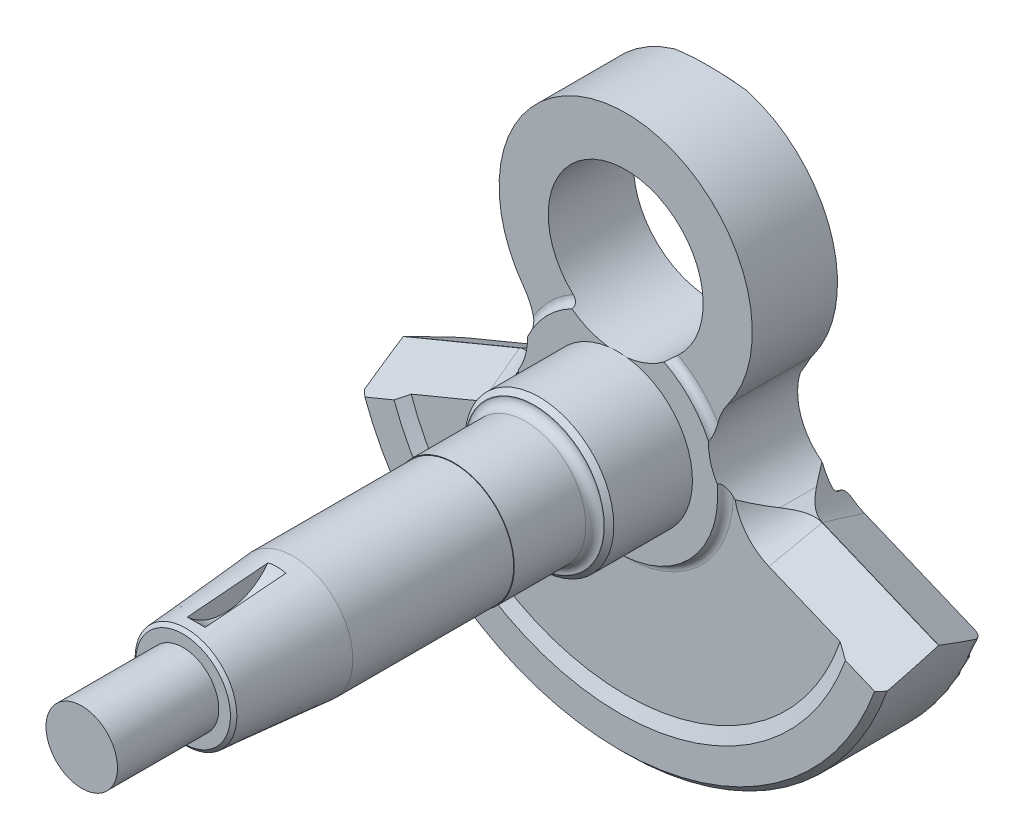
ISO-10303-21;
HEADER;
FILE_DESCRIPTION(('STEP AP214'),'2;1');
FILE_NAME('part.step','',(''),(''),'','','');
FILE_SCHEMA(('AUTOMOTIVE_DESIGN { 1 0 10303 214 1 1 1 1 }'));
ENDSEC;
DATA;
#1=APPLICATION_CONTEXT('core data for automotive mechanical design processes');
#2=APPLICATION_PROTOCOL_DEFINITION('international standard','automotive_design',2000,#1);
#3=PRODUCT_CONTEXT('',#1,'mechanical');
#4=PRODUCT('Part','Part','',(#3));
#5=PRODUCT_RELATED_PRODUCT_CATEGORY('part','',(#4));
#6=PRODUCT_DEFINITION_FORMATION('','',#4);
#7=PRODUCT_DEFINITION_CONTEXT('part definition',#1,'design');
#8=PRODUCT_DEFINITION('design','',#6,#7);
#9=PRODUCT_DEFINITION_SHAPE('','',#8);
#10=(LENGTH_UNIT() NAMED_UNIT(*) SI_UNIT(.MILLI.,.METRE.));
#11=(NAMED_UNIT(*) PLANE_ANGLE_UNIT() SI_UNIT($,.RADIAN.));
#12=(NAMED_UNIT(*) SI_UNIT($,.STERADIAN.) SOLID_ANGLE_UNIT());
#13=UNCERTAINTY_MEASURE_WITH_UNIT(LENGTH_MEASURE(1.E-05),#10,'distance_accuracy_value','');
#14=(GEOMETRIC_REPRESENTATION_CONTEXT(3) GLOBAL_UNCERTAINTY_ASSIGNED_CONTEXT((#13)) GLOBAL_UNIT_ASSIGNED_CONTEXT((#10,
#11,#12)) REPRESENTATION_CONTEXT('',''));
#15=CARTESIAN_POINT('',(0.,0.,0.));
#16=DIRECTION('',(0.,0.,1.));
#17=DIRECTION('',(1.,0.,0.));
#18=AXIS2_PLACEMENT_3D('',#15,#16,#17);
#19=CARTESIAN_POINT('',(0.,25.3,54.2695526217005));
#20=DIRECTION('',(0.,0.,-1.));
#21=DIRECTION('',(-1.,0.,0.));
#22=AXIS2_PLACEMENT_3D('',#19,#20,#21);
#23=CYLINDRICAL_SURFACE('',#22,13.);
#24=CARTESIAN_POINT('',(0.,25.3,1.9));
#25=DIRECTION('',(0.,0.,1.));
#26=DIRECTION('',(1.,0.,0.));
#27=AXIS2_PLACEMENT_3D('',#24,#25,#26);
#28=CIRCLE('',#27,13.);
#29=CARTESIAN_POINT('',(13.,25.3,1.9));
#30=VERTEX_POINT('',#29);
#31=EDGE_CURVE('E668',#30,#30,#28,.F.);
#32=ORIENTED_EDGE('',*,*,#31,.T.);
#33=EDGE_LOOP('',(#32));
#34=FACE_BOUND('',#33,.T.);
#35=CARTESIAN_POINT('',(0.,25.3,16.2));
#36=DIRECTION('',(0.,0.,1.));
#37=DIRECTION('',(1.,0.,0.));
#38=AXIS2_PLACEMENT_3D('',#35,#36,#37);
#39=CIRCLE('',#38,13.);
#40=CARTESIAN_POINT('',(8.81905857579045,15.7488636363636,16.2));
#41=VERTEX_POINT('',#40);
#42=CARTESIAN_POINT('',(-8.81905857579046,15.7488636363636,16.2));
#43=VERTEX_POINT('',#42);
#44=EDGE_CURVE('E691',#41,#43,#39,.T.);
#45=ORIENTED_EDGE('',*,*,#44,.T.);
#46=CARTESIAN_POINT('',(-7.73935658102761,14.854792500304,17.5002));
#47=CARTESIAN_POINT('',(-7.73934948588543,14.8547883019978,17.466030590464));
#48=CARTESIAN_POINT('',(-7.74055186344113,14.8556780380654,17.4318786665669));
#49=CARTESIAN_POINT('',(-7.74534093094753,14.8592286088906,17.3638457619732));
#50=CARTESIAN_POINT('',(-7.74892686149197,14.8618888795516,17.3299646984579));
#51=CARTESIAN_POINT('',(-7.76316440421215,14.872467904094,17.2293655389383));
#52=CARTESIAN_POINT('',(-7.77729644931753,14.882985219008,17.1633656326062));
#53=CARTESIAN_POINT('',(-7.81407341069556,14.9105449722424,17.0353392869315));
#54=CARTESIAN_POINT('',(-7.83671146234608,14.9275821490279,16.9733096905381));
#55=CARTESIAN_POINT('',(-7.88943501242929,14.9676281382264,16.8545336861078));
#56=CARTESIAN_POINT('',(-7.91952623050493,14.9906415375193,16.7977913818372));
#57=CARTESIAN_POINT('',(-7.9875561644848,15.0432520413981,16.6881503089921));
#58=CARTESIAN_POINT('',(-8.02580535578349,15.0731148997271,16.635572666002));
#59=CARTESIAN_POINT('',(-8.10775968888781,15.1379646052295,16.5384507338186));
#60=CARTESIAN_POINT('',(-8.15146670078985,15.1729532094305,16.493909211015));
#61=CARTESIAN_POINT('',(-8.24719915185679,15.2507293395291,16.4099228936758));
#62=CARTESIAN_POINT('',(-8.29961978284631,15.2939374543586,16.3713166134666));
#63=CARTESIAN_POINT('',(-8.40774534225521,15.3846180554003,16.3053334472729));
#64=CARTESIAN_POINT('',(-8.4634512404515,15.4320918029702,16.2779598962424));
#65=CARTESIAN_POINT('',(-8.57956639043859,15.5328486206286,16.2339726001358));
#66=CARTESIAN_POINT('',(-8.64006895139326,15.586305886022,16.2180001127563));
#67=CARTESIAN_POINT('',(-8.76118897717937,15.6954068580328,16.1998404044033));
#68=CARTESIAN_POINT('',(-8.82180644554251,15.751050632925,16.1976536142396));
#69=CARTESIAN_POINT('',(-8.94094955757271,15.8625200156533,16.2073987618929));
#70=CARTESIAN_POINT('',(-8.99948691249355,15.9183415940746,16.2192315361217));
#71=CARTESIAN_POINT('',(-9.11316607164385,16.0287282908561,16.256864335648));
#72=CARTESIAN_POINT('',(-9.16830874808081,16.0832937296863,16.2826607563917));
#73=CARTESIAN_POINT('',(-9.27126578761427,16.1868917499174,16.3463454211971));
#74=CARTESIAN_POINT('',(-9.31929332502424,16.2360613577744,16.383665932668));
#75=CARTESIAN_POINT('',(-9.4093649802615,16.329600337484,16.4697793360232));
#76=CARTESIAN_POINT('',(-9.45141080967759,16.3739710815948,16.5185689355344));
#77=CARTESIAN_POINT('',(-9.52672079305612,16.4544075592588,16.6239530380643));
#78=CARTESIAN_POINT('',(-9.56028264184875,16.4907464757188,16.6801267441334));
#79=CARTESIAN_POINT('',(-9.62004636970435,16.5560492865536,16.8001803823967));
#80=CARTESIAN_POINT('',(-9.64624729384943,16.585012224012,16.8640613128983));
#81=CARTESIAN_POINT('',(-9.69010765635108,16.6338089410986,16.9959629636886));
#82=CARTESIAN_POINT('',(-9.70796204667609,16.6538505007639,17.0638424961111));
#83=CARTESIAN_POINT('',(-9.73566711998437,16.6850578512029,17.2031265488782));
#84=CARTESIAN_POINT('',(-9.74552951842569,16.6962366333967,17.2745257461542));
#85=CARTESIAN_POINT('',(-9.75334766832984,16.7051053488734,17.372087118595));
#86=CARTESIAN_POINT('',(-9.75487940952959,16.7068440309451,17.3976782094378));
#87=CARTESIAN_POINT('',(-9.75691732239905,16.7091579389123,17.4489091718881));
#88=CARTESIAN_POINT('',(-9.75742526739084,16.7097351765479,17.4745488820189));
#89=CARTESIAN_POINT('',(-9.75742364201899,16.7097331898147,17.5002));
#90=B_SPLINE_CURVE_WITH_KNOTS('',3,(#46,#47,#48,#49,#50,#51,#52,#53,#54,#55,#56,#57,#58,#59,#60,
#61,#62,#63,#64,#65,#66,#67,#68,#69,#70,#71,#72,#73,#74,#75,#76,#77,#78,#79,#80,#81,#82,#83,#84,
#85,#86,#87,#88,#89),.UNSPECIFIED.,.F.,.F.,(4,2,2,2,2,2,2,2,2,2,2,2,2,2,2,2,2,2,2,2,2,4),(0.,
0.102440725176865,0.204848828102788,0.408700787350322,0.612388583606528,0.816233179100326,
1.02999130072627,1.24382286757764,1.47720792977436,1.7106622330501,1.95638863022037,
2.20212270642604,2.44612897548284,2.69007228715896,2.9235245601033,3.15690989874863,
3.38035757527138,3.60383422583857,3.82179216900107,4.03943002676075,4.11648228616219,
4.19340096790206),.UNSPECIFIED.);
#91=CARTESIAN_POINT('',(-7.73935656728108,14.8547924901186,17.5));
#92=VERTEX_POINT('',#91);
#93=EDGE_CURVE('E411',#92,#43,#90,.T.);
#94=ORIENTED_EDGE('',*,*,#93,.F.);
#95=CARTESIAN_POINT('',(0.,25.3,17.5));
#96=DIRECTION('',(0.,0.,1.));
#97=DIRECTION('',(1.,0.,0.));
#98=AXIS2_PLACEMENT_3D('',#95,#96,#97);
#99=CIRCLE('',#98,13.);
#100=CARTESIAN_POINT('',(-1.59342648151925,12.398023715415,17.5));
#101=VERTEX_POINT('',#100);
#102=EDGE_CURVE('E687',#101,#92,#99,.F.);
#103=ORIENTED_EDGE('',*,*,#102,.F.);
#104=CARTESIAN_POINT('',(1.59342648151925,12.398023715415,17.5));
#105=VERTEX_POINT('',#104);
#106=EDGE_CURVE('E692',#105,#101,#99,.F.);
#107=ORIENTED_EDGE('',*,*,#106,.F.);
#108=CARTESIAN_POINT('',(7.73935656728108,14.8547924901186,17.5));
#109=VERTEX_POINT('',#108);
#110=EDGE_CURVE('E688',#109,#105,#99,.F.);
#111=ORIENTED_EDGE('',*,*,#110,.F.);
#112=CARTESIAN_POINT('',(9.75742364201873,16.7097331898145,17.5002));
#113=CARTESIAN_POINT('',(9.75742665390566,16.7097379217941,17.4642124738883));
#114=CARTESIAN_POINT('',(9.75642432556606,16.708597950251,17.4282420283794));
#115=CARTESIAN_POINT('',(9.75241464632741,16.7040461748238,17.3565599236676));
#116=CARTESIAN_POINT('',(9.74940742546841,16.7006345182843,17.3208482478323));
#117=CARTESIAN_POINT('',(9.73740193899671,16.6870354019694,17.2145660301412));
#118=CARTESIAN_POINT('',(9.72541980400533,16.6734836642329,17.1447098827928));
#119=CARTESIAN_POINT('',(9.69374005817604,16.6379007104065,17.0090342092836));
#120=CARTESIAN_POINT('',(9.67403942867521,16.6158661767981,16.943216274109));
#121=CARTESIAN_POINT('',(9.6273457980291,16.5641301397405,16.8174480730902));
#122=CARTESIAN_POINT('',(9.60035389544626,16.5344297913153,16.7574969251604));
#123=CARTESIAN_POINT('',(9.53953546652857,16.4682796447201,16.6448261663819));
#124=CARTESIAN_POINT('',(9.50567767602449,16.4317990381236,16.5921415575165));
#125=CARTESIAN_POINT('',(9.43198963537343,16.3534667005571,16.4956903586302));
#126=CARTESIAN_POINT('',(9.39215822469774,16.3116139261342,16.4519255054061));
#127=CARTESIAN_POINT('',(9.30675344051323,16.2232067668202,16.3736954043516));
#128=CARTESIAN_POINT('',(9.26109378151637,16.176584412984,16.3394013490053));
#129=CARTESIAN_POINT('',(9.16572172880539,16.0807748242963,16.2818244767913));
#130=CARTESIAN_POINT('',(9.11600903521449,16.031587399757,16.2585424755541));
#131=CARTESIAN_POINT('',(9.01206874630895,15.9304727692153,16.2227506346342));
#132=CARTESIAN_POINT('',(8.95774636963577,15.8785086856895,16.2106209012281));
#133=CARTESIAN_POINT('',(8.84748220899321,15.7748864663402,16.1984956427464));
#134=CARTESIAN_POINT('',(8.79154001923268,15.7232284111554,16.198503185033));
#135=CARTESIAN_POINT('',(8.67693300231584,15.619241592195,16.2106735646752));
#136=CARTESIAN_POINT('',(8.61825878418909,15.5669869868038,16.2233825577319));
#137=CARTESIAN_POINT('',(8.50230364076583,15.4655312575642,16.2612741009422));
#138=CARTESIAN_POINT('',(8.44502308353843,15.4163309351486,16.2864599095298));
#139=CARTESIAN_POINT('',(8.33155666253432,15.320477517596,16.3497352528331));
#140=CARTESIAN_POINT('',(8.2754781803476,15.2739725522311,16.3882431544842));
#141=CARTESIAN_POINT('',(8.16846665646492,15.1865965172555,16.4770489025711));
#142=CARTESIAN_POINT('',(8.11753396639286,15.1457258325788,16.5273475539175));
#143=CARTESIAN_POINT('',(8.02344782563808,15.071224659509,16.637926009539));
#144=CARTESIAN_POINT('',(7.98020270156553,15.0375077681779,16.6980690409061));
#145=CARTESIAN_POINT('',(7.90276247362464,14.9777547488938,16.8273858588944));
#146=CARTESIAN_POINT('',(7.86856552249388,14.9517170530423,16.8965577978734));
#147=CARTESIAN_POINT('',(7.81344782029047,14.9100461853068,17.0363214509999));
#148=CARTESIAN_POINT('',(7.7917118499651,14.8937696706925,17.1064001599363));
#149=CARTESIAN_POINT('',(7.7590587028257,14.869399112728,17.250309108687));
#150=CARTESIAN_POINT('',(7.74811272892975,14.8612832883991,17.3241288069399));
#151=CARTESIAN_POINT('',(7.74171996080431,14.8565441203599,17.4153645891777));
#152=CARTESIAN_POINT('',(7.74083153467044,14.8558855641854,17.4323244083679));
#153=CARTESIAN_POINT('',(7.73964969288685,14.8550095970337,17.4662538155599));
#154=CARTESIAN_POINT('',(7.73935549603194,14.8547916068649,17.4832233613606));
#155=CARTESIAN_POINT('',(7.73935658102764,14.8547925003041,17.5002));
#156=B_SPLINE_CURVE_WITH_KNOTS('',3,(#112,#113,#114,#115,#116,#117,#118,#119,#120,#121,#122,
#123,#124,#125,#126,#127,#128,#129,#130,#131,#132,#133,#134,#135,#136,#137,#138,#139,#140,#141,
#142,#143,#144,#145,#146,#147,#148,#149,#150,#151,#152,#153,#154,#155),.UNSPECIFIED.,.F.,.F.,(4,
2,2,2,2,2,2,2,2,2,2,2,2,2,2,2,2,2,2,2,2,4),(0.,0.107895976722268,0.215784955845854,
0.431152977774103,0.646605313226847,0.862025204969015,1.07844898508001,1.29491486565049,
1.51506971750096,1.73524087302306,1.96266463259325,2.19014586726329,2.4278484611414,
2.6656131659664,2.91164820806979,3.15770005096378,3.4005855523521,3.64342142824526,
3.86768883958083,4.09135607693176,4.14233474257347,4.19324634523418),.UNSPECIFIED.);
#157=EDGE_CURVE('E422',#41,#109,#156,.T.);
#158=ORIENTED_EDGE('',*,*,#157,.F.);
#159=EDGE_LOOP('',(#45,#94,#103,#107,#111,#158));
#160=FACE_BOUND('',#159,.T.);
#161=ADVANCED_FACE('F43',(#34,#160),#23,.F.);
#162=CARTESIAN_POINT('',(0.,25.3,107.5));
#163=DIRECTION('',(0.,0.,-1.));
#164=DIRECTION('',(-1.,0.,0.));
#165=AXIS2_PLACEMENT_3D('',#162,#163,#164);
#166=CYLINDRICAL_SURFACE('',#165,21.25);
#167=CARTESIAN_POINT('',(0.,25.3,16.2));
#168=DIRECTION('',(0.,0.,1.));
#169=DIRECTION('',(1.,0.,0.));
#170=AXIS2_PLACEMENT_3D('',#167,#168,#169);
#171=CIRCLE('',#170,21.25);
#172=CARTESIAN_POINT('',(-17.1261817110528,12.72,16.2));
#173=VERTEX_POINT('',#172);
#174=CARTESIAN_POINT('',(17.1261817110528,12.72,16.2));
#175=VERTEX_POINT('',#174);
#176=EDGE_CURVE('E882',#173,#175,#171,.F.);
#177=ORIENTED_EDGE('',*,*,#176,.T.);
#178=DIRECTION('',(0.,0.,-1.));
#179=VECTOR('',#178,1.);
#180=CARTESIAN_POINT('',(17.1261817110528,12.72,107.5));
#181=LINE('',#180,#179);
#182=CARTESIAN_POINT('',(17.1261817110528,12.72,1.9));
#183=VERTEX_POINT('',#182);
#184=EDGE_CURVE('E876',#175,#183,#181,.T.);
#185=ORIENTED_EDGE('',*,*,#184,.T.);
#186=CARTESIAN_POINT('',(0.,25.3,1.9));
#187=DIRECTION('',(0.,0.,1.));
#188=DIRECTION('',(1.,0.,0.));
#189=AXIS2_PLACEMENT_3D('',#186,#187,#188);
#190=CIRCLE('',#189,21.25);
#191=CARTESIAN_POINT('',(6.16855564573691,45.6349802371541,1.89999999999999));
#192=VERTEX_POINT('',#191);
#193=EDGE_CURVE('E874',#192,#183,#190,.F.);
#194=ORIENTED_EDGE('',*,*,#193,.F.);
#195=CARTESIAN_POINT('',(6.16975556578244,45.6346162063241,1.89979999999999));
#196=CARTESIAN_POINT('',(5.91576184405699,45.7116817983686,1.94213962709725));
#197=CARTESIAN_POINT('',(5.6599547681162,45.7840975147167,1.98186750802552));
#198=CARTESIAN_POINT('',(5.14507803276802,45.9194457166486,2.05603681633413));
#199=CARTESIAN_POINT('',(4.88600827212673,45.98237790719,2.09047807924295));
#200=CARTESIAN_POINT('',(4.1045536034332,46.1566496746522,2.18576420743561));
#201=CARTESIAN_POINT('',(3.5778465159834,46.2534877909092,2.23858421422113));
#202=CARTESIAN_POINT('',(2.53160582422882,46.4050999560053,2.3211976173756));
#203=CARTESIAN_POINT('',(2.0122742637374,46.46095920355,2.35158521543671));
#204=CARTESIAN_POINT('',(0.970146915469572,46.5342665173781,2.39145236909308));
#205=CARTESIAN_POINT('',(0.447351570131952,46.5517193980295,2.40093454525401));
#206=CARTESIAN_POINT('',(-0.585852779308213,46.5480566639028,2.39894374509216));
#207=CARTESIAN_POINT('',(-1.09626616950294,46.5278314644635,2.38795455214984));
#208=CARTESIAN_POINT('',(-2.11352364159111,46.4507863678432,2.34605065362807));
#209=CARTESIAN_POINT('',(-2.62036741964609,46.3939633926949,2.31513427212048));
#210=CARTESIAN_POINT('',(-3.64110334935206,46.2422611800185,2.23246089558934));
#211=CARTESIAN_POINT('',(-4.15480260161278,46.1463726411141,2.18015102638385));
#212=CARTESIAN_POINT('',(-4.9171033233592,45.9749250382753,2.08639981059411));
#213=CARTESIAN_POINT('',(-5.16984996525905,45.9131669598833,2.05259815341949));
#214=CARTESIAN_POINT('',(-5.67222555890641,45.7806208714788,1.9799601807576));
#215=CARTESIAN_POINT('',(-5.92185459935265,45.7098331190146,1.94112400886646));
#216=CARTESIAN_POINT('',(-6.16975556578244,45.6346162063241,1.8998));
#217=B_SPLINE_CURVE_WITH_KNOTS('',3,(#195,#196,#197,#198,#199,#200,#201,#202,#203,#204,#205,
#206,#207,#208,#209,#210,#211,#212,#213,#214,#215,#216),.UNSPECIFIED.,.F.,.F.,(4,2,2,2,2,2,2,2,
2,2,4),(0.,0.806227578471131,1.61248023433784,3.22474250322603,4.79259423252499,
6.36024941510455,7.89132656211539,9.42253249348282,10.9960976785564,11.7830138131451,
12.5699075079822),.UNSPECIFIED.);
#218=CARTESIAN_POINT('',(-6.16855564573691,45.6349802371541,1.89999999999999));
#219=VERTEX_POINT('',#218);
#220=EDGE_CURVE('E861',#192,#219,#217,.T.);
#221=ORIENTED_EDGE('',*,*,#220,.T.);
#222=CARTESIAN_POINT('',(-17.1261817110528,12.72,1.9));
#223=VERTEX_POINT('',#222);
#224=EDGE_CURVE('E889',#223,#219,#190,.F.);
#225=ORIENTED_EDGE('',*,*,#224,.F.);
#226=DIRECTION('',(0.,0.,-1.));
#227=VECTOR('',#226,1.);
#228=CARTESIAN_POINT('',(-17.1261817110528,12.72,107.5));
#229=LINE('',#228,#227);
#230=EDGE_CURVE('E572',#173,#223,#229,.T.);
#231=ORIENTED_EDGE('',*,*,#230,.F.);
#232=EDGE_LOOP('',(#177,#185,#194,#221,#225,#231));
#233=FACE_BOUND('',#232,.T.);
#234=ADVANCED_FACE('F434',(#233),#166,.T.);
#235=CARTESIAN_POINT('',(0.,0.,16.2));
#236=DIRECTION('',(0.,0.,1.));
#237=DIRECTION('',(1.,0.,0.));
#238=AXIS2_PLACEMENT_3D('',#235,#236,#237);
#239=PLANE('',#238);
#240=CARTESIAN_POINT('',(25.1855613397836,6.8,16.2));
#241=DIRECTION('',(0.,0.,1.));
#242=DIRECTION('',(1.,0.,0.));
#243=AXIS2_PLACEMENT_3D('',#240,#241,#242);
#244=CIRCLE('',#243,10.);
#245=CARTESIAN_POINT('',(15.4931140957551,9.26098891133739,16.2));
#246=VERTEX_POINT('',#245);
#247=EDGE_CURVE('E884',#175,#246,#244,.T.);
#248=ORIENTED_EDGE('',*,*,#247,.F.);
#249=ORIENTED_EDGE('',*,*,#176,.F.);
#250=CARTESIAN_POINT('',(-25.1855613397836,6.8,16.2));
#251=DIRECTION('',(0.,0.,1.));
#252=DIRECTION('',(1.,0.,0.));
#253=AXIS2_PLACEMENT_3D('',#250,#251,#252);
#254=CIRCLE('',#253,10.);
#255=CARTESIAN_POINT('',(-15.4931140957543,9.26098891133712,16.1999999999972));
#256=VERTEX_POINT('',#255);
#257=EDGE_CURVE('E660',#256,#173,#254,.T.);
#258=ORIENTED_EDGE('',*,*,#257,.F.);
#259=CARTESIAN_POINT('',(0.,0.,16.2));
#260=DIRECTION('',(0.,0.,1.));
#261=DIRECTION('',(1.,0.,0.));
#262=AXIS2_PLACEMENT_3D('',#259,#260,#261);
#263=CIRCLE('',#262,18.05);
#264=EDGE_CURVE('E336',#256,#43,#263,.F.);
#265=ORIENTED_EDGE('',*,*,#264,.T.);
#266=ORIENTED_EDGE('',*,*,#44,.F.);
#267=EDGE_CURVE('E344',#41,#246,#263,.F.);
#268=ORIENTED_EDGE('',*,*,#267,.T.);
#269=EDGE_LOOP('',(#248,#249,#258,#265,#266,#268));
#270=FACE_BOUND('',#269,.T.);
#271=ADVANCED_FACE('F886',(#270),#239,.T.);
#272=CARTESIAN_POINT('',(0.,0.,17.5));
#273=DIRECTION('',(0.,0.,1.));
#274=DIRECTION('',(1.,0.,0.));
#275=AXIS2_PLACEMENT_3D('',#272,#273,#274);
#276=TOROIDAL_SURFACE('',#275,18.05,1.3);
#277=ORIENTED_EDGE('',*,*,#264,.F.);
#278=CARTESIAN_POINT('',(-16.0327929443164,10.828254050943,17.5900983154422));
#279=CARTESIAN_POINT('',(-16.0338413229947,10.8306338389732,17.5584462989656));
#280=CARTESIAN_POINT('',(-16.0343357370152,10.8317572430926,17.5266969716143));
#281=CARTESIAN_POINT('',(-16.0342181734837,10.8314912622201,17.4632166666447));
#282=CARTESIAN_POINT('',(-16.0336063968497,10.8301023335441,17.431485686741));
#283=CARTESIAN_POINT('',(-16.0301239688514,10.8221894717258,17.3368834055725));
#284=CARTESIAN_POINT('',(-16.0256148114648,10.8119390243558,17.2743379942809));
#285=CARTESIAN_POINT('',(-16.0125196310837,10.7819050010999,17.1520866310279));
#286=CARTESIAN_POINT('',(-16.0039342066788,10.7621228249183,17.0923802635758));
#287=CARTESIAN_POINT('',(-15.9832377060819,10.7138123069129,16.9772642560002));
#288=CARTESIAN_POINT('',(-15.971125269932,10.6852805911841,16.9218562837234));
#289=CARTESIAN_POINT('',(-15.9436672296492,10.6195151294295,16.8149041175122));
#290=CARTESIAN_POINT('',(-15.9282333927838,10.5820400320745,16.7635319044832));
#291=CARTESIAN_POINT('',(-15.8952150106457,10.5001908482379,16.6674272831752));
#292=CARTESIAN_POINT('',(-15.877629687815,10.4558142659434,16.622697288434));
#293=CARTESIAN_POINT('',(-15.8389598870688,10.3558726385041,16.5353954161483));
#294=CARTESIAN_POINT('',(-15.8177075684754,10.2996050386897,16.4937049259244));
#295=CARTESIAN_POINT('',(-15.7745234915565,10.1817632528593,16.4191580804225));
#296=CARTESIAN_POINT('',(-15.752591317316,10.1201857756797,16.3863072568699));
#297=CARTESIAN_POINT('',(-15.698243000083,9.96238351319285,16.3152533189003));
#298=CARTESIAN_POINT('',(-15.6658932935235,9.86382113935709,16.2821624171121));
#299=CARTESIAN_POINT('',(-15.6032562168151,9.66193799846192,16.2328728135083));
#300=CARTESIAN_POINT('',(-15.5729731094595,9.55860809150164,16.2167080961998));
#301=CARTESIAN_POINT('',(-15.5053996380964,9.31312929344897,16.196114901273));
#302=CARTESIAN_POINT('',(-15.4693964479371,9.17012273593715,16.1978229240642));
#303=CARTESIAN_POINT('',(-15.4041322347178,8.88451852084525,16.2238316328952));
#304=CARTESIAN_POINT('',(-15.3748857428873,8.74192238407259,16.2481804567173));
#305=CARTESIAN_POINT('',(-15.3358644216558,8.5288454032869,16.2998596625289));
#306=CARTESIAN_POINT('',(-15.3235330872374,8.45698839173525,16.3199934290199));
#307=CARTESIAN_POINT('',(-15.3006610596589,8.31457487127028,16.3652433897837));
#308=CARTESIAN_POINT('',(-15.2901198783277,8.24401801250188,16.3903582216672));
#309=CARTESIAN_POINT('',(-15.2708048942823,8.10481063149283,16.4454206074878));
#310=CARTESIAN_POINT('',(-15.2620260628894,8.03615518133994,16.4753539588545));
#311=CARTESIAN_POINT('',(-15.2461265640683,7.90102702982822,16.5402489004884));
#312=CARTESIAN_POINT('',(-15.239006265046,7.83455481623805,16.5752116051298));
#313=CARTESIAN_POINT('',(-15.227201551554,7.71337791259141,16.6454546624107));
#314=CARTESIAN_POINT('',(-15.2223179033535,7.65829796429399,16.6800519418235));
#315=CARTESIAN_POINT('',(-15.2136707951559,7.55118430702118,16.7537487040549));
#316=CARTESIAN_POINT('',(-15.2099061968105,7.49914754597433,16.7928435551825));
#317=CARTESIAN_POINT('',(-15.2033843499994,7.39890357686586,16.8766746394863));
#318=CARTESIAN_POINT('',(-15.2006365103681,7.3507352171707,16.9214586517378));
#319=CARTESIAN_POINT('',(-15.1961008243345,7.26115914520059,17.017430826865));
#320=CARTESIAN_POINT('',(-15.1943103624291,7.21973323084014,17.0686010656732));
#321=CARTESIAN_POINT('',(-15.1921341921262,7.16311757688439,17.1550897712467));
#322=CARTESIAN_POINT('',(-15.1914746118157,7.14424008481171,17.1879643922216));
#323=CARTESIAN_POINT('',(-15.190398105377,7.11141680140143,17.2561296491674));
#324=CARTESIAN_POINT('',(-15.1899810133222,7.09746764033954,17.2914186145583));
#325=CARTESIAN_POINT('',(-15.1893572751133,7.07573125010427,17.3643808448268));
#326=CARTESIAN_POINT('',(-15.189153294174,7.06802232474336,17.4020781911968));
#327=CARTESIAN_POINT('',(-15.188945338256,7.0601721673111,17.4782090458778));
#328=CARTESIAN_POINT('',(-15.1889408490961,7.06001147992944,17.5166404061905));
#329=CARTESIAN_POINT('',(-15.1890653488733,7.06469726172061,17.5665194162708));
#330=CARTESIAN_POINT('',(-15.1891046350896,7.06617506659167,17.5783416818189));
#331=CARTESIAN_POINT('',(-15.1891535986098,7.06801543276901,17.5900983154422));
#332=B_SPLINE_CURVE_WITH_KNOTS('',3,(#278,#279,#280,#281,#282,#283,#284,#285,#286,#287,#288,
#289,#290,#291,#292,#293,#294,#295,#296,#297,#298,#299,#300,#301,#302,#303,#304,#305,#306,#307,
#308,#309,#310,#311,#312,#313,#314,#315,#316,#317,#318,#319,#320,#321,#322,#323,#324,#325,#326,
#327,#328,#329,#330,#331),.UNSPECIFIED.,.F.,.F.,(4,2,2,2,2,2,2,2,2,2,2,2,2,2,2,2,2,2,2,2,2,2,2,
2,2,2,4),(0.,0.095215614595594,0.190413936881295,0.380024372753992,0.569606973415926,
0.759262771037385,0.954770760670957,1.15034961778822,1.36906684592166,1.58792062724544,
1.91275935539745,2.23824905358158,2.67834591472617,3.11938063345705,3.34613068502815,
3.57281880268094,3.79885059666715,4.02493255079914,4.22042411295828,4.41571612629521,
4.6127726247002,4.80928798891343,4.92272532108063,5.03608494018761,5.15084588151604,
5.26531101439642,5.30102889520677),.UNSPECIFIED.);
#333=CARTESIAN_POINT('',(-15.1889680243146,7.06100207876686,17.5));
#334=VERTEX_POINT('',#333);
#335=EDGE_CURVE('E653',#256,#334,#332,.T.);
#336=ORIENTED_EDGE('',*,*,#335,.T.);
#337=CARTESIAN_POINT('',(0.,0.,17.5));
#338=DIRECTION('',(0.,0.,1.));
#339=DIRECTION('',(1.,0.,0.));
#340=AXIS2_PLACEMENT_3D('',#337,#338,#339);
#341=CIRCLE('',#340,16.75);
#342=EDGE_CURVE('E334',#92,#334,#341,.T.);
#343=ORIENTED_EDGE('',*,*,#342,.F.);
#344=ORIENTED_EDGE('',*,*,#93,.T.);
#345=EDGE_LOOP('',(#277,#336,#343,#344));
#346=FACE_BOUND('',#345,.T.);
#347=ADVANCED_FACE('F927',(#346),#276,.F.);
#348=CARTESIAN_POINT('',(15.1889680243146,7.06100207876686,17.5));
#349=VERTEX_POINT('',#348);
#350=EDGE_CURVE('E341',#349,#109,#341,.T.);
#351=ORIENTED_EDGE('',*,*,#350,.F.);
#352=CARTESIAN_POINT('',(15.1891535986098,7.068015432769,17.5900983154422));
#353=CARTESIAN_POINT('',(15.1890841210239,7.06541499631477,17.5734239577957));
#354=CARTESIAN_POINT('',(15.1890342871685,7.06352862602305,17.5566436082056));
#355=CARTESIAN_POINT('',(15.1889734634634,7.06121459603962,17.5229887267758));
#356=CARTESIAN_POINT('',(15.1889624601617,7.06078643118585,17.5061142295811));
#357=CARTESIAN_POINT('',(15.1889868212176,7.06172698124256,17.455835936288));
#358=CARTESIAN_POINT('',(15.1890782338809,7.06526941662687,17.4224495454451));
#359=CARTESIAN_POINT('',(15.1894185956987,7.07778824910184,17.3567914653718));
#360=CARTESIAN_POINT('',(15.189667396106,7.08675951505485,17.3245187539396));
#361=CARTESIAN_POINT('',(15.1903390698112,7.1092879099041,17.2615824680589));
#362=CARTESIAN_POINT('',(15.1907623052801,7.12285456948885,17.2309223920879));
#363=CARTESIAN_POINT('',(15.1921570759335,7.16404402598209,17.1513903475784));
#364=CARTESIAN_POINT('',(15.193305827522,7.19496458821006,17.104242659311));
#365=CARTESIAN_POINT('',(15.1962482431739,7.26347351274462,17.0150703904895));
#366=CARTESIAN_POINT('',(15.1980441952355,7.30108528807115,16.9730647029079));
#367=CARTESIAN_POINT('',(15.2022179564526,7.37814397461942,16.8961254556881));
#368=CARTESIAN_POINT('',(15.2045509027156,7.41731718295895,16.8609107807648));
#369=CARTESIAN_POINT('',(15.2098998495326,7.49845088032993,16.793877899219));
#370=CARTESIAN_POINT('',(15.2129164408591,7.54041375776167,16.7620626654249));
#371=CARTESIAN_POINT('',(15.2196789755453,7.62647187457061,16.7014014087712));
#372=CARTESIAN_POINT('',(15.2234261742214,7.67057068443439,16.6725606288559));
#373=CARTESIAN_POINT('',(15.2316826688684,7.76038340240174,16.6176226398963));
#374=CARTESIAN_POINT('',(15.2361922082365,7.80609782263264,16.5915263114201));
#375=CARTESIAN_POINT('',(15.2490857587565,7.92791937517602,16.5263068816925));
#376=CARTESIAN_POINT('',(15.2581249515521,8.00509170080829,16.4892893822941));
#377=CARTESIAN_POINT('',(15.2784217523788,8.16192911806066,16.4216299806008));
#378=CARTESIAN_POINT('',(15.2896806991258,8.2415956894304,16.3909919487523));
#379=CARTESIAN_POINT('',(15.3144953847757,8.40271413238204,16.336125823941));
#380=CARTESIAN_POINT('',(15.3280497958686,8.48416494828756,16.3118940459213));
#381=CARTESIAN_POINT('',(15.3575097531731,8.64834184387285,16.2700983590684));
#382=CARTESIAN_POINT('',(15.3734155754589,8.73106807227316,16.2525352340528));
#383=CARTESIAN_POINT('',(15.4174839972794,8.94535656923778,16.2164742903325));
#384=CARTESIAN_POINT('',(15.4474175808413,9.0775119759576,16.2033023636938));
#385=CARTESIAN_POINT('',(15.5127892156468,9.340822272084,16.1977920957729));
#386=CARTESIAN_POINT('',(15.5482158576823,9.47197865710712,16.2054111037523));
#387=CARTESIAN_POINT('',(15.6133858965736,9.69538338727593,16.2400080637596));
#388=CARTESIAN_POINT('',(15.6421660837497,9.78877520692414,16.2613541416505));
#389=CARTESIAN_POINT('',(15.7009747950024,9.97043811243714,16.3190362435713));
#390=CARTESIAN_POINT('',(15.7310016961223,10.0587155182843,16.355353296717));
#391=CARTESIAN_POINT('',(15.7848709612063,10.2106046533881,16.4355968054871));
#392=CARTESIAN_POINT('',(15.8087849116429,10.2756824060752,16.4766876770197));
#393=CARTESIAN_POINT('',(15.8551524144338,10.3982992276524,16.5696569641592));
#394=CARTESIAN_POINT('',(15.8776063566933,10.45584031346,16.6215324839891));
#395=CARTESIAN_POINT('',(15.9197646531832,10.5614199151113,16.7360892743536));
#396=CARTESIAN_POINT('',(15.9394449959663,10.6093767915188,16.7988555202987));
#397=CARTESIAN_POINT('',(15.9742009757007,10.692671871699,16.9334574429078));
#398=CARTESIAN_POINT('',(15.9892792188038,10.7280172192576,17.0052879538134));
#399=CARTESIAN_POINT('',(16.0116466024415,10.779946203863,17.1446114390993));
#400=CARTESIAN_POINT('',(16.0197427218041,10.7984936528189,17.2112489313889));
#401=CARTESIAN_POINT('',(16.0308473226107,10.8238553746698,17.3470587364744));
#402=CARTESIAN_POINT('',(16.0338680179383,10.8306978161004,17.4162245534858));
#403=CARTESIAN_POINT('',(16.0343370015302,10.8317600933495,17.5028420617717));
#404=CARTESIAN_POINT('',(16.0342622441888,10.8315907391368,17.5203319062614));
#405=CARTESIAN_POINT('',(16.0337775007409,10.8304905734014,17.5552558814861));
#406=CARTESIAN_POINT('',(16.0333680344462,10.8295609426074,17.5726900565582));
#407=CARTESIAN_POINT('',(16.0327929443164,10.8282540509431,17.5900983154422));
#408=B_SPLINE_CURVE_WITH_KNOTS('',3,(#352,#353,#354,#355,#356,#357,#358,#359,#360,#361,#362,
#363,#364,#365,#366,#367,#368,#369,#370,#371,#372,#373,#374,#375,#376,#377,#378,#379,#380,#381,
#382,#383,#384,#385,#386,#387,#388,#389,#390,#391,#392,#393,#394,#395,#396,#397,#398,#399,#400,
#401,#402,#403,#404,#405,#406,#407),.UNSPECIFIED.,.F.,.F.,(4,2,2,2,2,2,2,2,2,2,2,2,2,2,2,2,2,2,
2,2,2,2,2,2,2,2,2,4),(0.,0.0506010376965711,0.101184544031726,0.201369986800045,
0.301460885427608,0.40176065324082,0.56996908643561,0.738778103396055,0.896727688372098,
1.05481428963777,1.21317494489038,1.37158625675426,1.62943526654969,1.88744026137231,
2.14529651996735,2.40318307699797,2.81010923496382,3.21620124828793,3.51525696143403,
3.81393487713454,4.05477213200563,4.29554480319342,4.53828833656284,4.78089414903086,
4.98870441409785,5.19601386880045,5.24847460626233,5.30085402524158),.UNSPECIFIED.);
#409=EDGE_CURVE('E519',#349,#246,#408,.T.);
#410=ORIENTED_EDGE('',*,*,#409,.T.);
#411=ORIENTED_EDGE('',*,*,#267,.F.);
#412=ORIENTED_EDGE('',*,*,#157,.T.);
#413=EDGE_LOOP('',(#351,#410,#411,#412));
#414=FACE_BOUND('',#413,.T.);
#415=ADVANCED_FACE('F732',(#414),#276,.F.);
#416=CARTESIAN_POINT('',(0.,25.3,2.5));
#417=DIRECTION('',(0.,0.,-1.));
#418=DIRECTION('',(-1.,0.,0.));
#419=AXIS2_PLACEMENT_3D('',#416,#417,#418);
#420=PLANE('',#419);
#421=CARTESIAN_POINT('',(-27.6855613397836,1.43489729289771,2.5));
#422=DIRECTION('',(0.,0.,-1.));
#423=DIRECTION('',(-1.,0.,0.));
#424=AXIS2_PLACEMENT_3D('',#421,#422,#423);
#425=CIRCLE('',#424,8.8342308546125);
#426=CARTESIAN_POINT('',(-19.2742534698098,-1.26575720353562,2.5));
#427=VERTEX_POINT('',#426);
#428=CARTESIAN_POINT('',(-20.8474244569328,-4.15826985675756,2.5));
#429=VERTEX_POINT('',#428);
#430=EDGE_CURVE('E623',#427,#429,#425,.T.);
#431=ORIENTED_EDGE('',*,*,#430,.F.);
#432=CARTESIAN_POINT('',(-25.1855613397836,6.8,2.5));
#433=DIRECTION('',(0.,0.,-1.));
#434=DIRECTION('',(-1.,0.,0.));
#435=AXIS2_PLACEMENT_3D('',#432,#433,#434);
#436=CIRCLE('',#435,10.);
#437=CARTESIAN_POINT('',(-15.6620674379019,9.85009244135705,2.5));
#438=VERTEX_POINT('',#437);
#439=EDGE_CURVE('E903',#438,#427,#436,.T.);
#440=ORIENTED_EDGE('',*,*,#439,.F.);
#441=CARTESIAN_POINT('',(0.,25.3,2.5));
#442=DIRECTION('',(0.,0.,1.));
#443=DIRECTION('',(-1.,0.,0.));
#444=AXIS2_PLACEMENT_3D('',#441,#442,#443);
#445=CIRCLE('',#444,22.);
#446=CARTESIAN_POINT('',(-7.54083698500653,4.63273657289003,2.5));
#447=VERTEX_POINT('',#446);
#448=EDGE_CURVE('E682',#438,#447,#445,.T.);
#449=ORIENTED_EDGE('',*,*,#448,.T.);
#450=CARTESIAN_POINT('',(-5.82701039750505,9.3298418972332,2.5));
#451=DIRECTION('',(0.,0.,-1.));
#452=DIRECTION('',(-1.,0.,0.));
#453=AXIS2_PLACEMENT_3D('',#450,#451,#452);
#454=CIRCLE('',#453,5.);
#455=CARTESIAN_POINT('',(-3.17836930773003,5.08900467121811,2.5));
#456=VERTEX_POINT('',#455);
#457=EDGE_CURVE('E749',#447,#456,#454,.F.);
#458=ORIENTED_EDGE('',*,*,#457,.T.);
#459=CARTESIAN_POINT('',(0.,0.,2.5));
#460=DIRECTION('',(0.,0.,-1.));
#461=DIRECTION('',(1.,0.,0.));
#462=AXIS2_PLACEMENT_3D('',#459,#460,#461);
#463=CIRCLE('',#462,6.);
#464=CARTESIAN_POINT('',(3.17836930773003,5.08900467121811,2.5));
#465=VERTEX_POINT('',#464);
#466=EDGE_CURVE('E684',#456,#465,#463,.T.);
#467=ORIENTED_EDGE('',*,*,#466,.T.);
#468=CARTESIAN_POINT('',(5.82701039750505,9.3298418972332,2.5));
#469=DIRECTION('',(0.,0.,-1.));
#470=DIRECTION('',(-1.,0.,0.));
#471=AXIS2_PLACEMENT_3D('',#468,#469,#470);
#472=CIRCLE('',#471,5.);
#473=CARTESIAN_POINT('',(7.54083698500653,4.63273657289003,2.5));
#474=VERTEX_POINT('',#473);
#475=EDGE_CURVE('E750',#465,#474,#472,.F.);
#476=ORIENTED_EDGE('',*,*,#475,.T.);
#477=CARTESIAN_POINT('',(0.,25.3,2.5));
#478=DIRECTION('',(0.,0.,1.));
#479=DIRECTION('',(-1.,0.,0.));
#480=AXIS2_PLACEMENT_3D('',#477,#478,#479);
#481=CIRCLE('',#480,22.);
#482=CARTESIAN_POINT('',(15.313741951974,9.50476947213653,2.5));
#483=VERTEX_POINT('',#482);
#484=EDGE_CURVE('E679',#474,#483,#481,.T.);
#485=ORIENTED_EDGE('',*,*,#484,.T.);
#486=CARTESIAN_POINT('',(25.3966265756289,6.74198856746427,2.5));
#487=DIRECTION('',(0.,0.,-1.));
#488=DIRECTION('',(-1.,0.,0.));
#489=AXIS2_PLACEMENT_3D('',#486,#487,#488);
#490=CIRCLE('',#489,10.4545454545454);
#491=CARTESIAN_POINT('',(19.5017689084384,-1.89213986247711,2.5));
#492=VERTEX_POINT('',#491);
#493=EDGE_CURVE('E454',#483,#492,#490,.F.);
#494=ORIENTED_EDGE('',*,*,#493,.T.);
#495=CARTESIAN_POINT('',(27.6855613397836,1.43489729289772,2.5));
#496=DIRECTION('',(0.,0.,-1.));
#497=DIRECTION('',(-1.,0.,0.));
#498=AXIS2_PLACEMENT_3D('',#495,#496,#497);
#499=CIRCLE('',#498,8.8342308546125);
#500=CARTESIAN_POINT('',(20.8474244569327,-4.15826985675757,2.5));
#501=VERTEX_POINT('',#500);
#502=EDGE_CURVE('E565',#501,#492,#499,.T.);
#503=ORIENTED_EDGE('',*,*,#502,.F.);
#504=CARTESIAN_POINT('',(0.,25.3,2.5));
#505=DIRECTION('',(0.,0.,-1.));
#506=DIRECTION('',(-1.,0.,0.));
#507=AXIS2_PLACEMENT_3D('',#504,#505,#506);
#508=CIRCLE('',#507,36.0888454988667);
#509=EDGE_CURVE('E771',#501,#429,#508,.T.);
#510=ORIENTED_EDGE('',*,*,#509,.T.);
#511=EDGE_LOOP('',(#431,#440,#449,#458,#467,#476,#485,#494,#503,#510));
#512=FACE_BOUND('',#511,.T.);
#513=CARTESIAN_POINT('',(0.,0.,2.5));
#514=DIRECTION('',(0.,0.,1.));
#515=DIRECTION('',(1.,0.,0.));
#516=AXIS2_PLACEMENT_3D('',#513,#514,#515);
#517=CIRCLE('',#516,3.5);
#518=CARTESIAN_POINT('',(3.5,0.,2.5));
#519=VERTEX_POINT('',#518);
#520=EDGE_CURVE('E671',#519,#519,#517,.T.);
#521=ORIENTED_EDGE('',*,*,#520,.T.);
#522=EDGE_LOOP('',(#521));
#523=FACE_BOUND('',#522,.T.);
#524=ADVANCED_FACE('F758',(#512,#523),#420,.T.);
#525=CARTESIAN_POINT('',(0.,8.5,90.5));
#526=DIRECTION('',(0.,0.,-1.));
#527=DIRECTION('',(-1.,0.,0.));
#528=AXIS2_PLACEMENT_3D('',#525,#526,#527);
#529=PLANE('',#528);
#530=CARTESIAN_POINT('',(0.,0.,90.5));
#531=DIRECTION('',(0.,0.,-1.));
#532=DIRECTION('',(-1.,0.,0.));
#533=AXIS2_PLACEMENT_3D('',#530,#531,#532);
#534=CIRCLE('',#533,7.95409672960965);
#535=CARTESIAN_POINT('',(-7.95409672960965,0.,90.5));
#536=VERTEX_POINT('',#535);
#537=EDGE_CURVE('E363',#536,#536,#534,.F.);
#538=ORIENTED_EDGE('',*,*,#537,.T.);
#539=EDGE_LOOP('',(#538));
#540=FACE_BOUND('',#539,.T.);
#541=CARTESIAN_POINT('',(0.,0.,90.5));
#542=DIRECTION('',(0.,0.,-1.));
#543=DIRECTION('',(-1.,0.,0.));
#544=AXIS2_PLACEMENT_3D('',#541,#542,#543);
#545=CIRCLE('',#544,6.);
#546=CARTESIAN_POINT('',(-6.,0.,90.5));
#547=VERTEX_POINT('',#546);
#548=EDGE_CURVE('E347',#547,#547,#545,.F.);
#549=ORIENTED_EDGE('',*,*,#548,.F.);
#550=EDGE_LOOP('',(#549));
#551=FACE_BOUND('',#550,.T.);
#552=ADVANCED_FACE('F1259',(#540,#551),#529,.F.);
#553=CARTESIAN_POINT('',(0.,0.,45.));
#554=DIRECTION('',(0.,0.,1.));
#555=DIRECTION('',(1.,0.,0.));
#556=AXIS2_PLACEMENT_3D('',#553,#554,#555);
#557=PLANE('',#556);
#558=CARTESIAN_POINT('',(0.,0.,45.));
#559=DIRECTION('',(0.,0.,1.));
#560=DIRECTION('',(1.,0.,0.));
#561=AXIS2_PLACEMENT_3D('',#558,#559,#560);
#562=CIRCLE('',#561,10.1);
#563=CARTESIAN_POINT('',(10.1,0.,45.));
#564=VERTEX_POINT('',#563);
#565=EDGE_CURVE('E706',#564,#564,#562,.T.);
#566=ORIENTED_EDGE('',*,*,#565,.T.);
#567=EDGE_LOOP('',(#566));
#568=FACE_BOUND('',#567,.T.);
#569=CARTESIAN_POINT('',(0.,0.,45.));
#570=DIRECTION('',(0.,0.,1.));
#571=DIRECTION('',(1.,0.,0.));
#572=AXIS2_PLACEMENT_3D('',#569,#570,#571);
#573=CIRCLE('',#572,10.);
#574=CARTESIAN_POINT('',(10.,0.,45.));
#575=VERTEX_POINT('',#574);
#576=EDGE_CURVE('E702',#575,#575,#573,.T.);
#577=ORIENTED_EDGE('',*,*,#576,.F.);
#578=EDGE_LOOP('',(#577));
#579=FACE_BOUND('',#578,.T.);
#580=ADVANCED_FACE('F1437',(#568,#579),#557,.T.);
#581=CARTESIAN_POINT('',(0.,0.,31.5));
#582=DIRECTION('',(0.,0.,1.));
#583=DIRECTION('',(1.,0.,0.));
#584=AXIS2_PLACEMENT_3D('',#581,#582,#583);
#585=PLANE('',#584);
#586=CARTESIAN_POINT('',(0.,0.,31.5));
#587=DIRECTION('',(0.,0.,1.));
#588=DIRECTION('',(1.,0.,0.));
#589=AXIS2_PLACEMENT_3D('',#586,#587,#588);
#590=CIRCLE('',#589,11.7);
#591=CARTESIAN_POINT('',(11.7,0.,31.5));
#592=VERTEX_POINT('',#591);
#593=EDGE_CURVE('E357',#592,#592,#590,.T.);
#594=ORIENTED_EDGE('',*,*,#593,.T.);
#595=EDGE_LOOP('',(#594));
#596=FACE_BOUND('',#595,.T.);
#597=CARTESIAN_POINT('',(0.,0.,31.5));
#598=DIRECTION('',(0.,0.,1.));
#599=DIRECTION('',(1.,0.,0.));
#600=AXIS2_PLACEMENT_3D('',#597,#598,#599);
#601=CIRCLE('',#600,11.6);
#602=CARTESIAN_POINT('',(11.6,0.,31.5));
#603=VERTEX_POINT('',#602);
#604=EDGE_CURVE('E354',#603,#603,#601,.F.);
#605=ORIENTED_EDGE('',*,*,#604,.T.);
#606=EDGE_LOOP('',(#605));
#607=FACE_BOUND('',#606,.T.);
#608=ADVANCED_FACE('F1236',(#596,#607),#585,.T.);
#609=CARTESIAN_POINT('',(0.,0.,17.5));
#610=DIRECTION('',(0.,0.,1.));
#611=DIRECTION('',(1.,0.,0.));
#612=AXIS2_PLACEMENT_3D('',#609,#610,#611);
#613=PLANE('',#612);
#614=CARTESIAN_POINT('',(-25.1855613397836,6.8,17.5));
#615=DIRECTION('',(0.,0.,1.));
#616=DIRECTION('',(1.,0.,0.));
#617=AXIS2_PLACEMENT_3D('',#614,#615,#616);
#618=CIRCLE('',#617,10.);
#619=CARTESIAN_POINT('',(-16.6787639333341,1.54315704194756,17.5));
#620=VERTEX_POINT('',#619);
#621=EDGE_CURVE('E661',#620,#334,#618,.T.);
#622=ORIENTED_EDGE('',*,*,#621,.F.);
#623=CARTESIAN_POINT('',(16.6787639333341,1.54315704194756,17.5));
#624=VERTEX_POINT('',#623);
#625=EDGE_CURVE('E339',#620,#624,#341,.T.);
#626=ORIENTED_EDGE('',*,*,#625,.T.);
#627=CARTESIAN_POINT('',(25.1855613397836,6.8,17.5));
#628=DIRECTION('',(0.,0.,1.));
#629=DIRECTION('',(1.,0.,0.));
#630=AXIS2_PLACEMENT_3D('',#627,#628,#629);
#631=CIRCLE('',#630,10.);
#632=EDGE_CURVE('E890',#349,#624,#631,.T.);
#633=ORIENTED_EDGE('',*,*,#632,.F.);
#634=ORIENTED_EDGE('',*,*,#350,.T.);
#635=ORIENTED_EDGE('',*,*,#110,.T.);
#636=CARTESIAN_POINT('',(0.,0.,17.5));
#637=DIRECTION('',(0.,0.,1.));
#638=DIRECTION('',(1.,0.,0.));
#639=AXIS2_PLACEMENT_3D('',#636,#637,#638);
#640=CIRCLE('',#639,12.5);
#641=EDGE_CURVE('E710',#101,#105,#640,.T.);
#642=ORIENTED_EDGE('',*,*,#641,.F.);
#643=ORIENTED_EDGE('',*,*,#102,.T.);
#644=ORIENTED_EDGE('',*,*,#342,.T.);
#645=EDGE_LOOP('',(#622,#626,#633,#634,#635,#642,#643,#644));
#646=FACE_BOUND('',#645,.T.);
#647=ADVANCED_FACE('F720',(#646),#613,.T.);
#648=DIRECTION('',(0.923879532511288,-0.382683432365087,0.));
#649=VECTOR('',#648,1.);
#650=CARTESIAN_POINT('',(0.91338328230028,2.20510230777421,16.2));
#651=LINE('',#650,#649);
#652=CARTESIAN_POINT('',(24.0371752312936,-7.37308593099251,16.2));
#653=VERTEX_POINT('',#652);
#654=CARTESIAN_POINT('',(35.9977709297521,-12.3273268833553,16.2));
#655=VERTEX_POINT('',#654);
#656=EDGE_CURVE('E314',#653,#655,#651,.T.);
#657=ORIENTED_EDGE('',*,*,#656,.F.);
#658=CARTESIAN_POINT('',(27.6855613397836,1.43489729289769,16.2));
#659=DIRECTION('',(0.,0.,1.));
#660=DIRECTION('',(1.,0.,0.));
#661=AXIS2_PLACEMENT_3D('',#658,#659,#660);
#662=CIRCLE('',#661,9.533692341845);
#663=CARTESIAN_POINT('',(18.3500860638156,-0.49906005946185,16.2));
#664=VERTEX_POINT('',#663);
#665=EDGE_CURVE('E932',#664,#653,#662,.T.);
#666=ORIENTED_EDGE('',*,*,#665,.F.);
#667=CARTESIAN_POINT('',(18.0488381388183,-0.204797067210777,16.2));
#668=VERTEX_POINT('',#667);
#669=EDGE_CURVE('E888',#668,#664,#244,.T.);
#670=ORIENTED_EDGE('',*,*,#669,.F.);
#671=CARTESIAN_POINT('',(-18.0488381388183,-0.204797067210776,16.2));
#672=VERTEX_POINT('',#671);
#673=EDGE_CURVE('E348',#668,#672,#263,.F.);
#674=ORIENTED_EDGE('',*,*,#673,.T.);
#675=CARTESIAN_POINT('',(-18.3500860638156,-0.499060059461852,16.2));
#676=VERTEX_POINT('',#675);
#677=EDGE_CURVE('E900',#676,#672,#254,.T.);
#678=ORIENTED_EDGE('',*,*,#677,.F.);
#679=CARTESIAN_POINT('',(-27.6855613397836,1.4348972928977,16.2));
#680=DIRECTION('',(0.,0.,1.));
#681=DIRECTION('',(1.,0.,0.));
#682=AXIS2_PLACEMENT_3D('',#679,#680,#681);
#683=CIRCLE('',#682,9.533692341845);
#684=CARTESIAN_POINT('',(-24.0371752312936,-7.3730859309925,16.2));
#685=VERTEX_POINT('',#684);
#686=EDGE_CURVE('E1018',#685,#676,#683,.T.);
#687=ORIENTED_EDGE('',*,*,#686,.F.);
#688=DIRECTION('',(0.923879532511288,0.382683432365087,0.));
#689=VECTOR('',#688,1.);
#690=CARTESIAN_POINT('',(-0.913383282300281,2.20510230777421,16.2));
#691=LINE('',#690,#689);
#692=CARTESIAN_POINT('',(-35.9977709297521,-12.3273268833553,16.2));
#693=VERTEX_POINT('',#692);
#694=EDGE_CURVE('E977',#693,#685,#691,.T.);
#695=ORIENTED_EDGE('',*,*,#694,.F.);
#696=CARTESIAN_POINT('',(0.,0.,16.2));
#697=DIRECTION('',(0.,0.,1.));
#698=DIRECTION('',(1.,0.,0.));
#699=AXIS2_PLACEMENT_3D('',#696,#697,#698);
#700=CIRCLE('',#699,38.05);
#701=EDGE_CURVE('E333',#693,#655,#700,.T.);
#702=ORIENTED_EDGE('',*,*,#701,.T.);
#703=EDGE_LOOP('',(#657,#666,#670,#674,#678,#687,#695,#702));
#704=FACE_BOUND('',#703,.T.);
#705=ADVANCED_FACE('F929',(#704),#239,.T.);
#706=CARTESIAN_POINT('',(0.,0.,17.2));
#707=DIRECTION('',(0.,0.,-1.));
#708=DIRECTION('',(-1.,0.,0.));
#709=AXIS2_PLACEMENT_3D('',#706,#707,#708);
#710=CYLINDRICAL_SURFACE('',#709,46.55);
#711=DIRECTION('',(0.,0.,-1.));
#712=VECTOR('',#711,1.);
#713=CARTESIAN_POINT('',(44.9230031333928,-12.1994380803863,17.2));
#714=LINE('',#713,#712);
#715=CARTESIAN_POINT('',(44.9230031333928,-12.1994380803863,8.57802768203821));
#716=VERTEX_POINT('',#715);
#717=CARTESIAN_POINT('',(44.9230031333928,-12.1994380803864,8.62197231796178));
#718=VERTEX_POINT('',#717);
#719=EDGE_CURVE('E664',#716,#718,#714,.F.);
#720=ORIENTED_EDGE('',*,*,#719,.T.);
#721=CARTESIAN_POINT('',(0.,0.,21.3184781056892));
#722=DIRECTION('',(-0.346828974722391,-0.83731921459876,-0.4226182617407));
#723=DIRECTION('',(0.161729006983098,0.390448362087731,-0.90630778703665));
#724=AXIS2_PLACEMENT_3D('',#721,#722,#723);
#725=ELLIPSE('',#724,110.146683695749,46.55);
#726=CARTESIAN_POINT('',(43.8634065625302,-15.5853798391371,16.2000000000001));
#727=VERTEX_POINT('',#726);
#728=EDGE_CURVE('E933',#718,#727,#725,.T.);
#729=ORIENTED_EDGE('',*,*,#728,.T.);
#730=CARTESIAN_POINT('',(0.,0.,16.2000000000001));
#731=DIRECTION('',(0.,0.,1.));
#732=DIRECTION('',(1.,0.,0.));
#733=AXIS2_PLACEMENT_3D('',#730,#731,#732);
#734=CIRCLE('',#733,46.55);
#735=CARTESIAN_POINT('',(-43.8634065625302,-15.5853798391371,16.2000000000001));
#736=VERTEX_POINT('',#735);
#737=EDGE_CURVE('E370',#727,#736,#734,.F.);
#738=ORIENTED_EDGE('',*,*,#737,.T.);
#739=CARTESIAN_POINT('',(0.,0.,21.3184781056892));
#740=DIRECTION('',(0.346828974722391,-0.83731921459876,-0.4226182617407));
#741=DIRECTION('',(-0.161729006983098,0.390448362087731,-0.90630778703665));
#742=AXIS2_PLACEMENT_3D('',#739,#740,#741);
#743=ELLIPSE('',#742,110.146683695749,46.55);
#744=CARTESIAN_POINT('',(-44.9230031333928,-12.1994380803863,8.62197231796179));
#745=VERTEX_POINT('',#744);
#746=EDGE_CURVE('E1010',#736,#745,#743,.T.);
#747=ORIENTED_EDGE('',*,*,#746,.T.);
#748=DIRECTION('',(0.,0.,-1.));
#749=VECTOR('',#748,1.);
#750=CARTESIAN_POINT('',(-44.9230031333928,-12.1994380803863,17.2));
#751=LINE('',#750,#749);
#752=CARTESIAN_POINT('',(-44.9230031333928,-12.1994380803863,8.57802768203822));
#753=VERTEX_POINT('',#752);
#754=EDGE_CURVE('E662',#745,#753,#751,.T.);
#755=ORIENTED_EDGE('',*,*,#754,.T.);
#756=CARTESIAN_POINT('',(0.,0.,-4.1184781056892));
#757=DIRECTION('',(0.346828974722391,-0.83731921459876,0.4226182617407));
#758=DIRECTION('',(0.161729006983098,-0.390448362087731,-0.90630778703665));
#759=AXIS2_PLACEMENT_3D('',#756,#757,#758);
#760=ELLIPSE('',#759,110.146683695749,46.55);
#761=CARTESIAN_POINT('',(-43.9410297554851,-15.3651685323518,1.5));
#762=VERTEX_POINT('',#761);
#763=EDGE_CURVE('E590',#753,#762,#760,.T.);
#764=ORIENTED_EDGE('',*,*,#763,.T.);
#765=CARTESIAN_POINT('',(0.,0.,1.5));
#766=DIRECTION('',(0.,0.,1.));
#767=DIRECTION('',(1.,0.,0.));
#768=AXIS2_PLACEMENT_3D('',#765,#766,#767);
#769=CIRCLE('',#768,46.55);
#770=CARTESIAN_POINT('',(43.9410297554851,-15.3651685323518,1.5));
#771=VERTEX_POINT('',#770);
#772=EDGE_CURVE('E778',#762,#771,#769,.T.);
#773=ORIENTED_EDGE('',*,*,#772,.T.);
#774=CARTESIAN_POINT('',(0.,0.,-4.11847810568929));
#775=DIRECTION('',(-0.346828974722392,-0.837319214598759,0.4226182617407));
#776=DIRECTION('',(-0.161729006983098,-0.390448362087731,-0.90630778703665));
#777=AXIS2_PLACEMENT_3D('',#774,#775,#776);
#778=ELLIPSE('',#777,110.146683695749,46.55);
#779=EDGE_CURVE('E1000',#771,#716,#778,.T.);
#780=ORIENTED_EDGE('',*,*,#779,.T.);
#781=EDGE_LOOP('',(#720,#729,#738,#747,#755,#764,#773,#780));
#782=FACE_BOUND('',#781,.T.);
#783=ADVANCED_FACE('F987',(#782),#710,.T.);
#784=CARTESIAN_POINT('',(0.,0.,17.2));
#785=DIRECTION('',(0.,0.,1.));
#786=DIRECTION('',(1.,0.,0.));
#787=AXIS2_PLACEMENT_3D('',#784,#785,#786);
#788=PLANE('',#787);
#789=DIRECTION('',(0.923879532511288,-0.382683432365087,0.));
#790=VECTOR('',#789,1.);
#791=CARTESIAN_POINT('',(55.2706311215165,-20.8151347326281,17.2));
#792=LINE('',#791,#790);
#793=CARTESIAN_POINT('',(37.8787331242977,-13.6111747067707,17.2));
#794=VERTEX_POINT('',#793);
#795=CARTESIAN_POINT('',(42.7802273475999,-15.6414400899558,17.2));
#796=VERTEX_POINT('',#795);
#797=EDGE_CURVE('E311',#794,#796,#792,.T.);
#798=ORIENTED_EDGE('',*,*,#797,.F.);
#799=CARTESIAN_POINT('',(0.,0.,17.2));
#800=DIRECTION('',(0.,0.,1.));
#801=DIRECTION('',(1.,0.,0.));
#802=AXIS2_PLACEMENT_3D('',#799,#800,#801);
#803=CIRCLE('',#802,40.25);
#804=CARTESIAN_POINT('',(-37.8787331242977,-13.6111747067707,17.2));
#805=VERTEX_POINT('',#804);
#806=EDGE_CURVE('E326',#805,#794,#803,.T.);
#807=ORIENTED_EDGE('',*,*,#806,.F.);
#808=DIRECTION('',(0.923879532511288,0.382683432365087,0.));
#809=VECTOR('',#808,1.);
#810=CARTESIAN_POINT('',(-52.6310647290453,-19.7217905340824,17.2));
#811=LINE('',#810,#809);
#812=CARTESIAN_POINT('',(-42.7802273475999,-15.6414400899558,17.2));
#813=VERTEX_POINT('',#812);
#814=EDGE_CURVE('E1014',#813,#805,#811,.T.);
#815=ORIENTED_EDGE('',*,*,#814,.F.);
#816=CARTESIAN_POINT('',(0.,0.,17.2));
#817=DIRECTION('',(0.,0.,1.));
#818=DIRECTION('',(1.,0.,0.));
#819=AXIS2_PLACEMENT_3D('',#816,#817,#818);
#820=CIRCLE('',#819,45.5500000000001);
#821=EDGE_CURVE('E328',#813,#796,#820,.T.);
#822=ORIENTED_EDGE('',*,*,#821,.T.);
#823=EDGE_LOOP('',(#798,#807,#815,#822));
#824=FACE_BOUND('',#823,.T.);
#825=ADVANCED_FACE('F324',(#824),#788,.T.);
#826=CARTESIAN_POINT('',(0.,0.,0.));
#827=DIRECTION('',(0.,0.,1.));
#828=DIRECTION('',(1.,0.,0.));
#829=AXIS2_PLACEMENT_3D('',#826,#827,#828);
#830=PLANE('',#829);
#831=CARTESIAN_POINT('',(0.,0.,0.));
#832=DIRECTION('',(0.,0.,1.));
#833=DIRECTION('',(1.,0.,0.));
#834=AXIS2_PLACEMENT_3D('',#831,#832,#833);
#835=CIRCLE('',#834,45.05);
#836=CARTESIAN_POINT('',(42.3178718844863,-15.4499261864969,0.));
#837=VERTEX_POINT('',#836);
#838=CARTESIAN_POINT('',(-42.3178718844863,-15.4499261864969,0.));
#839=VERTEX_POINT('',#838);
#840=EDGE_CURVE('E772',#837,#839,#835,.F.);
#841=ORIENTED_EDGE('',*,*,#840,.T.);
#842=DIRECTION('',(-0.923879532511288,-0.382683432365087,0.));
#843=VECTOR('',#842,1.);
#844=CARTESIAN_POINT('',(-52.6310647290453,-19.7217905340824,0.));
#845=LINE('',#844,#843);
#846=CARTESIAN_POINT('',(-23.8587270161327,-7.80389803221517,0.));
#847=VERTEX_POINT('',#846);
#848=EDGE_CURVE('E1027',#847,#839,#845,.T.);
#849=ORIENTED_EDGE('',*,*,#848,.F.);
#850=CARTESIAN_POINT('',(-27.6855613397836,1.43489729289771,0.));
#851=DIRECTION('',(0.,0.,-1.));
#852=DIRECTION('',(1.,0.,0.));
#853=AXIS2_PLACEMENT_3D('',#850,#851,#852);
#854=CIRCLE('',#853,10.);
#855=CARTESIAN_POINT('',(-21.7234837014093,-6.59340453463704,0.));
#856=VERTEX_POINT('',#855);
#857=EDGE_CURVE('E1020',#856,#847,#854,.T.);
#858=ORIENTED_EDGE('',*,*,#857,.F.);
#859=CARTESIAN_POINT('',(0.,25.3,0.));
#860=DIRECTION('',(0.,0.,1.));
#861=DIRECTION('',(1.,0.,0.));
#862=AXIS2_PLACEMENT_3D('',#859,#860,#861);
#863=CIRCLE('',#862,38.5888454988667);
#864=CARTESIAN_POINT('',(21.7234837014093,-6.59340453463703,0.));
#865=VERTEX_POINT('',#864);
#866=EDGE_CURVE('E774',#856,#865,#863,.T.);
#867=ORIENTED_EDGE('',*,*,#866,.T.);
#868=CARTESIAN_POINT('',(27.6855613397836,1.43489729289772,0.));
#869=DIRECTION('',(0.,0.,-1.));
#870=DIRECTION('',(-1.,0.,0.));
#871=AXIS2_PLACEMENT_3D('',#868,#869,#870);
#872=CIRCLE('',#871,10.);
#873=CARTESIAN_POINT('',(23.8587270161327,-7.80389803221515,0.));
#874=VERTEX_POINT('',#873);
#875=EDGE_CURVE('E1050',#874,#865,#872,.T.);
#876=ORIENTED_EDGE('',*,*,#875,.F.);
#877=DIRECTION('',(-0.923879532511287,0.382683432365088,0.));
#878=VECTOR('',#877,1.);
#879=CARTESIAN_POINT('',(55.2706311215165,-20.8151347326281,0.));
#880=LINE('',#879,#878);
#881=EDGE_CURVE('E1044',#837,#874,#880,.T.);
#882=ORIENTED_EDGE('',*,*,#881,.F.);
#883=EDGE_LOOP('',(#841,#849,#858,#867,#876,#882));
#884=FACE_BOUND('',#883,.T.);
#885=ADVANCED_FACE('F982',(#884),#830,.F.);
#886=CARTESIAN_POINT('',(0.,0.,17.2));
#887=DIRECTION('',(0.,0.,1.));
#888=DIRECTION('',(1.,0.,0.));
#889=AXIS2_PLACEMENT_3D('',#886,#887,#888);
#890=CONICAL_SURFACE('',#889,40.25,1.14416883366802);
#891=ORIENTED_EDGE('',*,*,#806,.T.);
#892=CARTESIAN_POINT('',(37.8791085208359,-13.6114311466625,17.2002));
#893=CARTESIAN_POINT('',(37.565671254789,-13.3973118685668,17.0332004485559));
#894=CARTESIAN_POINT('',(37.2521430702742,-13.1832221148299,16.8663340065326));
#895=CARTESIAN_POINT('',(36.6249048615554,-12.7551016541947,16.5328673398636));
#896=CARTESIAN_POINT('',(36.3111948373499,-12.5410709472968,16.3662671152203));
#897=CARTESIAN_POINT('',(35.9973938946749,-12.3270697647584,16.1998));
#898=B_SPLINE_CURVE_WITH_KNOTS('',3,(#892,#893,#894,#895,#896,#897),.UNSPECIFIED.,.F.,.F.,(4,2,
4),(0.,1.24410963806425,2.48821928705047),.UNSPECIFIED.);
#899=EDGE_CURVE('E308',#794,#655,#898,.T.);
#900=ORIENTED_EDGE('',*,*,#899,.T.);
#901=ORIENTED_EDGE('',*,*,#701,.F.);
#902=CARTESIAN_POINT('',(-35.9973938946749,-12.3270697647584,16.1998));
#903=CARTESIAN_POINT('',(-36.3111948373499,-12.5410709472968,16.3662671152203));
#904=CARTESIAN_POINT('',(-36.6249048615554,-12.7551016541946,16.5328673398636));
#905=CARTESIAN_POINT('',(-37.2521430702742,-13.1832221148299,16.8663340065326));
#906=CARTESIAN_POINT('',(-37.565671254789,-13.3973118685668,17.0332004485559));
#907=CARTESIAN_POINT('',(-37.8791085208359,-13.6114311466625,17.2002));
#908=B_SPLINE_CURVE_WITH_KNOTS('',3,(#902,#903,#904,#905,#906,#907),.UNSPECIFIED.,.F.,.F.,(4,2,
4),(0.,1.24410964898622,2.48821928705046),.UNSPECIFIED.);
#909=EDGE_CURVE('E332',#693,#805,#908,.T.);
#910=ORIENTED_EDGE('',*,*,#909,.T.);
#911=EDGE_LOOP('',(#891,#900,#901,#910));
#912=FACE_BOUND('',#911,.T.);
#913=ADVANCED_FACE('F331',(#912),#890,.F.);
#914=ORIENTED_EDGE('',*,*,#625,.F.);
#915=CARTESIAN_POINT('',(-16.6824541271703,1.53719012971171,17.5900983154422));
#916=CARTESIAN_POINT('',(-16.681085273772,1.53940224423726,17.5734238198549));
#917=CARTESIAN_POINT('',(-16.6800927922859,1.54100720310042,17.5566433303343));
#918=CARTESIAN_POINT('',(-16.6788755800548,1.54297616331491,17.5229881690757));
#919=CARTESIAN_POINT('',(-16.6786505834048,1.54334059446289,17.5061135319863));
#920=CARTESIAN_POINT('',(-16.6791450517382,1.54254005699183,17.4558353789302));
#921=CARTESIAN_POINT('',(-16.6810069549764,1.53952501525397,17.4224492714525));
#922=CARTESIAN_POINT('',(-16.6876017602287,1.52887876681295,17.3567918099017));
#923=CARTESIAN_POINT('',(-16.6923319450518,1.52125192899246,17.3245194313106));
#924=CARTESIAN_POINT('',(-16.704250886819,1.50212304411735,17.2615831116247));
#925=CARTESIAN_POINT('',(-16.711444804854,1.490612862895,17.2309227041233));
#926=CARTESIAN_POINT('',(-16.7333814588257,1.45572155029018,17.1513882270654));
#927=CARTESIAN_POINT('',(-16.7499373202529,1.42957964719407,17.1042386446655));
#928=CARTESIAN_POINT('',(-16.7869609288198,1.37186082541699,17.0150668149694));
#929=CARTESIAN_POINT('',(-16.8074421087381,1.34026528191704,16.9730630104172));
#930=CARTESIAN_POINT('',(-16.8498269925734,1.2757871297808,16.8961337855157));
#931=CARTESIAN_POINT('',(-16.8715537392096,1.24311897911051,16.8609265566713));
#932=CARTESIAN_POINT('',(-16.9169995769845,1.17571858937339,16.7939070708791));
#933=CARTESIAN_POINT('',(-16.9407203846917,1.14098457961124,16.7620977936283));
#934=CARTESIAN_POINT('',(-16.9898756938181,1.07002577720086,16.7014338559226));
#935=CARTESIAN_POINT('',(-17.0153138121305,1.03379790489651,16.6725857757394));
#936=CARTESIAN_POINT('',(-17.0676622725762,0.960329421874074,16.6176343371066));
#937=CARTESIAN_POINT('',(-17.0945730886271,0.923088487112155,16.5915318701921));
#938=CARTESIAN_POINT('',(-17.1670791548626,0.824240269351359,16.5262659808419));
#939=CARTESIAN_POINT('',(-17.2137798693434,0.762040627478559,16.48921445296));
#940=CARTESIAN_POINT('',(-17.3103627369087,0.636597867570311,16.4214973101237));
#941=CARTESIAN_POINT('',(-17.3602469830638,0.573354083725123,16.3908359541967));
#942=CARTESIAN_POINT('',(-17.4627991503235,0.446609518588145,16.3359930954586));
#943=CARTESIAN_POINT('',(-17.5154596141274,0.383109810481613,16.311795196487));
#944=CARTESIAN_POINT('',(-17.6234474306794,0.25619549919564,16.2700558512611));
#945=CARTESIAN_POINT('',(-17.6787744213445,0.192780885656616,16.2525135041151));
#946=CARTESIAN_POINT('',(-17.7860643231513,0.0729483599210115,16.2260053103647));
#947=CARTESIAN_POINT('',(-17.837794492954,0.0164767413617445,16.2163470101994));
#948=CARTESIAN_POINT('',(-17.942857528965,-0.0955909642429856,16.2033288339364));
#949=CARTESIAN_POINT('',(-17.9961889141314,-0.151187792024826,16.1999633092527));
#950=CARTESIAN_POINT('',(-18.0502,-0.206184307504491,16.2000007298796));
#951=B_SPLINE_CURVE_WITH_KNOTS('',3,(#915,#916,#917,#918,#919,#920,#921,#922,#923,#924,#925,
#926,#927,#928,#929,#930,#931,#932,#933,#934,#935,#936,#937,#938,#939,#940,#941,#942,#943,#944,
#945,#946,#947,#948,#949,#950),.UNSPECIFIED.,.F.,.F.,(4,2,2,2,2,2,2,2,2,2,2,2,2,2,2,2,2,4),(0.,
0.0506014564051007,0.101185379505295,0.201369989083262,0.301459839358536,0.401760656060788,
0.569976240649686,0.738778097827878,0.896692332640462,1.05474392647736,1.2131394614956,
1.37158627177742,1.62969636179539,1.88797793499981,2.14559795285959,2.40318308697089,
2.63448623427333,2.8655816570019),.UNSPECIFIED.);
#952=EDGE_CURVE('E646',#620,#672,#951,.T.);
#953=ORIENTED_EDGE('',*,*,#952,.T.);
#954=ORIENTED_EDGE('',*,*,#673,.F.);
#955=CARTESIAN_POINT('',(18.0502,-0.206184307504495,16.2000007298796));
#956=CARTESIAN_POINT('',(17.9955694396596,-0.150557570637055,16.1999634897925));
#957=CARTESIAN_POINT('',(17.9416332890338,-0.0943148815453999,16.2034069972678));
#958=CARTESIAN_POINT('',(17.8354923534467,0.0189629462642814,16.2167086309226));
#959=CARTESIAN_POINT('',(17.7832862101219,0.0759974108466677,16.2265615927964));
#960=CARTESIAN_POINT('',(17.6802104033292,0.191235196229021,16.2522988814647));
#961=CARTESIAN_POINT('',(17.6293660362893,0.24944417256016,16.268258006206));
#962=CARTESIAN_POINT('',(17.5299076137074,0.36596306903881,16.3058117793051));
#963=CARTESIAN_POINT('',(17.4812939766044,0.42427300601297,16.3274074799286));
#964=CARTESIAN_POINT('',(17.3851696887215,0.542217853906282,16.3766717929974));
#965=CARTESIAN_POINT('',(17.3377269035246,0.601844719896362,16.4044920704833));
#966=CARTESIAN_POINT('',(17.2455976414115,0.720312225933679,16.4657911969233));
#967=CARTESIAN_POINT('',(17.200910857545,0.779152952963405,16.4992694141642));
#968=CARTESIAN_POINT('',(17.1148096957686,0.895074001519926,16.5719120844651));
#969=CARTESIAN_POINT('',(17.0733781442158,0.952162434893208,16.6110430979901));
#970=CARTESIAN_POINT('',(16.9939881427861,1.06390353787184,16.695691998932));
#971=CARTESIAN_POINT('',(16.9560249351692,1.11855948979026,16.7412009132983));
#972=CARTESIAN_POINT('',(16.8966870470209,1.20568881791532,16.8228567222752));
#973=CARTESIAN_POINT('',(16.8740910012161,1.23933709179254,16.8568557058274));
#974=CARTESIAN_POINT('',(16.8311497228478,1.30406403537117,16.9286864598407));
#975=CARTESIAN_POINT('',(16.8108076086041,1.33513913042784,16.9665234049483));
#976=CARTESIAN_POINT('',(16.7729013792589,1.39367226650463,17.0470481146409));
#977=CARTESIAN_POINT('',(16.7553729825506,1.42108315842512,17.0897879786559));
#978=CARTESIAN_POINT('',(16.7246676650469,1.46951219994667,17.1801822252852));
#979=CARTESIAN_POINT('',(16.7114745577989,1.490554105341,17.2278174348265));
#980=CARTESIAN_POINT('',(16.6947971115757,1.51728495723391,17.3096542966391));
#981=CARTESIAN_POINT('',(16.6895280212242,1.52577333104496,17.3425682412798));
#982=CARTESIAN_POINT('',(16.6819695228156,1.53796807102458,17.4095947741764));
#983=CARTESIAN_POINT('',(16.6796745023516,1.54168344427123,17.4437049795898));
#984=CARTESIAN_POINT('',(16.6786082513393,1.54340904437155,17.4966468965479));
#985=CARTESIAN_POINT('',(16.6787133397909,1.54323862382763,17.515417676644));
#986=CARTESIAN_POINT('',(16.6798737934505,1.54136151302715,17.5528693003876));
#987=CARTESIAN_POINT('',(16.6809299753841,1.53965350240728,17.5715500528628));
#988=CARTESIAN_POINT('',(16.6824541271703,1.53719012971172,17.5900983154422));
#989=B_SPLINE_CURVE_WITH_KNOTS('',3,(#955,#956,#957,#958,#959,#960,#961,#962,#963,#964,#965,
#966,#967,#968,#969,#970,#971,#972,#973,#974,#975,#976,#977,#978,#979,#980,#981,#982,#983,#984,
#985,#986,#987,#988),.UNSPECIFIED.,.F.,.F.,(4,2,2,2,2,2,2,2,2,2,2,2,2,2,2,2,4),(0.,
0.233746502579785,0.467304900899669,0.703820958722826,0.940381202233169,1.18349491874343,
1.42658150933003,1.66828489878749,1.90965158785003,2.06817425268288,2.22691356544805,
2.38753114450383,2.54754203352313,2.65033253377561,2.75292877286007,2.80916497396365,
2.86544951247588),.UNSPECIFIED.);
#990=EDGE_CURVE('E486',#668,#624,#989,.T.);
#991=ORIENTED_EDGE('',*,*,#990,.T.);
#992=EDGE_LOOP('',(#914,#953,#954,#991));
#993=FACE_BOUND('',#992,.T.);
#994=ADVANCED_FACE('F427',(#993),#276,.F.);
#995=CARTESIAN_POINT('',(0.,0.,31.5));
#996=DIRECTION('',(0.,0.,-1.));
#997=DIRECTION('',(-1.,0.,0.));
#998=AXIS2_PLACEMENT_3D('',#995,#996,#997);
#999=CYLINDRICAL_SURFACE('',#998,12.5);
#1000=CARTESIAN_POINT('',(0.,0.,30.7));
#1001=DIRECTION('',(0.,0.,1.));
#1002=DIRECTION('',(1.,0.,0.));
#1003=AXIS2_PLACEMENT_3D('',#1000,#1001,#1002);
#1004=CIRCLE('',#1003,12.5);
#1005=CARTESIAN_POINT('',(12.5,0.,30.7));
#1006=VERTEX_POINT('',#1005);
#1007=EDGE_CURVE('E360',#1006,#1006,#1004,.F.);
#1008=ORIENTED_EDGE('',*,*,#1007,.T.);
#1009=EDGE_LOOP('',(#1008));
#1010=FACE_BOUND('',#1009,.T.);
#1011=EDGE_CURVE('E711',#105,#101,#640,.T.);
#1012=ORIENTED_EDGE('',*,*,#1011,.T.);
#1013=ORIENTED_EDGE('',*,*,#641,.T.);
#1014=EDGE_LOOP('',(#1012,#1013));
#1015=FACE_BOUND('',#1014,.T.);
#1016=ADVANCED_FACE('F716',(#1010,#1015),#999,.T.);
#1017=CARTESIAN_POINT('',(0.,0.,45.));
#1018=DIRECTION('',(0.,0.,-1.));
#1019=DIRECTION('',(-1.,0.,0.));
#1020=AXIS2_PLACEMENT_3D('',#1017,#1018,#1019);
#1021=CYLINDRICAL_SURFACE('',#1020,10.1);
#1022=CARTESIAN_POINT('',(0.,0.,33.));
#1023=DIRECTION('',(0.,0.,1.));
#1024=DIRECTION('',(1.,0.,0.));
#1025=AXIS2_PLACEMENT_3D('',#1022,#1023,#1024);
#1026=CIRCLE('',#1025,10.1);
#1027=CARTESIAN_POINT('',(10.1,0.,33.));
#1028=VERTEX_POINT('',#1027);
#1029=EDGE_CURVE('E351',#1028,#1028,#1026,.T.);
#1030=ORIENTED_EDGE('',*,*,#1029,.T.);
#1031=EDGE_LOOP('',(#1030));
#1032=FACE_BOUND('',#1031,.T.);
#1033=ORIENTED_EDGE('',*,*,#565,.F.);
#1034=EDGE_LOOP('',(#1033));
#1035=FACE_BOUND('',#1034,.T.);
#1036=ADVANCED_FACE('F1325',(#1032,#1035),#1021,.T.);
#1037=CARTESIAN_POINT('',(0.,0.,72.));
#1038=DIRECTION('',(0.,0.,-1.));
#1039=DIRECTION('',(-1.,0.,0.));
#1040=AXIS2_PLACEMENT_3D('',#1037,#1038,#1039);
#1041=CYLINDRICAL_SURFACE('',#1040,10.);
#1042=CARTESIAN_POINT('',(0.,0.,72.));
#1043=DIRECTION('',(0.,0.,1.));
#1044=DIRECTION('',(1.,0.,0.));
#1045=AXIS2_PLACEMENT_3D('',#1042,#1043,#1044);
#1046=CIRCLE('',#1045,10.);
#1047=CARTESIAN_POINT('',(10.,0.,72.));
#1048=VERTEX_POINT('',#1047);
#1049=EDGE_CURVE('E703',#1048,#1048,#1046,.T.);
#1050=ORIENTED_EDGE('',*,*,#1049,.F.);
#1051=EDGE_LOOP('',(#1050));
#1052=FACE_BOUND('',#1051,.T.);
#1053=ORIENTED_EDGE('',*,*,#576,.T.);
#1054=EDGE_LOOP('',(#1053));
#1055=FACE_BOUND('',#1054,.T.);
#1056=ADVANCED_FACE('F1445',(#1052,#1055),#1041,.T.);
#1057=CARTESIAN_POINT('',(0.,0.,72.));
#1058=DIRECTION('',(0.,0.,-1.));
#1059=DIRECTION('',(-1.,0.,0.));
#1060=AXIS2_PLACEMENT_3D('',#1057,#1058,#1059);
#1061=CONICAL_SURFACE('',#1060,10.,0.0809040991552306);
#1062=CARTESIAN_POINT('',(1.50019999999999,9.66085469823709,74.7547582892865));
#1063=CARTESIAN_POINT('',(1.39664200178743,9.67797145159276,74.7421478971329));
#1064=CARTESIAN_POINT('',(1.29264056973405,9.69333109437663,74.7309189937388));
#1065=CARTESIAN_POINT('',(1.08392031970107,9.72049539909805,74.7111645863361));
#1066=CARTESIAN_POINT('',(0.979201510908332,9.73230010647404,74.7026390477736));
#1067=CARTESIAN_POINT('',(0.664136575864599,9.7623291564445,74.6810220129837));
#1068=CARTESIAN_POINT('',(0.452963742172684,9.77515488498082,74.67189993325));
#1069=CARTESIAN_POINT('',(0.0336121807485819,9.78614800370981,74.6640759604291));
#1070=CARTESIAN_POINT('',(-0.174557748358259,9.78455628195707,74.665202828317));
#1071=CARTESIAN_POINT('',(-0.589912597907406,9.76731260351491,74.6774933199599));
#1072=CARTESIAN_POINT('',(-0.797098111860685,9.75167061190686,74.6886498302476));
#1073=CARTESIAN_POINT('',(-1.08622668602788,9.71999867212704,74.7115364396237));
#1074=CARTESIAN_POINT('',(-1.16919538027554,9.70975986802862,74.7189590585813));
#1075=CARTESIAN_POINT('',(-1.33493724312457,9.68700870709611,74.7355439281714));
#1076=CARTESIAN_POINT('',(-1.41770877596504,9.67448870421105,74.7447120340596));
#1077=CARTESIAN_POINT('',(-1.50019999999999,9.66085469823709,74.7547582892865));
#1078=B_SPLINE_CURVE_WITH_KNOTS('',3,(#1062,#1063,#1064,#1065,#1066,#1067,#1068,#1069,#1070,
#1071,#1072,#1073,#1074,#1075,#1076,#1077),.UNSPECIFIED.,.F.,.F.,(4,2,2,2,2,2,2,4),(0.,
0.317100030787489,0.634196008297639,1.26863763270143,1.89249876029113,2.51591776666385,
2.76765996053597,3.02026199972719),.UNSPECIFIED.);
#1079=CARTESIAN_POINT('',(1.5,9.66088775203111,74.7547339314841));
#1080=VERTEX_POINT('',#1079);
#1081=CARTESIAN_POINT('',(-1.5,9.66088775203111,74.7547339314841));
#1082=VERTEX_POINT('',#1081);
#1083=EDGE_CURVE('E412',#1080,#1082,#1078,.T.);
#1084=ORIENTED_EDGE('',*,*,#1083,.F.);
#1085=CARTESIAN_POINT('',(1.5,11.0906433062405,57.3033474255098));
#1086=CARTESIAN_POINT('',(1.5,10.8457870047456,60.2959472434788));
#1087=CARTESIAN_POINT('',(1.5,10.6007933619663,63.2885358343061));
#1088=CARTESIAN_POINT('',(1.5,10.11044878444,69.2736839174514));
#1089=CARTESIAN_POINT('',(1.5,9.86509784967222,72.2662434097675));
#1090=CARTESIAN_POINT('',(1.5,9.37395610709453,78.2513263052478));
#1091=CARTESIAN_POINT('',(1.5,9.12816529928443,81.2438497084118));
#1092=CARTESIAN_POINT('',(1.5,8.63602396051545,87.2288503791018));
#1093=CARTESIAN_POINT('',(1.5,8.38967342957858,90.2213276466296));
#1094=CARTESIAN_POINT('',(1.5,7.91788218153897,95.9438121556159));
#1095=CARTESIAN_POINT('',(1.5,7.69250222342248,98.6738244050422));
#1096=CARTESIAN_POINT('',(1.5,7.2409570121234,104.133783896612));
#1097=CARTESIAN_POINT('',(1.5,7.01479175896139,106.863731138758));
#1098=CARTESIAN_POINT('',(1.5,6.56143153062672,112.323540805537));
#1099=CARTESIAN_POINT('',(1.5,6.33423655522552,115.053403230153));
#1100=CARTESIAN_POINT('',(1.5,5.87838572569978,120.513006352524));
#1101=CARTESIAN_POINT('',(1.5,5.64972987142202,123.242747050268));
#1102=CARTESIAN_POINT('',(1.5,5.42012799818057,125.972408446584));
#1103=B_SPLINE_CURVE_WITH_KNOTS('',3,(#1085,#1086,#1087,#1088,#1089,#1090,#1091,#1092,#1093,
#1094,#1095,#1096,#1097,#1098,#1099,#1100,#1101,#1102),.UNSPECIFIED.,.F.,.F.,(4,2,2,2,2,2,2,2,
4),(0.,9.00780077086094,18.0156020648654,27.023403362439,36.0312043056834,44.2491034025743,
52.467002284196,60.6849029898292,68.9028045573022),.UNSPECIFIED.);
#1104=CARTESIAN_POINT('',(1.5,8.54970262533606,88.2764371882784));
#1105=VERTEX_POINT('',#1104);
#1106=EDGE_CURVE('E405',#1080,#1105,#1103,.T.);
#1107=ORIENTED_EDGE('',*,*,#1106,.T.);
#1108=CARTESIAN_POINT('',(-1.5002,8.54967027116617,88.2764039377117));
#1109=CARTESIAN_POINT('',(-1.31670761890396,8.57939989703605,88.3068933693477));
#1110=CARTESIAN_POINT('',(-1.13139166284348,8.60378303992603,88.3315802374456));
#1111=CARTESIAN_POINT('',(-0.758396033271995,8.64154054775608,88.3695311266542));
#1112=CARTESIAN_POINT('',(-0.570715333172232,8.6549099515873,88.38279000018));
#1113=CARTESIAN_POINT('',(-0.197969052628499,8.67015255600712,88.3978970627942));
#1114=CARTESIAN_POINT('',(-0.0129204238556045,8.67223661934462,88.3999545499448));
#1115=CARTESIAN_POINT('',(0.356688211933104,8.66544814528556,88.3932378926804));
#1116=CARTESIAN_POINT('',(0.541248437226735,8.65658184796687,88.384469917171));
#1117=CARTESIAN_POINT('',(0.854875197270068,8.63225076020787,88.3601862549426));
#1118=CARTESIAN_POINT('',(0.984374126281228,8.61947666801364,88.3473965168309));
#1119=CARTESIAN_POINT('',(1.24294635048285,8.58857778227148,88.3161783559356));
#1120=CARTESIAN_POINT('',(1.37201087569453,8.57041746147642,88.2977124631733));
#1121=CARTESIAN_POINT('',(1.5002,8.54967027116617,88.2764039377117));
#1122=B_SPLINE_CURVE_WITH_KNOTS('',3,(#1108,#1109,#1110,#1111,#1112,#1113,#1114,#1115,#1116,
#1117,#1118,#1119,#1120,#1121),.UNSPECIFIED.,.F.,.F.,(4,2,2,2,2,2,4),(0.,0.564927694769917,
1.13010972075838,1.68469411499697,2.23896262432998,2.63101016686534,3.02570342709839),.UNSPECIFIED.);
#1123=CARTESIAN_POINT('',(-1.5,8.54970262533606,88.2764371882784));
#1124=VERTEX_POINT('',#1123);
#1125=EDGE_CURVE('E379',#1124,#1105,#1122,.T.);
#1126=ORIENTED_EDGE('',*,*,#1125,.F.);
#1127=CARTESIAN_POINT('',(-1.5,11.0906433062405,57.3033474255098));
#1128=CARTESIAN_POINT('',(-1.5,10.8457870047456,60.2959472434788));
#1129=CARTESIAN_POINT('',(-1.5,10.6007933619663,63.2885358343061));
#1130=CARTESIAN_POINT('',(-1.5,10.11044878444,69.2736839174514));
#1131=CARTESIAN_POINT('',(-1.5,9.86509784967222,72.2662434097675));
#1132=CARTESIAN_POINT('',(-1.5,9.37395610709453,78.2513263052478));
#1133=CARTESIAN_POINT('',(-1.5,9.12816529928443,81.2438497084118));
#1134=CARTESIAN_POINT('',(-1.5,8.63602396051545,87.2288503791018));
#1135=CARTESIAN_POINT('',(-1.5,8.38967342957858,90.2213276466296));
#1136=CARTESIAN_POINT('',(-1.5,7.91788218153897,95.9438121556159));
#1137=CARTESIAN_POINT('',(-1.5,7.69250222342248,98.6738244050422));
#1138=CARTESIAN_POINT('',(-1.5,7.2409570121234,104.133783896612));
#1139=CARTESIAN_POINT('',(-1.5,7.01479175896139,106.863731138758));
#1140=CARTESIAN_POINT('',(-1.5,6.56143153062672,112.323540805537));
#1141=CARTESIAN_POINT('',(-1.5,6.33423655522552,115.053403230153));
#1142=CARTESIAN_POINT('',(-1.5,5.87838572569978,120.513006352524));
#1143=CARTESIAN_POINT('',(-1.5,5.64972987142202,123.242747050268));
#1144=CARTESIAN_POINT('',(-1.5,5.42012799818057,125.972408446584));
#1145=B_SPLINE_CURVE_WITH_KNOTS('',3,(#1127,#1128,#1129,#1130,#1131,#1132,#1133,#1134,#1135,
#1136,#1137,#1138,#1139,#1140,#1141,#1142,#1143,#1144),.UNSPECIFIED.,.F.,.F.,(4,2,2,2,2,2,2,2,
4),(0.,9.00780077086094,18.0156020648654,27.023403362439,36.0312043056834,44.2491034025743,
52.467002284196,60.6849029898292,68.9028045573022),.UNSPECIFIED.);
#1146=EDGE_CURVE('E372',#1082,#1124,#1145,.T.);
#1147=ORIENTED_EDGE('',*,*,#1146,.F.);
#1148=EDGE_LOOP('',(#1084,#1107,#1126,#1147));
#1149=FACE_BOUND('',#1148,.T.);
#1150=CARTESIAN_POINT('',(0.,0.,90.0016354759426));
#1151=DIRECTION('',(0.,0.,1.));
#1152=DIRECTION('',(1.,0.,0.));
#1153=AXIS2_PLACEMENT_3D('',#1150,#1151,#1152);
#1154=CIRCLE('',#1153,8.54040793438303);
#1155=CARTESIAN_POINT('',(8.54040793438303,0.,90.0016354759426));
#1156=VERTEX_POINT('',#1155);
#1157=EDGE_CURVE('E366',#1156,#1156,#1154,.F.);
#1158=ORIENTED_EDGE('',*,*,#1157,.T.);
#1159=EDGE_LOOP('',(#1158));
#1160=FACE_BOUND('',#1159,.T.);
#1161=ORIENTED_EDGE('',*,*,#1049,.T.);
#1162=EDGE_LOOP('',(#1161));
#1163=FACE_BOUND('',#1162,.T.);
#1164=ADVANCED_FACE('F385',(#1149,#1160,#1163),#1061,.T.);
#1165=CARTESIAN_POINT('',(0.,0.,107.5));
#1166=DIRECTION('',(0.,0.,-1.));
#1167=DIRECTION('',(-1.,0.,0.));
#1168=AXIS2_PLACEMENT_3D('',#1165,#1166,#1167);
#1169=CYLINDRICAL_SURFACE('',#1168,6.);
#1170=CARTESIAN_POINT('',(0.,0.,107.5));
#1171=DIRECTION('',(0.,0.,1.));
#1172=DIRECTION('',(1.,0.,0.));
#1173=AXIS2_PLACEMENT_3D('',#1170,#1171,#1172);
#1174=CIRCLE('',#1173,6.);
#1175=CARTESIAN_POINT('',(6.,0.,107.5));
#1176=VERTEX_POINT('',#1175);
#1177=EDGE_CURVE('E699',#1176,#1176,#1174,.T.);
#1178=ORIENTED_EDGE('',*,*,#1177,.F.);
#1179=EDGE_LOOP('',(#1178));
#1180=FACE_BOUND('',#1179,.T.);
#1181=ORIENTED_EDGE('',*,*,#548,.T.);
#1182=EDGE_LOOP('',(#1181));
#1183=FACE_BOUND('',#1182,.T.);
#1184=ADVANCED_FACE('F1262',(#1180,#1183),#1169,.T.);
#1185=CARTESIAN_POINT('',(0.,0.,107.5));
#1186=DIRECTION('',(0.,0.,1.));
#1187=DIRECTION('',(1.,0.,0.));
#1188=AXIS2_PLACEMENT_3D('',#1185,#1186,#1187);
#1189=PLANE('',#1188);
#1190=ORIENTED_EDGE('',*,*,#1177,.T.);
#1191=EDGE_LOOP('',(#1190));
#1192=FACE_BOUND('',#1191,.T.);
#1193=ADVANCED_FACE('F1266',(#1192),#1189,.T.);
#1194=CARTESIAN_POINT('',(0.,0.,33.));
#1195=DIRECTION('',(0.,0.,1.));
#1196=DIRECTION('',(1.,0.,0.));
#1197=AXIS2_PLACEMENT_3D('',#1194,#1195,#1196);
#1198=TOROIDAL_SURFACE('',#1197,11.6,1.5);
#1199=ORIENTED_EDGE('',*,*,#604,.F.);
#1200=EDGE_LOOP('',(#1199));
#1201=FACE_BOUND('',#1200,.T.);
#1202=ORIENTED_EDGE('',*,*,#1029,.F.);
#1203=EDGE_LOOP('',(#1202));
#1204=FACE_BOUND('',#1203,.T.);
#1205=ADVANCED_FACE('F1274',(#1201,#1204),#1198,.F.);
#1206=CARTESIAN_POINT('',(0.,0.,31.5));
#1207=DIRECTION('',(0.,0.,-1.));
#1208=DIRECTION('',(-1.,0.,0.));
#1209=AXIS2_PLACEMENT_3D('',#1206,#1207,#1208);
#1210=CONICAL_SURFACE('',#1209,11.7,0.785398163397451);
#1211=ORIENTED_EDGE('',*,*,#1007,.F.);
#1212=EDGE_LOOP('',(#1211));
#1213=FACE_BOUND('',#1212,.T.);
#1214=ORIENTED_EDGE('',*,*,#593,.F.);
#1215=EDGE_LOOP('',(#1214));
#1216=FACE_BOUND('',#1215,.T.);
#1217=ADVANCED_FACE('F1282',(#1213,#1216),#1210,.T.);
#1218=CARTESIAN_POINT('',(0.,0.,90.5));
#1219=DIRECTION('',(0.,0.,-1.));
#1220=DIRECTION('',(-1.,0.,0.));
#1221=AXIS2_PLACEMENT_3D('',#1218,#1219,#1220);
#1222=CONICAL_SURFACE('',#1221,7.95409672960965,0.866302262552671);
#1223=ORIENTED_EDGE('',*,*,#1157,.F.);
#1224=EDGE_LOOP('',(#1223));
#1225=FACE_BOUND('',#1224,.T.);
#1226=ORIENTED_EDGE('',*,*,#537,.F.);
#1227=EDGE_LOOP('',(#1226));
#1228=FACE_BOUND('',#1227,.T.);
#1229=ADVANCED_FACE('F1290',(#1225,#1228),#1222,.T.);
#1230=CARTESIAN_POINT('',(0.,0.,17.2));
#1231=DIRECTION('',(0.,0.,-1.));
#1232=DIRECTION('',(-1.,0.,0.));
#1233=AXIS2_PLACEMENT_3D('',#1230,#1231,#1232);
#1234=CONICAL_SURFACE('',#1233,45.5500000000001,0.785398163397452);
#1235=CARTESIAN_POINT('',(42.7800103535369,-15.6414511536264,17.2002));
#1236=CARTESIAN_POINT('',(42.9607520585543,-15.6322345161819,17.0336105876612));
#1237=CARTESIAN_POINT('',(43.1414239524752,-15.6229526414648,16.8669492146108));
#1238=CARTESIAN_POINT('',(43.5026281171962,-15.6042584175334,16.5334825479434));
#1239=CARTESIAN_POINT('',(43.683160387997,-15.5948460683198,16.3666772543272));
#1240=CARTESIAN_POINT('',(43.863622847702,-15.5853684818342,16.1998000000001));
#1241=B_SPLINE_CURVE_WITH_KNOTS('',3,(#1235,#1236,#1237,#1238,#1239,#1240),.UNSPECIFIED.,.F.,
.F.,(4,2,4),(0.,0.737929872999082,1.4758597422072),.UNSPECIFIED.);
#1242=EDGE_CURVE('E319',#796,#727,#1241,.T.);
#1243=ORIENTED_EDGE('',*,*,#1242,.F.);
#1244=ORIENTED_EDGE('',*,*,#821,.F.);
#1245=CARTESIAN_POINT('',(-43.8636228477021,-15.5853684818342,16.1998000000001));
#1246=CARTESIAN_POINT('',(-43.683160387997,-15.5948460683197,16.3666772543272));
#1247=CARTESIAN_POINT('',(-43.5026281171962,-15.6042584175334,16.5334825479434));
#1248=CARTESIAN_POINT('',(-43.1414239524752,-15.6229526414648,16.8669492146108));
#1249=CARTESIAN_POINT('',(-42.9607520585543,-15.6322345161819,17.0336105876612));
#1250=CARTESIAN_POINT('',(-42.7800103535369,-15.6414511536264,17.2002));
#1251=B_SPLINE_CURVE_WITH_KNOTS('',3,(#1245,#1246,#1247,#1248,#1249,#1250),.UNSPECIFIED.,.F.,
.F.,(4,2,4),(0.,0.737929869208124,1.47585974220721),.UNSPECIFIED.);
#1252=EDGE_CURVE('E967',#736,#813,#1251,.T.);
#1253=ORIENTED_EDGE('',*,*,#1252,.F.);
#1254=ORIENTED_EDGE('',*,*,#737,.F.);
#1255=EDGE_LOOP('',(#1243,#1244,#1253,#1254));
#1256=FACE_BOUND('',#1255,.T.);
#1257=ADVANCED_FACE('F954',(#1256),#1234,.T.);
#1258=CARTESIAN_POINT('',(1.5,15.,82.));
#1259=DIRECTION('',(-1.,0.,0.));
#1260=DIRECTION('',(0.,0.,1.));
#1261=AXIS2_PLACEMENT_3D('',#1258,#1259,#1260);
#1262=CYLINDRICAL_SURFACE('',#1261,9.);
#1263=ORIENTED_EDGE('',*,*,#1083,.T.);
#1264=CARTESIAN_POINT('',(-1.5,15.,82.));
#1265=DIRECTION('',(1.,0.,0.));
#1266=DIRECTION('',(0.,0.,-1.));
#1267=AXIS2_PLACEMENT_3D('',#1264,#1265,#1266);
#1268=CIRCLE('',#1267,9.);
#1269=EDGE_CURVE('E694',#1124,#1082,#1268,.T.);
#1270=ORIENTED_EDGE('',*,*,#1269,.F.);
#1271=ORIENTED_EDGE('',*,*,#1125,.T.);
#1272=CARTESIAN_POINT('',(1.5,15.,82.));
#1273=DIRECTION('',(1.,0.,0.));
#1274=DIRECTION('',(0.,0.,-1.));
#1275=AXIS2_PLACEMENT_3D('',#1272,#1273,#1274);
#1276=CIRCLE('',#1275,9.);
#1277=EDGE_CURVE('E696',#1105,#1080,#1276,.T.);
#1278=ORIENTED_EDGE('',*,*,#1277,.T.);
#1279=EDGE_LOOP('',(#1263,#1270,#1271,#1278));
#1280=FACE_BOUND('',#1279,.T.);
#1281=ADVANCED_FACE('F400',(#1280),#1262,.F.);
#1282=CARTESIAN_POINT('',(1.5,15.,82.));
#1283=DIRECTION('',(1.,0.,0.));
#1284=DIRECTION('',(0.,0.,-1.));
#1285=AXIS2_PLACEMENT_3D('',#1282,#1283,#1284);
#1286=PLANE('',#1285);
#1287=ORIENTED_EDGE('',*,*,#1277,.F.);
#1288=ORIENTED_EDGE('',*,*,#1106,.F.);
#1289=EDGE_LOOP('',(#1287,#1288));
#1290=FACE_BOUND('',#1289,.T.);
#1291=ADVANCED_FACE('F395',(#1290),#1286,.F.);
#1292=CARTESIAN_POINT('',(-1.5,15.,82.));
#1293=DIRECTION('',(1.,0.,0.));
#1294=DIRECTION('',(0.,0.,-1.));
#1295=AXIS2_PLACEMENT_3D('',#1292,#1293,#1294);
#1296=PLANE('',#1295);
#1297=ORIENTED_EDGE('',*,*,#1146,.T.);
#1298=ORIENTED_EDGE('',*,*,#1269,.T.);
#1299=EDGE_LOOP('',(#1297,#1298));
#1300=FACE_BOUND('',#1299,.T.);
#1301=ADVANCED_FACE('F389',(#1300),#1296,.T.);
#1302=CARTESIAN_POINT('',(0.,0.,17.5));
#1303=DIRECTION('',(0.,0.,1.));
#1304=DIRECTION('',(1.,0.,0.));
#1305=AXIS2_PLACEMENT_3D('',#1302,#1303,#1304);
#1306=PLANE('',#1305);
#1307=ORIENTED_EDGE('',*,*,#106,.T.);
#1308=ORIENTED_EDGE('',*,*,#1011,.F.);
#1309=EDGE_LOOP('',(#1307,#1308));
#1310=FACE_BOUND('',#1309,.T.);
#1311=ADVANCED_FACE('F394',(#1310),#1306,.F.);
#1312=CARTESIAN_POINT('',(0.,25.3,9.6));
#1313=DIRECTION('',(0.,0.,-1.));
#1314=DIRECTION('',(-1.,0.,0.));
#1315=AXIS2_PLACEMENT_3D('',#1312,#1313,#1314);
#1316=CYLINDRICAL_SURFACE('',#1315,22.);
#1317=ORIENTED_EDGE('',*,*,#448,.F.);
#1318=DIRECTION('',(0.,0.,-1.));
#1319=VECTOR('',#1318,1.);
#1320=CARTESIAN_POINT('',(-15.6620674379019,9.85009244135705,53.75));
#1321=LINE('',#1320,#1319);
#1322=CARTESIAN_POINT('',(-15.6620674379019,9.85009244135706,2.40000000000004));
#1323=VERTEX_POINT('',#1322);
#1324=EDGE_CURVE('E913',#438,#1323,#1321,.T.);
#1325=ORIENTED_EDGE('',*,*,#1324,.T.);
#1326=CARTESIAN_POINT('',(0.,25.3,2.40000000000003));
#1327=DIRECTION('',(0.,0.,1.));
#1328=DIRECTION('',(1.,0.,0.));
#1329=AXIS2_PLACEMENT_3D('',#1326,#1327,#1328);
#1330=CIRCLE('',#1329,22.);
#1331=CARTESIAN_POINT('',(-7.54083698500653,4.63273657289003,2.40000000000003));
#1332=VERTEX_POINT('',#1331);
#1333=EDGE_CURVE('E803',#1323,#1332,#1330,.T.);
#1334=ORIENTED_EDGE('',*,*,#1333,.T.);
#1335=DIRECTION('',(0.,0.,-1.));
#1336=VECTOR('',#1335,1.);
#1337=CARTESIAN_POINT('',(-7.54083698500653,4.63273657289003,9.6));
#1338=LINE('',#1337,#1336);
#1339=EDGE_CURVE('E741',#1332,#447,#1338,.F.);
#1340=ORIENTED_EDGE('',*,*,#1339,.T.);
#1341=EDGE_LOOP('',(#1317,#1325,#1334,#1340));
#1342=FACE_BOUND('',#1341,.T.);
#1343=ADVANCED_FACE('F442',(#1342),#1316,.T.);
#1344=CARTESIAN_POINT('',(0.,25.3,2.40000000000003));
#1345=DIRECTION('',(0.,0.,1.));
#1346=DIRECTION('',(1.,0.,0.));
#1347=AXIS2_PLACEMENT_3D('',#1344,#1345,#1346);
#1348=CIRCLE('',#1347,22.);
#1349=CARTESIAN_POINT('',(7.54083698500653,4.63273657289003,2.40000000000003));
#1350=VERTEX_POINT('',#1349);
#1351=CARTESIAN_POINT('',(15.6620674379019,9.85009244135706,2.40000000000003));
#1352=VERTEX_POINT('',#1351);
#1353=EDGE_CURVE('E794',#1350,#1352,#1348,.T.);
#1354=ORIENTED_EDGE('',*,*,#1353,.T.);
#1355=DIRECTION('',(0.,0.,-1.));
#1356=VECTOR('',#1355,1.);
#1357=CARTESIAN_POINT('',(15.6620674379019,9.85009244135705,53.75));
#1358=LINE('',#1357,#1356);
#1359=CARTESIAN_POINT('',(15.6620674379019,9.85009244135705,2.52820798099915));
#1360=VERTEX_POINT('',#1359);
#1361=EDGE_CURVE('E487',#1352,#1360,#1358,.F.);
#1362=ORIENTED_EDGE('',*,*,#1361,.T.);
#1363=CARTESIAN_POINT('',(15.313741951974,9.50476947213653,2.5));
#1364=CARTESIAN_POINT('',(15.3648601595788,9.55432818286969,2.5000133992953));
#1365=CARTESIAN_POINT('',(15.4157190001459,9.60411927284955,2.50196532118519));
#1366=CARTESIAN_POINT('',(15.5167986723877,9.70403913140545,2.50930157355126));
#1367=CARTESIAN_POINT('',(15.5670198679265,9.75416767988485,2.5146838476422));
#1368=CARTESIAN_POINT('',(15.6666331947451,9.85456070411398,2.52841887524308));
#1369=CARTESIAN_POINT('',(15.7160271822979,9.9048244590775,2.5367636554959));
#1370=CARTESIAN_POINT('',(15.8140865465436,10.0055693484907,2.55607022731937));
#1371=CARTESIAN_POINT('',(15.8627517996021,10.0560505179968,2.56703245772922));
#1372=CARTESIAN_POINT('',(16.0067774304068,10.2068793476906,2.60315262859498));
#1373=CARTESIAN_POINT('',(16.1010318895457,10.3074839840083,2.63167489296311));
#1374=CARTESIAN_POINT('',(16.286592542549,10.5092693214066,2.69572893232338));
#1375=CARTESIAN_POINT('',(16.3778963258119,10.610450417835,2.73126627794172));
#1376=CARTESIAN_POINT('',(16.5833355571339,10.8423592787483,2.8186744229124));
#1377=CARTESIAN_POINT('',(16.6965261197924,10.9732549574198,2.8723088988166));
#1378=CARTESIAN_POINT('',(16.9185213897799,11.2361025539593,2.9857518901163));
#1379=CARTESIAN_POINT('',(17.0273247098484,11.3680547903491,3.04556233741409));
#1380=CARTESIAN_POINT('',(17.3481725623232,11.7664280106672,3.23104103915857));
#1381=CARTESIAN_POINT('',(17.5542609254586,12.0349194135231,3.36257130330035));
#1382=CARTESIAN_POINT('',(17.7569950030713,12.3119611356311,3.4960703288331));
#1383=CARTESIAN_POINT('',(17.7599774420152,12.3160396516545,3.49803517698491));
#1384=CARTESIAN_POINT('',(17.7629584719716,12.3201191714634,3.5));
#1385=B_SPLINE_CURVE_WITH_KNOTS('',3,(#1363,#1364,#1365,#1366,#1367,#1368,#1369,#1370,#1371,
#1372,#1373,#1374,#1375,#1376,#1377,#1378,#1379,#1380,#1381,#1382,#1383,#1384),.UNSPECIFIED.,
.F.,.F.,(4,2,2,2,2,2,2,2,2,2,4),(0.,0.213531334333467,0.426934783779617,0.639768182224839,
0.85263728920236,1.27468076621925,1.69706074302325,2.24033411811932,2.7837779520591,
3.87253203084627,3.88879575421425),.UNSPECIFIED.);
#1386=EDGE_CURVE('E446',#1360,#483,#1385,.F.);
#1387=ORIENTED_EDGE('',*,*,#1386,.T.);
#1388=ORIENTED_EDGE('',*,*,#484,.F.);
#1389=DIRECTION('',(0.,0.,-1.));
#1390=VECTOR('',#1389,1.);
#1391=CARTESIAN_POINT('',(7.54083698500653,4.63273657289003,9.6));
#1392=LINE('',#1391,#1390);
#1393=EDGE_CURVE('E746',#474,#1350,#1392,.T.);
#1394=ORIENTED_EDGE('',*,*,#1393,.T.);
#1395=EDGE_LOOP('',(#1354,#1362,#1387,#1388,#1394));
#1396=FACE_BOUND('',#1395,.T.);
#1397=ADVANCED_FACE('F436',(#1396),#1316,.T.);
#1398=CARTESIAN_POINT('',(0.,0.,2.5));
#1399=DIRECTION('',(0.,0.,-1.));
#1400=DIRECTION('',(-1.,0.,0.));
#1401=AXIS2_PLACEMENT_3D('',#1398,#1399,#1400);
#1402=CYLINDRICAL_SURFACE('',#1401,6.);
#1403=DIRECTION('',(0.,0.,-1.));
#1404=VECTOR('',#1403,1.);
#1405=CARTESIAN_POINT('',(-3.17836930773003,5.08900467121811,2.5));
#1406=LINE('',#1405,#1404);
#1407=CARTESIAN_POINT('',(-3.17836930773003,5.08900467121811,2.40000000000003));
#1408=VERTEX_POINT('',#1407);
#1409=EDGE_CURVE('E735',#456,#1408,#1406,.T.);
#1410=ORIENTED_EDGE('',*,*,#1409,.T.);
#1411=CARTESIAN_POINT('',(0.,0.,2.40000000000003));
#1412=DIRECTION('',(0.,0.,1.));
#1413=DIRECTION('',(1.,0.,0.));
#1414=AXIS2_PLACEMENT_3D('',#1411,#1412,#1413);
#1415=CIRCLE('',#1414,6.);
#1416=CARTESIAN_POINT('',(3.17836930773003,5.08900467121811,2.40000000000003));
#1417=VERTEX_POINT('',#1416);
#1418=EDGE_CURVE('E799',#1408,#1417,#1415,.F.);
#1419=ORIENTED_EDGE('',*,*,#1418,.T.);
#1420=DIRECTION('',(0.,0.,-1.));
#1421=VECTOR('',#1420,1.);
#1422=CARTESIAN_POINT('',(3.17836930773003,5.08900467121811,2.5));
#1423=LINE('',#1422,#1421);
#1424=EDGE_CURVE('E734',#1417,#465,#1423,.F.);
#1425=ORIENTED_EDGE('',*,*,#1424,.T.);
#1426=ORIENTED_EDGE('',*,*,#466,.F.);
#1427=EDGE_LOOP('',(#1410,#1419,#1425,#1426));
#1428=FACE_BOUND('',#1427,.T.);
#1429=ADVANCED_FACE('F441',(#1428),#1402,.F.);
#1430=CARTESIAN_POINT('',(0.,0.,2.5));
#1431=DIRECTION('',(0.,0.,-1.));
#1432=DIRECTION('',(-1.,0.,0.));
#1433=AXIS2_PLACEMENT_3D('',#1430,#1431,#1432);
#1434=CONICAL_SURFACE('',#1433,3.5,0.523598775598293);
#1435=ORIENTED_EDGE('',*,*,#520,.F.);
#1436=EDGE_LOOP('',(#1435));
#1437=FACE_BOUND('',#1436,.T.);
#1438=CARTESIAN_POINT('',(0.,0.,5.09807621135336));
#1439=DIRECTION('',(0.,0.,-1.));
#1440=DIRECTION('',(-1.,0.,0.));
#1441=AXIS2_PLACEMENT_3D('',#1438,#1439,#1440);
#1442=CIRCLE('',#1441,2.);
#1443=CARTESIAN_POINT('',(-2.,0.,5.09807621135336));
#1444=VERTEX_POINT('',#1443);
#1445=EDGE_CURVE('E675',#1444,#1444,#1442,.F.);
#1446=ORIENTED_EDGE('',*,*,#1445,.T.);
#1447=EDGE_LOOP('',(#1446));
#1448=FACE_BOUND('',#1447,.T.);
#1449=ADVANCED_FACE('F1339',(#1437,#1448),#1434,.F.);
#1450=CARTESIAN_POINT('',(0.,0.,9.2));
#1451=DIRECTION('',(0.,0.,-1.));
#1452=DIRECTION('',(-1.,0.,0.));
#1453=AXIS2_PLACEMENT_3D('',#1450,#1451,#1452);
#1454=CONICAL_SURFACE('',#1453,2.,1.02974425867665);
#1455=CARTESIAN_POINT('',(0.,0.,10.4017212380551));
#1456=VERTEX_POINT('',#1455);
#1457=VERTEX_LOOP('',#1456);
#1458=FACE_BOUND('',#1457,.T.);
#1459=CARTESIAN_POINT('',(0.,0.,9.2));
#1460=DIRECTION('',(0.,0.,-1.));
#1461=DIRECTION('',(-1.,0.,0.));
#1462=AXIS2_PLACEMENT_3D('',#1459,#1460,#1461);
#1463=CIRCLE('',#1462,2.);
#1464=CARTESIAN_POINT('',(-2.,0.,9.2));
#1465=VERTEX_POINT('',#1464);
#1466=EDGE_CURVE('E676',#1465,#1465,#1463,.T.);
#1467=ORIENTED_EDGE('',*,*,#1466,.T.);
#1468=EDGE_LOOP('',(#1467));
#1469=FACE_BOUND('',#1468,.T.);
#1470=ADVANCED_FACE('F1334',(#1458,#1469),#1454,.F.);
#1471=CARTESIAN_POINT('',(0.,0.,2.5));
#1472=DIRECTION('',(0.,0.,-1.));
#1473=DIRECTION('',(-1.,0.,0.));
#1474=AXIS2_PLACEMENT_3D('',#1471,#1472,#1473);
#1475=CYLINDRICAL_SURFACE('',#1474,2.);
#1476=ORIENTED_EDGE('',*,*,#1466,.F.);
#1477=EDGE_LOOP('',(#1476));
#1478=FACE_BOUND('',#1477,.T.);
#1479=ORIENTED_EDGE('',*,*,#1445,.F.);
#1480=EDGE_LOOP('',(#1479));
#1481=FACE_BOUND('',#1480,.T.);
#1482=ADVANCED_FACE('F1204',(#1478,#1481),#1475,.F.);
#1483=CARTESIAN_POINT('',(0.,0.,1.9));
#1484=DIRECTION('',(0.,0.,1.));
#1485=DIRECTION('',(1.,0.,0.));
#1486=AXIS2_PLACEMENT_3D('',#1483,#1484,#1485);
#1487=PLANE('',#1486);
#1488=CARTESIAN_POINT('',(0.,25.3,1.9));
#1489=DIRECTION('',(0.,0.,1.));
#1490=DIRECTION('',(1.,0.,0.));
#1491=AXIS2_PLACEMENT_3D('',#1488,#1489,#1490);
#1492=CIRCLE('',#1491,21.5);
#1493=CARTESIAN_POINT('',(-7.36945432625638,5.10244710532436,1.9));
#1494=VERTEX_POINT('',#1493);
#1495=CARTESIAN_POINT('',(-16.1738874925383,11.1347127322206,1.9));
#1496=VERTEX_POINT('',#1495);
#1497=EDGE_CURVE('E780',#1494,#1496,#1492,.F.);
#1498=ORIENTED_EDGE('',*,*,#1497,.T.);
#1499=CARTESIAN_POINT('',(-25.1855613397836,6.8,1.9));
#1500=DIRECTION('',(0.,0.,1.));
#1501=DIRECTION('',(1.,0.,0.));
#1502=AXIS2_PLACEMENT_3D('',#1499,#1500,#1501);
#1503=CIRCLE('',#1502,10.);
#1504=EDGE_CURVE('E909',#1496,#223,#1503,.T.);
#1505=ORIENTED_EDGE('',*,*,#1504,.T.);
#1506=ORIENTED_EDGE('',*,*,#224,.T.);
#1507=CARTESIAN_POINT('',(0.,0.,1.9));
#1508=DIRECTION('',(0.,0.,1.));
#1509=DIRECTION('',(1.,0.,0.));
#1510=AXIS2_PLACEMENT_3D('',#1507,#1508,#1509);
#1511=CIRCLE('',#1510,46.05);
#1512=EDGE_CURVE('E783',#219,#192,#1511,.F.);
#1513=ORIENTED_EDGE('',*,*,#1512,.T.);
#1514=ORIENTED_EDGE('',*,*,#193,.T.);
#1515=CARTESIAN_POINT('',(25.1855613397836,6.8,1.9));
#1516=DIRECTION('',(0.,0.,1.));
#1517=DIRECTION('',(1.,0.,0.));
#1518=AXIS2_PLACEMENT_3D('',#1515,#1516,#1517);
#1519=CIRCLE('',#1518,10.);
#1520=CARTESIAN_POINT('',(16.1738874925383,11.1347127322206,1.9));
#1521=VERTEX_POINT('',#1520);
#1522=EDGE_CURVE('E871',#183,#1521,#1519,.T.);
#1523=ORIENTED_EDGE('',*,*,#1522,.T.);
#1524=CARTESIAN_POINT('',(0.,25.3,1.9));
#1525=DIRECTION('',(0.,0.,1.));
#1526=DIRECTION('',(1.,0.,0.));
#1527=AXIS2_PLACEMENT_3D('',#1524,#1525,#1526);
#1528=CIRCLE('',#1527,21.5);
#1529=CARTESIAN_POINT('',(7.36945432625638,5.10244710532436,1.9));
#1530=VERTEX_POINT('',#1529);
#1531=EDGE_CURVE('E792',#1521,#1530,#1528,.F.);
#1532=ORIENTED_EDGE('',*,*,#1531,.T.);
#1533=CARTESIAN_POINT('',(5.82701039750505,9.3298418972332,1.9));
#1534=DIRECTION('',(0.,0.,1.));
#1535=DIRECTION('',(1.,0.,0.));
#1536=AXIS2_PLACEMENT_3D('',#1533,#1534,#1535);
#1537=CIRCLE('',#1536,4.49999999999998);
#1538=CARTESIAN_POINT('',(3.44323341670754,5.51308839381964,1.9));
#1539=VERTEX_POINT('',#1538);
#1540=EDGE_CURVE('E790',#1530,#1539,#1537,.F.);
#1541=ORIENTED_EDGE('',*,*,#1540,.T.);
#1542=CARTESIAN_POINT('',(0.,0.,1.9));
#1543=DIRECTION('',(0.,0.,1.));
#1544=DIRECTION('',(1.,0.,0.));
#1545=AXIS2_PLACEMENT_3D('',#1542,#1543,#1544);
#1546=CIRCLE('',#1545,6.50000000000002);
#1547=CARTESIAN_POINT('',(-3.44323341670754,5.51308839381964,1.9));
#1548=VERTEX_POINT('',#1547);
#1549=EDGE_CURVE('E788',#1539,#1548,#1546,.T.);
#1550=ORIENTED_EDGE('',*,*,#1549,.T.);
#1551=CARTESIAN_POINT('',(-5.82701039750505,9.3298418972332,1.9));
#1552=DIRECTION('',(0.,0.,1.));
#1553=DIRECTION('',(1.,0.,0.));
#1554=AXIS2_PLACEMENT_3D('',#1551,#1552,#1553);
#1555=CIRCLE('',#1554,4.49999999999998);
#1556=EDGE_CURVE('E786',#1548,#1494,#1555,.F.);
#1557=ORIENTED_EDGE('',*,*,#1556,.T.);
#1558=EDGE_LOOP('',(#1498,#1505,#1506,#1513,#1514,#1523,#1532,#1541,#1550,#1557));
#1559=FACE_BOUND('',#1558,.T.);
#1560=ORIENTED_EDGE('',*,*,#31,.F.);
#1561=EDGE_LOOP('',(#1560));
#1562=FACE_BOUND('',#1561,.T.);
#1563=ADVANCED_FACE('F632',(#1559,#1562),#1487,.F.);
#1564=CARTESIAN_POINT('',(-5.82701039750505,9.3298418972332,9.6));
#1565=DIRECTION('',(0.,0.,1.));
#1566=DIRECTION('',(1.,0.,0.));
#1567=AXIS2_PLACEMENT_3D('',#1564,#1565,#1566);
#1568=CYLINDRICAL_SURFACE('',#1567,5.);
#1569=ORIENTED_EDGE('',*,*,#1339,.F.);
#1570=CARTESIAN_POINT('',(-5.82701039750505,9.3298418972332,2.40000000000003));
#1571=DIRECTION('',(0.,0.,1.));
#1572=DIRECTION('',(1.,0.,0.));
#1573=AXIS2_PLACEMENT_3D('',#1570,#1571,#1572);
#1574=CIRCLE('',#1573,5.);
#1575=EDGE_CURVE('E801',#1332,#1408,#1574,.T.);
#1576=ORIENTED_EDGE('',*,*,#1575,.T.);
#1577=ORIENTED_EDGE('',*,*,#1409,.F.);
#1578=ORIENTED_EDGE('',*,*,#457,.F.);
#1579=EDGE_LOOP('',(#1569,#1576,#1577,#1578));
#1580=FACE_BOUND('',#1579,.T.);
#1581=ADVANCED_FACE('F827',(#1580),#1568,.T.);
#1582=CARTESIAN_POINT('',(5.82701039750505,9.3298418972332,2.5));
#1583=DIRECTION('',(0.,0.,1.));
#1584=DIRECTION('',(1.,0.,0.));
#1585=AXIS2_PLACEMENT_3D('',#1582,#1583,#1584);
#1586=CYLINDRICAL_SURFACE('',#1585,5.);
#1587=ORIENTED_EDGE('',*,*,#1424,.F.);
#1588=CARTESIAN_POINT('',(5.82701039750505,9.3298418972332,2.40000000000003));
#1589=DIRECTION('',(0.,0.,1.));
#1590=DIRECTION('',(1.,0.,0.));
#1591=AXIS2_PLACEMENT_3D('',#1588,#1589,#1590);
#1592=CIRCLE('',#1591,5.);
#1593=EDGE_CURVE('E797',#1417,#1350,#1592,.T.);
#1594=ORIENTED_EDGE('',*,*,#1593,.T.);
#1595=ORIENTED_EDGE('',*,*,#1393,.F.);
#1596=ORIENTED_EDGE('',*,*,#475,.F.);
#1597=EDGE_LOOP('',(#1587,#1594,#1595,#1596));
#1598=FACE_BOUND('',#1597,.T.);
#1599=ADVANCED_FACE('F463',(#1598),#1586,.T.);
#1600=CARTESIAN_POINT('',(25.3966265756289,6.74198856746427,3.5));
#1601=DIRECTION('',(0.,0.,-1.));
#1602=DIRECTION('',(-1.,0.,0.));
#1603=AXIS2_PLACEMENT_3D('',#1600,#1601,#1602);
#1604=TOROIDAL_SURFACE('',#1603,10.4545454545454,1.);
#1605=CARTESIAN_POINT('',(20.3205192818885,-3.19471795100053,2.78943887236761));
#1606=CARTESIAN_POINT('',(20.2678331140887,-3.13569168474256,2.7611571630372));
#1607=CARTESIAN_POINT('',(20.2162534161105,-3.07477141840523,2.73477540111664));
#1608=CARTESIAN_POINT('',(20.1155811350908,-2.94935407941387,2.68584966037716));
#1609=CARTESIAN_POINT('',(20.0664904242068,-2.88485438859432,2.66330854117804));
#1610=CARTESIAN_POINT('',(19.9707157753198,-2.75197615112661,2.62195688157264));
#1611=CARTESIAN_POINT('',(19.9240577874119,-2.683567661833,2.60318213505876));
#1612=CARTESIAN_POINT('',(19.8340206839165,-2.54368284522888,2.56988403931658));
#1613=CARTESIAN_POINT('',(19.7906403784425,-2.472207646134,2.55535914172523));
#1614=CARTESIAN_POINT('',(19.68707673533,-2.29045516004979,2.52492190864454));
#1615=CARTESIAN_POINT('',(19.6291139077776,-2.17837273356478,2.51183632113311));
#1616=CARTESIAN_POINT('',(19.5497879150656,-2.00639575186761,2.50173781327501));
#1617=CARTESIAN_POINT('',(19.5246369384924,-1.94848757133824,2.49995699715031));
#1618=CARTESIAN_POINT('',(19.4771702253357,-1.8315315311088,2.50004461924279));
#1619=CARTESIAN_POINT('',(19.4548532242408,-1.77248419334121,2.50191142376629));
#1620=CARTESIAN_POINT('',(19.4089291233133,-1.64047177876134,2.5108040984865));
#1621=CARTESIAN_POINT('',(19.3861117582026,-1.56729339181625,2.51887125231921));
#1622=CARTESIAN_POINT('',(19.3464258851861,-1.42059993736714,2.54305136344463));
#1623=CARTESIAN_POINT('',(19.3295496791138,-1.34708543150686,2.55915384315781));
#1624=CARTESIAN_POINT('',(19.3077797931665,-1.22576618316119,2.59487292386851));
#1625=CARTESIAN_POINT('',(19.300769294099,-1.17749399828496,2.61156946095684));
#1626=CARTESIAN_POINT('',(19.2909539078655,-1.08286257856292,2.65077052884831));
#1627=CARTESIAN_POINT('',(19.2881435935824,-1.03650095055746,2.67326752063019));
#1628=CARTESIAN_POINT('',(19.2877386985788,-0.960155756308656,2.71789314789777));
#1629=CARTESIAN_POINT('',(19.2889047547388,-0.929219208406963,2.73836355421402));
#1630=CARTESIAN_POINT('',(19.2942778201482,-0.870585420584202,2.7831593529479));
#1631=CARTESIAN_POINT('',(19.2984783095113,-0.842881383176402,2.80747639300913));
#1632=CARTESIAN_POINT('',(19.3092276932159,-0.796142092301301,2.85575339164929));
#1633=CARTESIAN_POINT('',(19.3152988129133,-0.77642882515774,2.87915899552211));
#1634=CARTESIAN_POINT('',(19.329736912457,-0.741152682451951,2.9283027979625));
#1635=CARTESIAN_POINT('',(19.3381042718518,-0.725590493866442,2.95404138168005));
#1636=CARTESIAN_POINT('',(19.3575726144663,-0.698337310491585,3.00904884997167));
#1637=CARTESIAN_POINT('',(19.3688240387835,-0.686993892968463,3.03843873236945));
#1638=CARTESIAN_POINT('',(19.3871070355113,-0.674235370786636,3.08318292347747));
#1639=CARTESIAN_POINT('',(19.3934546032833,-0.670688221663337,3.098248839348));
#1640=CARTESIAN_POINT('',(19.4065429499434,-0.664985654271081,3.12846243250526));
#1641=CARTESIAN_POINT('',(19.413283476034,-0.662829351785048,3.14361005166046));
#1642=CARTESIAN_POINT('',(19.420189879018,-0.661341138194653,3.15875156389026));
#1643=B_SPLINE_CURVE_WITH_KNOTS('',3,(#1605,#1606,#1607,#1608,#1609,#1610,#1611,#1612,#1613,
#1614,#1615,#1616,#1617,#1618,#1619,#1620,#1621,#1622,#1623,#1624,#1625,#1626,#1627,#1628,#1629,
#1630,#1631,#1632,#1633,#1634,#1635,#1636,#1637,#1638,#1639,#1640,#1641,#1642),.UNSPECIFIED.,
.F.,.F.,(4,2,2,2,2,2,2,2,2,2,2,2,2,2,2,2,2,2,4),(0.,0.252011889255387,0.504210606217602,
0.758703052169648,1.01310266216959,1.39253694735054,1.58187656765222,1.77113140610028,
2.00187586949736,2.23232023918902,2.38660650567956,2.54069324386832,2.65166588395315,
2.76240079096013,2.85558341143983,2.94878144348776,3.04850855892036,3.09864169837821,
3.14874293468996),.UNSPECIFIED.);
#1644=CARTESIAN_POINT('',(19.3212504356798,-1.29999121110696,2.57324843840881));
#1645=VERTEX_POINT('',#1644);
#1646=EDGE_CURVE('E471',#492,#1645,#1643,.T.);
#1647=ORIENTED_EDGE('',*,*,#1646,.F.);
#1648=ORIENTED_EDGE('',*,*,#493,.F.);
#1649=ORIENTED_EDGE('',*,*,#1386,.F.);
#1650=CARTESIAN_POINT('',(21.3589270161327,-2.43887816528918,2.59481719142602));
#1651=CARTESIAN_POINT('',(21.2040207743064,-2.37471678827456,2.59311223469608));
#1652=CARTESIAN_POINT('',(21.0507576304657,-2.30667248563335,2.59144064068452));
#1653=CARTESIAN_POINT('',(20.7478400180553,-2.16296543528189,2.58816520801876));
#1654=CARTESIAN_POINT('',(20.5981856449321,-2.08730248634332,2.58656137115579));
#1655=CARTESIAN_POINT('',(20.1547337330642,-1.84889830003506,2.58184894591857));
#1656=CARTESIAN_POINT('',(19.866866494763,-1.67491535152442,2.57884404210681));
#1657=CARTESIAN_POINT('',(19.3556446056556,-1.32964528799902,2.57358823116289));
#1658=CARTESIAN_POINT('',(19.1294295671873,-1.16255384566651,2.57129431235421));
#1659=CARTESIAN_POINT('',(18.6917849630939,-0.80985140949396,2.5669060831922));
#1660=CARTESIAN_POINT('',(18.4803595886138,-0.624235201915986,2.56481182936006));
#1661=CARTESIAN_POINT('',(18.0737950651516,-0.235757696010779,2.56082108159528));
#1662=CARTESIAN_POINT('',(17.8786643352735,-0.0328875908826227,2.55892468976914));
#1663=CARTESIAN_POINT('',(17.5061908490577,0.388576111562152,2.55532670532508));
#1664=CARTESIAN_POINT('',(17.3288480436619,0.607169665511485,2.5536251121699));
#1665=CARTESIAN_POINT('',(16.9932652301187,1.05845573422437,2.55041138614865));
#1666=CARTESIAN_POINT('',(16.8350194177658,1.29114393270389,2.54889919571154));
#1667=CARTESIAN_POINT('',(16.5386899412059,1.76902967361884,2.54605648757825));
#1668=CARTESIAN_POINT('',(16.4006066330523,2.01422743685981,2.54472597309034));
#1669=CARTESIAN_POINT('',(16.1455975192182,2.51536576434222,2.54223872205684));
#1670=CARTESIAN_POINT('',(16.0286700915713,2.77130550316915,2.54108197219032));
#1671=CARTESIAN_POINT('',(15.8167916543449,3.29212452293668,2.53893366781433));
#1672=CARTESIAN_POINT('',(15.72184053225,3.55700375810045,2.53794211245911));
#1673=CARTESIAN_POINT('',(15.5545904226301,4.09381579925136,2.53611570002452));
#1674=CARTESIAN_POINT('',(15.4822910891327,4.36574849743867,2.53528084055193));
#1675=CARTESIAN_POINT('',(15.3608563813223,4.9147394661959,2.53375964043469));
#1676=CARTESIAN_POINT('',(15.3117211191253,5.1917977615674,2.5330733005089));
#1677=CARTESIAN_POINT('',(15.2369622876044,5.74908560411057,2.53184164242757));
#1678=CARTESIAN_POINT('',(15.2113401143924,6.0293153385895,2.53129633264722));
#1679=CARTESIAN_POINT('',(15.1837948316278,6.59093261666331,2.53034033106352));
#1680=CARTESIAN_POINT('',(15.1818713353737,6.87232014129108,2.5299296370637));
#1681=CARTESIAN_POINT('',(15.2017391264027,7.43433065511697,2.52923755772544));
#1682=CARTESIAN_POINT('',(15.2235365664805,7.71495342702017,2.52895620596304));
#1683=CARTESIAN_POINT('',(15.2906995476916,8.27336312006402,2.5285192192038));
#1684=CARTESIAN_POINT('',(15.3360651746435,8.55115003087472,2.52836358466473));
#1685=CARTESIAN_POINT('',(15.4500221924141,9.10179850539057,2.52817594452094));
#1686=CARTESIAN_POINT('',(15.5186032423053,9.37466220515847,2.52814388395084));
#1687=CARTESIAN_POINT('',(15.6784663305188,9.91354378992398,2.52820276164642));
#1688=CARTESIAN_POINT('',(15.7697424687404,10.1795634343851,2.5282936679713));
#1689=CARTESIAN_POINT('',(16.0009114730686,10.7707968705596,2.52863937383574));
#1690=CARTESIAN_POINT('',(16.1472727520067,11.0935215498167,2.52893048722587));
#1691=CARTESIAN_POINT('',(16.3916181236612,11.5642233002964,2.52951889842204));
#1692=CARTESIAN_POINT('',(16.4771409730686,11.7188030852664,2.52974014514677));
#1693=CARTESIAN_POINT('',(16.6562457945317,12.0232115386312,2.53023444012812));
#1694=CARTESIAN_POINT('',(16.7498273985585,12.173040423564,2.53050748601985));
#1695=CARTESIAN_POINT('',(16.8473315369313,12.3203191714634,2.53080707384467));
#1696=B_SPLINE_CURVE_WITH_KNOTS('',3,(#1650,#1651,#1652,#1653,#1654,#1655,#1656,#1657,#1658,
#1659,#1660,#1661,#1662,#1663,#1664,#1665,#1666,#1667,#1668,#1669,#1670,#1671,#1672,#1673,#1674,
#1675,#1676,#1677,#1678,#1679,#1680,#1681,#1682,#1683,#1684,#1685,#1686,#1687,#1688,#1689,#1690,
#1691,#1692,#1693,#1694,#1695),.UNSPECIFIED.,.F.,.F.,(4,2,2,2,2,2,2,2,2,2,2,2,2,2,2,2,2,2,2,2,2,
2,4),(0.,0.502912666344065,1.00583861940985,2.01304537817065,2.85584380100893,3.69888009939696,
4.54234931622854,5.38581620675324,6.22902609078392,7.07225086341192,7.91541096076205,
8.75856674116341,9.60170964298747,10.4448566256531,11.2880536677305,12.1312369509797,
12.9746389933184,13.8180441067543,14.66107403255,15.5038850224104,16.564721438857,
17.0944958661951,17.6242461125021),.UNSPECIFIED.);
#1697=EDGE_CURVE('E479',#1645,#1360,#1696,.T.);
#1698=ORIENTED_EDGE('',*,*,#1697,.F.);
#1699=EDGE_LOOP('',(#1647,#1648,#1649,#1698));
#1700=FACE_BOUND('',#1699,.T.);
#1701=ADVANCED_FACE('F457',(#1700),#1604,.T.);
#1702=CARTESIAN_POINT('',(0.,25.3,1.5));
#1703=DIRECTION('',(0.,0.,-1.));
#1704=DIRECTION('',(-1.,0.,0.));
#1705=AXIS2_PLACEMENT_3D('',#1702,#1703,#1704);
#1706=TOROIDAL_SURFACE('',#1705,36.0888454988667,1.);
#1707=CARTESIAN_POINT('',(0.,25.3,1.5));
#1708=DIRECTION('',(0.,0.,-1.));
#1709=DIRECTION('',(-1.,0.,0.));
#1710=AXIS2_PLACEMENT_3D('',#1707,#1708,#1709);
#1711=CIRCLE('',#1710,37.0888454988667);
#1712=CARTESIAN_POINT('',(-21.1411601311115,-5.17349354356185,1.5));
#1713=VERTEX_POINT('',#1712);
#1714=CARTESIAN_POINT('',(21.1411601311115,-5.17349354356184,1.5));
#1715=VERTEX_POINT('',#1714);
#1716=EDGE_CURVE('E453',#1713,#1715,#1711,.F.);
#1717=ORIENTED_EDGE('',*,*,#1716,.F.);
#1718=CARTESIAN_POINT('',(-21.1410821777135,-5.17354759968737,1.4998));
#1719=CARTESIAN_POINT('',(-21.1634188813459,-5.15810967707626,1.55698736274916));
#1720=CARTESIAN_POINT('',(-21.182279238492,-5.13898555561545,1.61461918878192));
#1721=CARTESIAN_POINT('',(-21.2124109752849,-5.09358242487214,1.72929375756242));
#1722=CARTESIAN_POINT('',(-21.2236537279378,-5.06727694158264,1.78633349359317));
#1723=CARTESIAN_POINT('',(-21.2377567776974,-5.00776292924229,1.89805352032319));
#1724=CARTESIAN_POINT('',(-21.2405928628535,-4.97453475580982,1.95272654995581));
#1725=CARTESIAN_POINT('',(-21.2374161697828,-4.90188736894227,2.05741149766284));
#1726=CARTESIAN_POINT('',(-21.2314197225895,-4.86247970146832,2.10743183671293));
#1727=CARTESIAN_POINT('',(-21.2114208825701,-4.78161376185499,2.19720063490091));
#1728=CARTESIAN_POINT('',(-21.1980661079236,-4.74054304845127,2.2374421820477));
#1729=CARTESIAN_POINT('',(-21.1642367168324,-4.65492735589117,2.31060850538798));
#1730=CARTESIAN_POINT('',(-21.1437624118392,-4.6103825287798,2.34353360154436));
#1731=CARTESIAN_POINT('',(-21.0982047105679,-4.52248977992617,2.39856169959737));
#1732=CARTESIAN_POINT('',(-21.0735703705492,-4.47929430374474,2.42128200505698));
#1733=CARTESIAN_POINT('',(-21.0196952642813,-4.39222432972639,2.45842107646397));
#1734=CARTESIAN_POINT('',(-20.9904560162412,-4.34835005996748,2.47284257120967));
#1735=CARTESIAN_POINT('',(-20.9292913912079,-4.26247253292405,2.49261012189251));
#1736=CARTESIAN_POINT('',(-20.8974724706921,-4.22045255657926,2.4982146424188));
#1737=CARTESIAN_POINT('',(-20.8313962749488,-4.13808451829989,2.50105801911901));
#1738=CARTESIAN_POINT('',(-20.7971389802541,-4.09773646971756,2.49829680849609));
#1739=CARTESIAN_POINT('',(-20.7269169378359,-4.01954487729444,2.4845594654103));
#1740=CARTESIAN_POINT('',(-20.6909422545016,-3.98172000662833,2.473528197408));
#1741=CARTESIAN_POINT('',(-20.618434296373,-3.90988235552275,2.44367360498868));
#1742=CARTESIAN_POINT('',(-20.5819009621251,-3.87586998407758,2.42484944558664));
#1743=CARTESIAN_POINT('',(-20.5079218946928,-3.81147205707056,2.37938606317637));
#1744=CARTESIAN_POINT('',(-20.4704858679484,-3.78124334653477,2.35250930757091));
#1745=CARTESIAN_POINT('',(-20.3967445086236,-3.72651965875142,2.29218980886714));
#1746=CARTESIAN_POINT('',(-20.3604393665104,-3.70202564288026,2.25874596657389));
#1747=CARTESIAN_POINT('',(-20.2877397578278,-3.65814133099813,2.18443362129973));
#1748=CARTESIAN_POINT('',(-20.2514463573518,-3.63909810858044,2.14326168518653));
#1749=CARTESIAN_POINT('',(-20.1815474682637,-3.60831507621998,2.0561688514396));
#1750=CARTESIAN_POINT('',(-20.1479433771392,-3.59657904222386,2.01024551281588));
#1751=CARTESIAN_POINT('',(-20.0817328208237,-3.57997584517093,1.91162717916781));
#1752=CARTESIAN_POINT('',(-20.0493628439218,-3.57564998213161,1.85868307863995));
#1753=CARTESIAN_POINT('',(-19.9889153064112,-3.57544065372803,1.750418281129));
#1754=CARTESIAN_POINT('',(-19.9608348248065,-3.57955141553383,1.69509923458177));
#1755=CARTESIAN_POINT('',(-19.9244819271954,-3.59113913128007,1.61616098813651));
#1756=CARTESIAN_POINT('',(-19.9142223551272,-3.59524588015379,1.59290543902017));
#1757=CARTESIAN_POINT('',(-19.8945778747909,-3.60483365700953,1.54636641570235));
#1758=CARTESIAN_POINT('',(-19.8851912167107,-3.61031185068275,1.52308309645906));
#1759=CARTESIAN_POINT('',(-19.8762420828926,-3.6164672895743,1.49980000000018));
#1760=B_SPLINE_CURVE_WITH_KNOTS('',3,(#1718,#1719,#1720,#1721,#1722,#1723,#1724,#1725,#1726,
#1727,#1728,#1729,#1730,#1731,#1732,#1733,#1734,#1735,#1736,#1737,#1738,#1739,#1740,#1741,#1742,
#1743,#1744,#1745,#1746,#1747,#1748,#1749,#1750,#1751,#1752,#1753,#1754,#1755,#1756,#1757,#1758,
#1759),.UNSPECIFIED.,.F.,.F.,(4,2,2,2,2,2,2,2,2,2,2,2,2,2,2,2,2,2,2,2,4),(0.,0.189835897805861,
0.380381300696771,0.57147496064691,0.762215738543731,0.938363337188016,1.11450323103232,
1.27770422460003,1.44085152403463,1.59912068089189,1.75739110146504,1.91672618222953,
2.07607833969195,2.24069239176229,2.40533402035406,2.57886732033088,2.75249021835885,
2.93832732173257,3.1240373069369,3.20123926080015,3.27828296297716),.UNSPECIFIED.);
#1761=EDGE_CURVE('E591',#1713,#429,#1760,.T.);
#1762=ORIENTED_EDGE('',*,*,#1761,.T.);
#1763=ORIENTED_EDGE('',*,*,#509,.F.);
#1764=CARTESIAN_POINT('',(19.8762420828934,-3.61646728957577,1.4998));
#1765=CARTESIAN_POINT('',(19.899583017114,-3.60037389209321,1.56052601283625));
#1766=CARTESIAN_POINT('',(19.9259487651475,-3.58894225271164,1.62136099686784));
#1767=CARTESIAN_POINT('',(19.9841782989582,-3.57568928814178,1.74160581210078));
#1768=CARTESIAN_POINT('',(20.0160554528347,-3.57389167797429,1.80101176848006));
#1769=CARTESIAN_POINT('',(20.0846956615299,-3.58028143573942,1.91654063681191));
#1770=CARTESIAN_POINT('',(20.1214672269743,-3.5884864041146,1.97265757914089));
#1771=CARTESIAN_POINT('',(20.1990493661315,-3.61489689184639,2.07942105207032));
#1772=CARTESIAN_POINT('',(20.2398549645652,-3.6330902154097,2.13007416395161));
#1773=CARTESIAN_POINT('',(20.32225296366,-3.67782913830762,2.22130897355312));
#1774=CARTESIAN_POINT('',(20.363679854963,-3.70386268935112,2.26229034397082));
#1775=CARTESIAN_POINT('',(20.4483070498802,-3.76382678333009,2.33581622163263));
#1776=CARTESIAN_POINT('',(20.4915070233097,-3.79775586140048,2.36836229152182));
#1777=CARTESIAN_POINT('',(20.5751041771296,-3.86954329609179,2.42134246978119));
#1778=CARTESIAN_POINT('',(20.6154634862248,-3.90690377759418,2.44251167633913));
#1779=CARTESIAN_POINT('',(20.6954866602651,-3.98625831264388,2.47533688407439));
#1780=CARTESIAN_POINT('',(20.7351508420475,-4.02825018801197,2.48699733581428));
#1781=CARTESIAN_POINT('',(20.8101887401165,-4.11286200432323,2.4997875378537));
#1782=CARTESIAN_POINT('',(20.8456769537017,-4.155291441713,2.50150980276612));
#1783=CARTESIAN_POINT('',(20.9138278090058,-4.24177696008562,2.49583189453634));
#1784=CARTESIAN_POINT('',(20.9464911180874,-4.2858326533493,2.48843388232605));
#1785=CARTESIAN_POINT('',(21.0068185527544,-4.37270520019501,2.46513152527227));
#1786=CARTESIAN_POINT('',(21.0346181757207,-4.41551107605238,2.44953576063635));
#1787=CARTESIAN_POINT('',(21.0856719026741,-4.50026801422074,2.41054843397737));
#1788=CARTESIAN_POINT('',(21.1089264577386,-4.54221916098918,2.38715764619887));
#1789=CARTESIAN_POINT('',(21.1500023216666,-4.62391923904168,2.3335701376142));
#1790=CARTESIAN_POINT('',(21.1678586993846,-4.66368094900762,2.30341966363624));
#1791=CARTESIAN_POINT('',(21.1978185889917,-4.74037869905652,2.23725586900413));
#1792=CARTESIAN_POINT('',(21.2099219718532,-4.77731467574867,2.20124241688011));
#1793=CARTESIAN_POINT('',(21.2283397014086,-4.8485812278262,2.12345978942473));
#1794=CARTESIAN_POINT('',(21.2344847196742,-4.88281151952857,2.08155899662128));
#1795=CARTESIAN_POINT('',(21.2403496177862,-4.94688757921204,1.99410646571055));
#1796=CARTESIAN_POINT('',(21.2400661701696,-4.97673106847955,1.94855284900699));
#1797=CARTESIAN_POINT('',(21.2330272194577,-5.03338603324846,1.85202522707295));
#1798=CARTESIAN_POINT('',(21.2258498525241,-5.05987178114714,1.800891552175));
#1799=CARTESIAN_POINT('',(21.2048355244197,-5.10701489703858,1.69739377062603));
#1800=CARTESIAN_POINT('',(21.1910041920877,-5.1276771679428,1.64503073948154));
#1801=CARTESIAN_POINT('',(21.1641635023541,-5.15580130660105,1.56166644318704));
#1802=CARTESIAN_POINT('',(21.1531225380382,-5.16520894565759,1.53066887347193));
#1803=CARTESIAN_POINT('',(21.1410821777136,-5.17354759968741,1.49980000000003));
#1804=B_SPLINE_CURVE_WITH_KNOTS('',3,(#1764,#1765,#1766,#1767,#1768,#1769,#1770,#1771,#1772,
#1773,#1774,#1775,#1776,#1777,#1778,#1779,#1780,#1781,#1782,#1783,#1784,#1785,#1786,#1787,#1788,
#1789,#1790,#1791,#1792,#1793,#1794,#1795,#1796,#1797,#1798,#1799,#1800,#1801,#1802,#1803),
.UNSPECIFIED.,.F.,.F.,(4,2,2,2,2,2,2,2,2,2,2,2,2,2,2,2,2,2,2,4),(0.,0.200885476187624,
0.402265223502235,0.603999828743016,0.805488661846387,0.99594158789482,1.18635920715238,
1.36223653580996,1.53803149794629,1.70322772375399,1.86838481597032,2.02772854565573,
2.18705645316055,2.34532588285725,2.50359886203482,2.6662482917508,2.8289819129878,
3.00235335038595,3.1755783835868,3.27810542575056),.UNSPECIFIED.);
#1805=EDGE_CURVE('E559',#501,#1715,#1804,.T.);
#1806=ORIENTED_EDGE('',*,*,#1805,.T.);
#1807=EDGE_LOOP('',(#1717,#1762,#1763,#1806));
#1808=FACE_BOUND('',#1807,.T.);
#1809=ADVANCED_FACE('F462',(#1808),#1706,.F.);
#1810=CARTESIAN_POINT('',(0.,0.,1.5));
#1811=DIRECTION('',(0.,0.,1.));
#1812=DIRECTION('',(1.,0.,0.));
#1813=AXIS2_PLACEMENT_3D('',#1810,#1811,#1812);
#1814=TOROIDAL_SURFACE('',#1813,45.05,1.5);
#1815=CARTESIAN_POINT('',(-41.1647174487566,-14.2150813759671,1.50020000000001));
#1816=CARTESIAN_POINT('',(-41.1504899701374,-14.256171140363,1.40711421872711));
#1817=CARTESIAN_POINT('',(-41.1442945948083,-14.3004913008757,1.31421984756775));
#1818=CARTESIAN_POINT('',(-41.1480058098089,-14.3943966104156,1.13121411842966));
#1819=CARTESIAN_POINT('',(-41.1579469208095,-14.4439928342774,1.04110914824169));
#1820=CARTESIAN_POINT('',(-41.1940489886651,-14.5471210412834,0.866412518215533));
#1821=CARTESIAN_POINT('',(-41.2202268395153,-14.6006570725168,0.781826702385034));
#1822=CARTESIAN_POINT('',(-41.2886098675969,-14.7100929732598,0.621124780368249));
#1823=CARTESIAN_POINT('',(-41.3308015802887,-14.7659908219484,0.54500162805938));
#1824=CARTESIAN_POINT('',(-41.4283965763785,-14.8758983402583,0.407338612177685));
#1825=CARTESIAN_POINT('',(-41.4831198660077,-14.9298797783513,0.345296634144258));
#1826=CARTESIAN_POINT('',(-41.605633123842,-15.0366042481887,0.234389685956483));
#1827=CARTESIAN_POINT('',(-41.6734158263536,-15.0893479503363,0.185517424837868));
#1828=CARTESIAN_POINT('',(-41.8127949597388,-15.1863429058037,0.107728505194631));
#1829=CARTESIAN_POINT('',(-41.8833238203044,-15.2309149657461,0.077300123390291));
#1830=CARTESIAN_POINT('',(-42.0314090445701,-15.31567853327,0.03088964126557));
#1831=CARTESIAN_POINT('',(-42.1089598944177,-15.3558734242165,0.0148963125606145));
#1832=CARTESIAN_POINT('',(-42.2608108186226,-15.4267212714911,-0.000853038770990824));
#1833=CARTESIAN_POINT('',(-42.3347136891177,-15.4579189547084,-0.00201428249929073));
#1834=CARTESIAN_POINT('',(-42.4838496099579,-15.5144052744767,0.0084622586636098));
#1835=CARTESIAN_POINT('',(-42.5590822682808,-15.5396956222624,0.0200963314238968));
#1836=CARTESIAN_POINT('',(-42.7054041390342,-15.5827001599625,0.0549744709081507));
#1837=CARTESIAN_POINT('',(-42.7765350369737,-15.6006870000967,0.0777125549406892));
#1838=CARTESIAN_POINT('',(-42.9159435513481,-15.6301855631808,0.133676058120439));
#1839=CARTESIAN_POINT('',(-42.9842210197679,-15.641696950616,0.166902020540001));
#1840=CARTESIAN_POINT('',(-43.1177473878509,-15.6583321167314,0.243524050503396));
#1841=CARTESIAN_POINT('',(-43.1828911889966,-15.6633036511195,0.287135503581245));
#1842=CARTESIAN_POINT('',(-43.306977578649,-15.6665110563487,0.382614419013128));
#1843=CARTESIAN_POINT('',(-43.3659189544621,-15.6647456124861,0.434483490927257));
#1844=CARTESIAN_POINT('',(-43.4803658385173,-15.6544508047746,0.548803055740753));
#1845=CARTESIAN_POINT('',(-43.5353430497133,-15.6454571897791,0.611739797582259));
#1846=CARTESIAN_POINT('',(-43.6359895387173,-15.6206594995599,0.743467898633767));
#1847=CARTESIAN_POINT('',(-43.6816522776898,-15.6048506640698,0.812263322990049));
#1848=CARTESIAN_POINT('',(-43.7666455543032,-15.5653397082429,0.960296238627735));
#1849=CARTESIAN_POINT('',(-43.805038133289,-15.5410558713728,1.03991651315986));
#1850=CARTESIAN_POINT('',(-43.8693672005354,-15.4860061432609,1.20177743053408));
#1851=CARTESIAN_POINT('',(-43.8953178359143,-15.4552476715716,1.28401498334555));
#1852=CARTESIAN_POINT('',(-43.9254863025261,-15.4036130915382,1.41107509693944));
#1853=CARTESIAN_POINT('',(-43.9342081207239,-15.3847161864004,1.45567260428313));
#1854=CARTESIAN_POINT('',(-43.9410605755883,-15.3650803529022,1.50019999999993));
#1855=B_SPLINE_CURVE_WITH_KNOTS('',3,(#1815,#1816,#1817,#1818,#1819,#1820,#1821,#1822,#1823,
#1824,#1825,#1826,#1827,#1828,#1829,#1830,#1831,#1832,#1833,#1834,#1835,#1836,#1837,#1838,#1839,
#1840,#1841,#1842,#1843,#1844,#1845,#1846,#1847,#1848,#1849,#1850,#1851,#1852,#1853,#1854),
.UNSPECIFIED.,.F.,.F.,(4,2,2,2,2,2,2,2,2,2,2,2,2,2,2,2,2,2,2,4),(0.,0.307886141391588,
0.616431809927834,0.925299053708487,1.23390717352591,1.52862729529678,1.82318391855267,
2.0881432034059,2.35289621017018,2.59235683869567,2.83174801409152,3.06112583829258,
3.29051554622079,3.52515600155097,3.75984224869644,4.01093591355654,4.2622052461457,
4.53605759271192,4.80959781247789,4.95706336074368),.UNSPECIFIED.);
#1856=EDGE_CURVE('E1048',#839,#762,#1855,.T.);
#1857=ORIENTED_EDGE('',*,*,#1856,.F.);
#1858=ORIENTED_EDGE('',*,*,#840,.F.);
#1859=CARTESIAN_POINT('',(43.9410605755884,-15.3650803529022,1.50020000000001));
#1860=CARTESIAN_POINT('',(43.9273467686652,-15.4044680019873,1.4109081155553));
#1861=CARTESIAN_POINT('',(43.9060854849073,-15.4408463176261,1.32138455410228));
#1862=CARTESIAN_POINT('',(43.8488697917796,-15.5065966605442,1.14416058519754));
#1863=CARTESIAN_POINT('',(43.8128712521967,-15.5359472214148,1.05646649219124));
#1864=CARTESIAN_POINT('',(43.7265901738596,-15.5864511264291,0.885596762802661));
#1865=CARTESIAN_POINT('',(43.6762808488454,-15.6075889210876,0.802429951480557));
#1866=CARTESIAN_POINT('',(43.5624144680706,-15.6405145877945,0.643749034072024));
#1867=CARTESIAN_POINT('',(43.4988747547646,-15.6523146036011,0.568225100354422));
#1868=CARTESIAN_POINT('',(43.3643419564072,-15.6652785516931,0.43213340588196));
#1869=CARTESIAN_POINT('',(43.2940542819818,-15.6670559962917,0.370929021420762));
#1870=CARTESIAN_POINT('',(43.1449888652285,-15.6610828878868,0.260430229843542));
#1871=CARTESIAN_POINT('',(43.0662147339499,-15.6533363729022,0.211130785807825));
#1872=CARTESIAN_POINT('',(42.9105811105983,-15.6293815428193,0.13086825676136));
#1873=CARTESIAN_POINT('',(42.8342565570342,-15.6140514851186,0.0986041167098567));
#1874=CARTESIAN_POINT('',(42.6791571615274,-15.5757523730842,0.0471998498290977));
#1875=CARTESIAN_POINT('',(42.6003838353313,-15.5527879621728,0.0280517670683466));
#1876=CARTESIAN_POINT('',(42.4487073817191,-15.5018060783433,0.00458454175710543));
#1877=CARTESIAN_POINT('',(42.3757898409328,-15.4742712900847,-0.000702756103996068));
#1878=CARTESIAN_POINT('',(42.2322650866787,-15.4140364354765,0.000852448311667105));
#1879=CARTESIAN_POINT('',(42.1616575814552,-15.3813370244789,0.0076934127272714));
#1880=CARTESIAN_POINT('',(42.0257241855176,-15.3123062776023,0.0329055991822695));
#1881=CARTESIAN_POINT('',(41.9603369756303,-15.2760338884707,0.0511097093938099));
#1882=CARTESIAN_POINT('',(41.8353161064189,-15.2005488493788,0.0980651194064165));
#1883=CARTESIAN_POINT('',(41.7756833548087,-15.161335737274,0.126818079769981));
#1884=CARTESIAN_POINT('',(41.6607722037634,-15.079161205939,0.195323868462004));
#1885=CARTESIAN_POINT('',(41.6058281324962,-15.0361102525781,0.235528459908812));
#1886=CARTESIAN_POINT('',(41.5045727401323,-14.9491039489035,0.324814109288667));
#1887=CARTESIAN_POINT('',(41.4582638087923,-14.9051483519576,0.373897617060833));
#1888=CARTESIAN_POINT('',(41.3712261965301,-14.8134715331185,0.484104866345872));
#1889=CARTESIAN_POINT('',(41.3313493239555,-14.7657599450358,0.545908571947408));
#1890=CARTESIAN_POINT('',(41.2629933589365,-14.6715773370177,0.676411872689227));
#1891=CARTESIAN_POINT('',(41.2345225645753,-14.6251072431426,0.745116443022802));
#1892=CARTESIAN_POINT('',(41.1869847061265,-14.5299563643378,0.894622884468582));
#1893=CARTESIAN_POINT('',(41.1691130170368,-14.4815054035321,0.975950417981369));
#1894=CARTESIAN_POINT('',(41.1474867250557,-14.3884740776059,1.14252223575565));
#1895=CARTESIAN_POINT('',(41.1437177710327,-14.3438898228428,1.22776244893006));
#1896=CARTESIAN_POINT('',(41.1481141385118,-14.2866593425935,1.34475921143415));
#1897=CARTESIAN_POINT('',(41.1501798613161,-14.2718537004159,1.37578839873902));
#1898=CARTESIAN_POINT('',(41.1561069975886,-14.2429422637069,1.43793385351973));
#1899=CARTESIAN_POINT('',(41.1599652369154,-14.2288352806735,1.46904987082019));
#1900=CARTESIAN_POINT('',(41.1647174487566,-14.2150813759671,1.50020000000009));
#1901=B_SPLINE_CURVE_WITH_KNOTS('',3,(#1859,#1860,#1861,#1862,#1863,#1864,#1865,#1866,#1867,
#1868,#1869,#1870,#1871,#1872,#1873,#1874,#1875,#1876,#1877,#1878,#1879,#1880,#1881,#1882,#1883,
#1884,#1885,#1886,#1887,#1888,#1889,#1890,#1891,#1892,#1893,#1894,#1895,#1896,#1897,#1898,#1899,
#1900),.UNSPECIFIED.,.F.,.F.,(4,2,2,2,2,2,2,2,2,2,2,2,2,2,2,2,2,2,2,2,4),(0.,0.295424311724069,
0.591739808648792,0.888613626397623,1.18510072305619,1.46322389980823,1.74122919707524,
1.99269882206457,2.24401577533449,2.47724341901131,2.710441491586,2.94028832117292,
3.17017134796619,3.41081138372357,3.65151791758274,3.91344394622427,4.17556018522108,
4.46337039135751,4.75088763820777,4.85417434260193,4.95727884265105),.UNSPECIFIED.);
#1902=EDGE_CURVE('E531',#771,#837,#1901,.T.);
#1903=ORIENTED_EDGE('',*,*,#1902,.F.);
#1904=ORIENTED_EDGE('',*,*,#772,.F.);
#1905=EDGE_LOOP('',(#1857,#1858,#1903,#1904));
#1906=FACE_BOUND('',#1905,.T.);
#1907=ADVANCED_FACE('F577',(#1906),#1814,.T.);
#1908=CARTESIAN_POINT('',(0.,25.3,1.5));
#1909=DIRECTION('',(0.,0.,1.));
#1910=DIRECTION('',(1.,0.,0.));
#1911=AXIS2_PLACEMENT_3D('',#1908,#1909,#1910);
#1912=TOROIDAL_SURFACE('',#1911,38.5888454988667,1.5);
#1913=CARTESIAN_POINT('',(-21.1412380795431,-5.17343948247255,1.5002));
#1914=CARTESIAN_POINT('',(-21.1077770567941,-5.19659871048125,1.4143294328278));
#1915=CARTESIAN_POINT('',(-21.0793407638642,-5.22525135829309,1.32782445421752));
#1916=CARTESIAN_POINT('',(-21.0337246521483,-5.29328239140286,1.15537507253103));
#1917=CARTESIAN_POINT('',(-21.0166227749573,-5.3327324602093,1.06943849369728));
#1918=CARTESIAN_POINT('',(-20.9953392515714,-5.4219223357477,0.900900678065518));
#1919=CARTESIAN_POINT('',(-20.9912023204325,-5.4716971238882,0.818311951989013));
#1920=CARTESIAN_POINT('',(-20.9975174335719,-5.58016375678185,0.660004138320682));
#1921=CARTESIAN_POINT('',(-21.0079296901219,-5.6388308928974,0.584266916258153));
#1922=CARTESIAN_POINT('',(-21.0424801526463,-5.75625367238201,0.45071483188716));
#1923=CARTESIAN_POINT('',(-21.064977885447,-5.81428594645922,0.391844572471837));
#1924=CARTESIAN_POINT('',(-21.1227405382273,-5.93368148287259,0.284661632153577));
#1925=CARTESIAN_POINT('',(-21.157995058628,-5.99504199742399,0.236340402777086));
#1926=CARTESIAN_POINT('',(-21.2349033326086,-6.10984474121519,0.158171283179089));
#1927=CARTESIAN_POINT('',(-21.2750191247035,-6.16322033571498,0.126699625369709));
#1928=CARTESIAN_POINT('',(-21.3631467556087,-6.26848524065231,0.0740620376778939));
#1929=CARTESIAN_POINT('',(-21.4111559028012,-6.32037505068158,0.0528926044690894));
#1930=CARTESIAN_POINT('',(-21.5113081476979,-6.41880239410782,0.0217421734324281));
#1931=CARTESIAN_POINT('',(-21.5631847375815,-6.46547412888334,0.0113192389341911));
#1932=CARTESIAN_POINT('',(-21.6712275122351,-6.55479638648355,-0.000268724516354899));
#1933=CARTESIAN_POINT('',(-21.7273946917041,-6.59744597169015,-0.00143160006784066));
#1934=CARTESIAN_POINT('',(-21.8472299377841,-6.68128134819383,0.00507240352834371));
#1935=CARTESIAN_POINT('',(-21.9111365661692,-6.72206616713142,0.0134648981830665));
#1936=CARTESIAN_POINT('',(-22.0406323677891,-6.79766573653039,0.0392033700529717));
#1937=CARTESIAN_POINT('',(-22.1062224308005,-6.83247725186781,0.0565541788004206));
#1938=CARTESIAN_POINT('',(-22.2489266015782,-6.90141844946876,0.102753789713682));
#1939=CARTESIAN_POINT('',(-22.3261085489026,-6.93443117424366,0.133053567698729));
#1940=CARTESIAN_POINT('',(-22.4792946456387,-6.9923123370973,0.202906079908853));
#1941=CARTESIAN_POINT('',(-22.5552981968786,-7.01717676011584,0.242463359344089));
#1942=CARTESIAN_POINT('',(-22.7197040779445,-7.06324572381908,0.338271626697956));
#1943=CARTESIAN_POINT('',(-22.8075656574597,-7.08273859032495,0.396278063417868));
#1944=CARTESIAN_POINT('',(-22.9778443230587,-7.11102864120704,0.522236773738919));
#1945=CARTESIAN_POINT('',(-23.060252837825,-7.11980934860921,0.590204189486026));
#1946=CARTESIAN_POINT('',(-23.2290274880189,-7.12758619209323,0.745279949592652));
#1947=CARTESIAN_POINT('',(-23.3142384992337,-7.12498121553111,0.833734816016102));
#1948=CARTESIAN_POINT('',(-23.4714454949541,-7.10657646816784,1.02026725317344));
#1949=CARTESIAN_POINT('',(-23.5434759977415,-7.09081178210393,1.1183186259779));
#1950=CARTESIAN_POINT('',(-23.6350375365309,-7.05861889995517,1.26548547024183));
#1951=CARTESIAN_POINT('',(-23.6615043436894,-7.04742427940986,1.31152704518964));
#1952=CARTESIAN_POINT('',(-23.7106051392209,-7.02244506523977,1.40492575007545));
#1953=CARTESIAN_POINT('',(-23.7332392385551,-7.00866054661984,1.45228284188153));
#1954=CARTESIAN_POINT('',(-23.753748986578,-6.99357430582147,1.5002));
#1955=B_SPLINE_CURVE_WITH_KNOTS('',3,(#1913,#1914,#1915,#1916,#1917,#1918,#1919,#1920,#1921,
#1922,#1923,#1924,#1925,#1926,#1927,#1928,#1929,#1930,#1931,#1932,#1933,#1934,#1935,#1936,#1937,
#1938,#1939,#1940,#1941,#1942,#1943,#1944,#1945,#1946,#1947,#1948,#1949,#1950,#1951,#1952,#1953,
#1954),.UNSPECIFIED.,.F.,.F.,(4,2,2,2,2,2,2,2,2,2,2,2,2,2,2,2,2,2,2,2,4),(0.,0.285011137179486,
0.571962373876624,0.859902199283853,1.1470561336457,1.40254013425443,1.65781632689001,
1.87812644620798,2.09836159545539,2.30912719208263,2.51994180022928,2.74789727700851,
2.97597582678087,3.24273640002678,3.5096282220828,3.82960594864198,4.15007523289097,
4.51695370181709,4.88285715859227,5.04549470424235,5.20812754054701),.UNSPECIFIED.);
#1956=EDGE_CURVE('E583',#1713,#856,#1955,.T.);
#1957=ORIENTED_EDGE('',*,*,#1956,.F.);
#1958=ORIENTED_EDGE('',*,*,#1716,.T.);
#1959=CARTESIAN_POINT('',(23.7537489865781,-6.99357430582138,1.50020000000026));
#1960=CARTESIAN_POINT('',(23.7293459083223,-7.01151761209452,1.44319704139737));
#1961=CARTESIAN_POINT('',(23.7019489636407,-7.02761993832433,1.38699972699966));
#1962=CARTESIAN_POINT('',(23.6418944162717,-7.05614236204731,1.27660705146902));
#1963=CARTESIAN_POINT('',(23.6092439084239,-7.06856736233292,1.22240910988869));
#1964=CARTESIAN_POINT('',(23.5048728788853,-7.10024352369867,1.06390833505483));
#1965=CARTESIAN_POINT('',(23.4263755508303,-7.11414327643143,0.962901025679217));
#1966=CARTESIAN_POINT('',(23.2684012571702,-7.12648264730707,0.785926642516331));
#1967=CARTESIAN_POINT('',(23.190712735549,-7.12686981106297,0.708451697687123));
#1968=CARTESIAN_POINT('',(23.0275748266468,-7.11678245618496,0.562533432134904));
#1969=CARTESIAN_POINT('',(22.9421090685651,-7.10628451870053,0.49410994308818));
#1970=CARTESIAN_POINT('',(22.7536366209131,-7.07170400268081,0.359333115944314));
#1971=CARTESIAN_POINT('',(22.6498219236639,-7.04597418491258,0.294515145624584));
#1972=CARTESIAN_POINT('',(22.4383111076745,-6.97893520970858,0.181477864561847));
#1973=CARTESIAN_POINT('',(22.3306233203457,-6.93765787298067,0.133225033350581));
#1974=CARTESIAN_POINT('',(22.1472248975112,-6.85350306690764,0.0683123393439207));
#1975=CARTESIAN_POINT('',(22.0714514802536,-6.81468893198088,0.0465318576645));
#1976=CARTESIAN_POINT('',(21.9219089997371,-6.72908530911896,0.0146992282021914));
#1977=CARTESIAN_POINT('',(21.8481388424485,-6.68230028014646,0.0046405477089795));
#1978=CARTESIAN_POINT('',(21.7044145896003,-6.58093536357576,-0.00213370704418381));
#1979=CARTESIAN_POINT('',(21.6344996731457,-6.52629066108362,0.00126861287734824));
#1980=CARTESIAN_POINT('',(21.5022308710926,-6.41110959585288,0.0229840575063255));
#1981=CARTESIAN_POINT('',(21.439868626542,-6.35057988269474,0.0412805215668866));
#1982=CARTESIAN_POINT('',(21.3338963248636,-6.23523033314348,0.0892502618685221));
#1983=CARTESIAN_POINT('',(21.2888785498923,-6.18085203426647,0.116893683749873));
#1984=CARTESIAN_POINT('',(21.2079027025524,-6.07166813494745,0.182609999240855));
#1985=CARTESIAN_POINT('',(21.1719416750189,-6.01686267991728,0.220679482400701));
#1986=CARTESIAN_POINT('',(21.1120324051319,-5.91262456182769,0.302979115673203));
#1987=CARTESIAN_POINT('',(21.087422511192,-5.86308336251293,0.346596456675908));
#1988=CARTESIAN_POINT('',(21.0468278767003,-5.76679771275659,0.440399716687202));
#1989=CARTESIAN_POINT('',(21.0308437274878,-5.72005345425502,0.490586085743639));
#1990=CARTESIAN_POINT('',(21.0065554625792,-5.62786429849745,0.599183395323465));
#1991=CARTESIAN_POINT('',(20.998751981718,-5.58265301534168,0.65790289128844));
#1992=CARTESIAN_POINT('',(20.991924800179,-5.49751221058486,0.779537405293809));
#1993=CARTESIAN_POINT('',(20.9929071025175,-5.45758631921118,0.842455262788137));
#1994=CARTESIAN_POINT('',(21.0036088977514,-5.3789522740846,0.979190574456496));
#1995=CARTESIAN_POINT('',(21.0144198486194,-5.34103963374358,1.05337886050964));
#1996=CARTESIAN_POINT('',(21.0453285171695,-5.27326498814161,1.20338297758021));
#1997=CARTESIAN_POINT('',(21.0654205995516,-5.2433981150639,1.27919779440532));
#1998=CARTESIAN_POINT('',(21.1052108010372,-5.2012256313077,1.4034859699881));
#1999=CARTESIAN_POINT('',(21.1224290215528,-5.18647373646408,1.45194214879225));
#2000=CARTESIAN_POINT('',(21.1412380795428,-5.17343948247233,1.5002));
#2001=B_SPLINE_CURVE_WITH_KNOTS('',3,(#1959,#1960,#1961,#1962,#1963,#1964,#1965,#1966,#1967,
#1968,#1969,#1970,#1971,#1972,#1973,#1974,#1975,#1976,#1977,#1978,#1979,#1980,#1981,#1982,#1983,
#1984,#1985,#1986,#1987,#1988,#1989,#1990,#1991,#1992,#1993,#1994,#1995,#1996,#1997,#1998,#1999,
#2000),.UNSPECIFIED.,.F.,.F.,(4,2,2,2,2,2,2,2,2,2,2,2,2,2,2,2,2,2,2,2,4),(0.,0.19339946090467,
0.386539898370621,0.770143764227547,1.09818988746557,1.42694325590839,1.80022021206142,
2.17273730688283,2.43537427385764,2.69786479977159,2.962659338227,3.22715808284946,
3.45337534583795,3.67951869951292,3.88993013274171,4.10035598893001,4.32301792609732,
4.54583201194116,4.79688254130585,5.04778083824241,5.20803911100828),.UNSPECIFIED.);
#2002=EDGE_CURVE('E564',#865,#1715,#2001,.T.);
#2003=ORIENTED_EDGE('',*,*,#2002,.F.);
#2004=ORIENTED_EDGE('',*,*,#866,.F.);
#2005=EDGE_LOOP('',(#1957,#1958,#2003,#2004));
#2006=FACE_BOUND('',#2005,.T.);
#2007=ADVANCED_FACE('F574',(#2006),#1912,.T.);
#2008=CARTESIAN_POINT('',(-5.82701039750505,9.3298418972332,1.9));
#2009=DIRECTION('',(0.,0.,1.));
#2010=DIRECTION('',(1.,0.,0.));
#2011=AXIS2_PLACEMENT_3D('',#2008,#2009,#2010);
#2012=CONICAL_SURFACE('',#2011,4.49999999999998,0.785398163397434);
#2013=DIRECTION('',(-0.374574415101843,0.599744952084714,-0.707106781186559));
#2014=VECTOR('',#2013,1.);
#2015=CARTESIAN_POINT('',(-3.17836930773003,5.08900467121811,2.40000000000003));
#2016=LINE('',#2015,#2014);
#2017=EDGE_CURVE('E810',#1408,#1548,#2016,.T.);
#2018=ORIENTED_EDGE('',*,*,#2017,.F.);
#2019=ORIENTED_EDGE('',*,*,#1575,.F.);
#2020=DIRECTION('',(-0.242371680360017,-0.66427100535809,0.707106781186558));
#2021=VECTOR('',#2020,1.);
#2022=CARTESIAN_POINT('',(-7.36945432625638,5.10244710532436,1.9));
#2023=LINE('',#2022,#2021);
#2024=EDGE_CURVE('E672',#1494,#1332,#2023,.T.);
#2025=ORIENTED_EDGE('',*,*,#2024,.F.);
#2026=ORIENTED_EDGE('',*,*,#1556,.F.);
#2027=EDGE_LOOP('',(#2018,#2019,#2025,#2026));
#2028=FACE_BOUND('',#2027,.T.);
#2029=ADVANCED_FACE('F45',(#2028),#2012,.T.);
#2030=CARTESIAN_POINT('',(0.,25.3,1.9));
#2031=DIRECTION('',(0.,0.,1.));
#2032=DIRECTION('',(1.,0.,0.));
#2033=AXIS2_PLACEMENT_3D('',#2030,#2031,#2032);
#2034=CONICAL_SURFACE('',#2033,21.5,0.785398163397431);
#2035=CARTESIAN_POINT('',(-16.1742114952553,11.1353862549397,1.8998));
#2036=CARTESIAN_POINT('',(-16.1226739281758,11.0282696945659,1.93159763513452));
#2037=CARTESIAN_POINT('',(-16.0733816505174,10.9209171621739,1.96615906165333));
#2038=CARTESIAN_POINT('',(-15.9793534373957,10.7063287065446,2.04030235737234));
#2039=CARTESIAN_POINT('',(-15.9346055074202,10.5990932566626,2.07987035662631));
#2040=CARTESIAN_POINT('',(-15.8494565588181,10.3847524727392,2.16369297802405));
#2041=CARTESIAN_POINT('',(-15.8090551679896,10.2776471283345,2.20794719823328));
#2042=CARTESIAN_POINT('',(-15.7323813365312,10.0634891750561,2.30087398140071));
#2043=CARTESIAN_POINT('',(-15.696120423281,9.95643750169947,2.34955823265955));
#2044=CARTESIAN_POINT('',(-15.6619323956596,9.84967075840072,2.40020000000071));
#2045=B_SPLINE_CURVE_WITH_KNOTS('',3,(#2035,#2036,#2037,#2038,#2039,#2040,#2041,#2042,#2043,
#2044),.UNSPECIFIED.,.F.,.F.,(4,2,2,2,4),(0.,0.369067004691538,0.737133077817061,
1.10516760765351,1.47420299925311),.UNSPECIFIED.);
#2046=EDGE_CURVE('E637',#1496,#1323,#2045,.T.);
#2047=ORIENTED_EDGE('',*,*,#2046,.F.);
#2048=ORIENTED_EDGE('',*,*,#1497,.F.);
#2049=ORIENTED_EDGE('',*,*,#2024,.T.);
#2050=ORIENTED_EDGE('',*,*,#1333,.F.);
#2051=EDGE_LOOP('',(#2047,#2048,#2049,#2050));
#2052=FACE_BOUND('',#2051,.T.);
#2053=ADVANCED_FACE('F818',(#2052),#2034,.T.);
#2054=CARTESIAN_POINT('',(0.,0.,2.40000000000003));
#2055=DIRECTION('',(0.,0.,-1.));
#2056=DIRECTION('',(-1.,0.,0.));
#2057=AXIS2_PLACEMENT_3D('',#2054,#2055,#2056);
#2058=CONICAL_SURFACE('',#2057,6.,0.785398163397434);
#2059=ORIENTED_EDGE('',*,*,#2017,.T.);
#2060=ORIENTED_EDGE('',*,*,#1549,.F.);
#2061=DIRECTION('',(0.374574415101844,0.599744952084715,-0.707106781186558));
#2062=VECTOR('',#2061,1.);
#2063=CARTESIAN_POINT('',(3.17836930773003,5.08900467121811,2.40000000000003));
#2064=LINE('',#2063,#2062);
#2065=EDGE_CURVE('E807',#1417,#1539,#2064,.T.);
#2066=ORIENTED_EDGE('',*,*,#2065,.F.);
#2067=ORIENTED_EDGE('',*,*,#1418,.F.);
#2068=EDGE_LOOP('',(#2059,#2060,#2066,#2067));
#2069=FACE_BOUND('',#2068,.T.);
#2070=ADVANCED_FACE('F847',(#2069),#2058,.F.);
#2071=CARTESIAN_POINT('',(0.,0.,2.40000000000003));
#2072=DIRECTION('',(0.,0.,1.));
#2073=DIRECTION('',(1.,0.,0.));
#2074=AXIS2_PLACEMENT_3D('',#2071,#2072,#2073);
#2075=CONICAL_SURFACE('',#2074,46.55,0.785398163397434);
#2076=ORIENTED_EDGE('',*,*,#220,.F.);
#2077=ORIENTED_EDGE('',*,*,#1512,.F.);
#2078=EDGE_LOOP('',(#2076,#2077));
#2079=FACE_BOUND('',#2078,.T.);
#2080=ADVANCED_FACE('F849',(#2079),#2075,.T.);
#2081=CARTESIAN_POINT('',(5.82701039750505,9.3298418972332,1.9));
#2082=DIRECTION('',(0.,0.,1.));
#2083=DIRECTION('',(1.,0.,0.));
#2084=AXIS2_PLACEMENT_3D('',#2081,#2082,#2083);
#2085=CONICAL_SURFACE('',#2084,4.49999999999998,0.785398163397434);
#2086=ORIENTED_EDGE('',*,*,#2065,.T.);
#2087=ORIENTED_EDGE('',*,*,#1540,.F.);
#2088=DIRECTION('',(-0.242371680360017,0.66427100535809,-0.707106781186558));
#2089=VECTOR('',#2088,1.);
#2090=CARTESIAN_POINT('',(7.54083698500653,4.63273657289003,2.40000000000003));
#2091=LINE('',#2090,#2089);
#2092=EDGE_CURVE('E667',#1350,#1530,#2091,.T.);
#2093=ORIENTED_EDGE('',*,*,#2092,.F.);
#2094=ORIENTED_EDGE('',*,*,#1593,.F.);
#2095=EDGE_LOOP('',(#2086,#2087,#2093,#2094));
#2096=FACE_BOUND('',#2095,.T.);
#2097=ADVANCED_FACE('F841',(#2096),#2085,.T.);
#2098=CARTESIAN_POINT('',(0.,25.3,1.9));
#2099=DIRECTION('',(0.,0.,1.));
#2100=DIRECTION('',(1.,0.,0.));
#2101=AXIS2_PLACEMENT_3D('',#2098,#2099,#2100);
#2102=CONICAL_SURFACE('',#2101,21.5,0.785398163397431);
#2103=CARTESIAN_POINT('',(15.6619323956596,9.84967075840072,2.40020000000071));
#2104=CARTESIAN_POINT('',(15.696120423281,9.95643750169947,2.34955823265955));
#2105=CARTESIAN_POINT('',(15.7323813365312,10.0634891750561,2.30087398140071));
#2106=CARTESIAN_POINT('',(15.8090551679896,10.2776471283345,2.20794719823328));
#2107=CARTESIAN_POINT('',(15.8494565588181,10.3847524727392,2.16369297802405));
#2108=CARTESIAN_POINT('',(15.9346055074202,10.5990932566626,2.07987035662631));
#2109=CARTESIAN_POINT('',(15.9793534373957,10.7063287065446,2.04030235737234));
#2110=CARTESIAN_POINT('',(16.0733816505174,10.9209171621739,1.96615906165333));
#2111=CARTESIAN_POINT('',(16.1226739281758,11.0282696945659,1.93159763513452));
#2112=CARTESIAN_POINT('',(16.1742114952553,11.1353862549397,1.8998));
#2113=B_SPLINE_CURVE_WITH_KNOTS('',3,(#2103,#2104,#2105,#2106,#2107,#2108,#2109,#2110,#2111,
#2112),.UNSPECIFIED.,.F.,.F.,(4,2,2,2,4),(0.,0.369035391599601,0.73706992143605,
1.10513599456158,1.47420299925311),.UNSPECIFIED.);
#2114=EDGE_CURVE('E507',#1352,#1521,#2113,.T.);
#2115=ORIENTED_EDGE('',*,*,#2114,.F.);
#2116=ORIENTED_EDGE('',*,*,#1353,.F.);
#2117=ORIENTED_EDGE('',*,*,#2092,.T.);
#2118=ORIENTED_EDGE('',*,*,#1531,.F.);
#2119=EDGE_LOOP('',(#2115,#2116,#2117,#2118));
#2120=FACE_BOUND('',#2119,.T.);
#2121=ADVANCED_FACE('F629',(#2120),#2102,.T.);
#2122=CARTESIAN_POINT('',(-25.1855613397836,6.8,107.5));
#2123=DIRECTION('',(0.,0.,-1.));
#2124=DIRECTION('',(-1.,0.,0.));
#2125=AXIS2_PLACEMENT_3D('',#2122,#2123,#2124);
#2126=CYLINDRICAL_SURFACE('',#2125,10.);
#2127=DIRECTION('',(0.,0.,-1.));
#2128=VECTOR('',#2127,1.);
#2129=CARTESIAN_POINT('',(-21.3587270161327,-2.43879532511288,107.5));
#2130=LINE('',#2129,#2128);
#2131=CARTESIAN_POINT('',(-21.3587270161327,-2.43879532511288,11.6639820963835));
#2132=VERTEX_POINT('',#2131);
#2133=CARTESIAN_POINT('',(-21.3587270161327,-2.43879532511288,5.5360179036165));
#2134=VERTEX_POINT('',#2133);
#2135=EDGE_CURVE('E571',#2132,#2134,#2130,.T.);
#2136=ORIENTED_EDGE('',*,*,#2135,.F.);
#2137=CARTESIAN_POINT('',(-21.3589270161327,-2.43887816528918,11.6637090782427));
#2138=CARTESIAN_POINT('',(-21.1891626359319,-2.368553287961,11.8954766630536));
#2139=CARTESIAN_POINT('',(-21.0216700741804,-2.29370779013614,12.1275312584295));
#2140=CARTESIAN_POINT('',(-20.6913693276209,-2.13509122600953,12.5919229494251));
#2141=CARTESIAN_POINT('',(-20.5285611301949,-2.05132018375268,12.8242600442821));
#2142=CARTESIAN_POINT('',(-20.2085260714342,-1.87538405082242,13.2878297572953));
#2143=CARTESIAN_POINT('',(-20.0512764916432,-1.78326045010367,13.519062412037));
#2144=CARTESIAN_POINT('',(-19.7417839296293,-1.59038379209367,13.9812578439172));
#2145=CARTESIAN_POINT('',(-19.589540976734,-1.48963068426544,14.2122206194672));
#2146=CARTESIAN_POINT('',(-19.1406389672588,-1.17449808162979,14.9044536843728));
#2147=CARTESIAN_POINT('',(-18.8518025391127,-0.947242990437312,15.3650748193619));
#2148=CARTESIAN_POINT('',(-18.4356669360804,-0.580604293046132,16.0542455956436));
#2149=CARTESIAN_POINT('',(-18.2994997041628,-0.453760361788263,16.2842299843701));
#2150=CARTESIAN_POINT('',(-18.0335189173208,-0.191647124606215,16.7430890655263));
#2151=CARTESIAN_POINT('',(-17.9037057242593,-0.0563773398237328,16.9719636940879));
#2152=CARTESIAN_POINT('',(-17.7772595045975,0.0830763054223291,17.2002));
#2153=B_SPLINE_CURVE_WITH_KNOTS('',3,(#2137,#2138,#2139,#2140,#2141,#2142,#2143,#2144,#2145,
#2146,#2147,#2148,#2149,#2150,#2151,#2152),.UNSPECIFIED.,.F.,.F.,(4,2,2,2,2,2,2,4),(0.,
0.88726860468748,1.77453481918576,2.657612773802,3.54069590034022,5.30683886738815,
6.19421478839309,7.08164118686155),.UNSPECIFIED.);
#2154=EDGE_CURVE('E1019',#2132,#676,#2153,.T.);
#2155=ORIENTED_EDGE('',*,*,#2154,.T.);
#2156=ORIENTED_EDGE('',*,*,#677,.T.);
#2157=ORIENTED_EDGE('',*,*,#952,.F.);
#2158=ORIENTED_EDGE('',*,*,#621,.T.);
#2159=ORIENTED_EDGE('',*,*,#335,.F.);
#2160=ORIENTED_EDGE('',*,*,#257,.T.);
#2161=ORIENTED_EDGE('',*,*,#230,.T.);
#2162=ORIENTED_EDGE('',*,*,#1504,.F.);
#2163=ORIENTED_EDGE('',*,*,#2046,.T.);
#2164=ORIENTED_EDGE('',*,*,#1324,.F.);
#2165=ORIENTED_EDGE('',*,*,#439,.T.);
#2166=CARTESIAN_POINT('',(-18.8955733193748,-0.974062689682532,1.8998));
#2167=CARTESIAN_POINT('',(-19.0832895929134,-1.12592417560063,2.20191415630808));
#2168=CARTESIAN_POINT('',(-19.2758338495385,-1.27048355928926,2.50468560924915));
#2169=CARTESIAN_POINT('',(-19.6695857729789,-1.54454947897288,3.11043161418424));
#2170=CARTESIAN_POINT('',(-19.8707755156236,-1.67408527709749,3.41340457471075));
#2171=CARTESIAN_POINT('',(-20.2815720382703,-1.91825705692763,4.01963968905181));
#2172=CARTESIAN_POINT('',(-20.4911787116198,-2.03289322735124,4.32290183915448));
#2173=CARTESIAN_POINT('',(-20.9188692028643,-2.24723928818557,4.92969929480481));
#2174=CARTESIAN_POINT('',(-21.1369690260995,-2.34691908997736,5.23323394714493));
#2175=CARTESIAN_POINT('',(-21.3589270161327,-2.43887816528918,5.53629092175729));
#2176=B_SPLINE_CURVE_WITH_KNOTS('',3,(#2166,#2167,#2168,#2169,#2170,#2171,#2172,#2173,#2174,
#2175),.UNSPECIFIED.,.F.,.F.,(4,2,2,2,4),(0.,1.16012205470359,2.31794512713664,3.47575353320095,
4.63586081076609),.UNSPECIFIED.);
#2177=EDGE_CURVE('E616',#427,#2134,#2176,.T.);
#2178=ORIENTED_EDGE('',*,*,#2177,.T.);
#2179=EDGE_LOOP('',(#2136,#2155,#2156,#2157,#2158,#2159,#2160,#2161,#2162,#2163,#2164,#2165,#2178));
#2180=FACE_BOUND('',#2179,.T.);
#2181=ADVANCED_FACE('F499',(#2180),#2126,.F.);
#2182=CARTESIAN_POINT('',(25.1855613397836,6.8,107.5));
#2183=DIRECTION('',(0.,0.,-1.));
#2184=DIRECTION('',(-1.,0.,0.));
#2185=AXIS2_PLACEMENT_3D('',#2182,#2183,#2184);
#2186=CYLINDRICAL_SURFACE('',#2185,10.);
#2187=ORIENTED_EDGE('',*,*,#669,.T.);
#2188=CARTESIAN_POINT('',(17.7772595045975,0.0830763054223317,17.2002));
#2189=CARTESIAN_POINT('',(17.9037057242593,-0.0563773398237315,16.9719636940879));
#2190=CARTESIAN_POINT('',(18.0335189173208,-0.191647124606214,16.7430890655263));
#2191=CARTESIAN_POINT('',(18.2994997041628,-0.453760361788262,16.2842299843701));
#2192=CARTESIAN_POINT('',(18.4356669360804,-0.580604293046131,16.0542455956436));
#2193=CARTESIAN_POINT('',(18.8518025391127,-0.947242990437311,15.3650748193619));
#2194=CARTESIAN_POINT('',(19.1406389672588,-1.17449808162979,14.9044536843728));
#2195=CARTESIAN_POINT('',(19.589540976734,-1.48963068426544,14.2122206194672));
#2196=CARTESIAN_POINT('',(19.7417839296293,-1.59038379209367,13.9812578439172));
#2197=CARTESIAN_POINT('',(20.0512764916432,-1.78326045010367,13.519062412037));
#2198=CARTESIAN_POINT('',(20.2085260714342,-1.87538405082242,13.2878297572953));
#2199=CARTESIAN_POINT('',(20.5285611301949,-2.05132018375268,12.8242600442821));
#2200=CARTESIAN_POINT('',(20.6913693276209,-2.13509122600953,12.5919229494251));
#2201=CARTESIAN_POINT('',(21.0216700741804,-2.29370779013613,12.1275312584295));
#2202=CARTESIAN_POINT('',(21.1891626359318,-2.36855328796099,11.8954766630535));
#2203=CARTESIAN_POINT('',(21.3589270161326,-2.43887816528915,11.6637090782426));
#2204=B_SPLINE_CURVE_WITH_KNOTS('',3,(#2188,#2189,#2190,#2191,#2192,#2193,#2194,#2195,#2196,
#2197,#2198,#2199,#2200,#2201,#2202,#2203),.UNSPECIFIED.,.F.,.F.,(4,2,2,2,2,2,2,4),(0.,
0.887426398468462,1.7748023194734,3.54094528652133,4.42402841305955,5.30710636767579,
6.19437258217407,7.08164118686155),.UNSPECIFIED.);
#2205=CARTESIAN_POINT('',(21.3587270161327,-2.43879532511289,11.6639820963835));
#2206=VERTEX_POINT('',#2205);
#2207=EDGE_CURVE('E934',#664,#2206,#2204,.T.);
#2208=ORIENTED_EDGE('',*,*,#2207,.T.);
#2209=DIRECTION('',(0.,0.,-1.));
#2210=VECTOR('',#2209,1.);
#2211=CARTESIAN_POINT('',(21.3587270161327,-2.43879532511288,107.5));
#2212=LINE('',#2211,#2210);
#2213=CARTESIAN_POINT('',(21.3587270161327,-2.43879532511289,5.53601790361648));
#2214=VERTEX_POINT('',#2213);
#2215=EDGE_CURVE('E879',#2206,#2214,#2212,.T.);
#2216=ORIENTED_EDGE('',*,*,#2215,.T.);
#2217=CARTESIAN_POINT('',(21.3589270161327,-2.43887816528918,5.53629092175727));
#2218=CARTESIAN_POINT('',(21.1369690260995,-2.34691908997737,5.2332339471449));
#2219=CARTESIAN_POINT('',(20.9188692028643,-2.24723928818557,4.92969929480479));
#2220=CARTESIAN_POINT('',(20.4911787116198,-2.03289322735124,4.32290183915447));
#2221=CARTESIAN_POINT('',(20.2815720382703,-1.91825705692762,4.01963968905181));
#2222=CARTESIAN_POINT('',(19.8707755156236,-1.67408527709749,3.41340457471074));
#2223=CARTESIAN_POINT('',(19.6695857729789,-1.54454947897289,3.11043161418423));
#2224=CARTESIAN_POINT('',(19.2758338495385,-1.27048355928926,2.50468560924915));
#2225=CARTESIAN_POINT('',(19.0832895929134,-1.12592417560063,2.20191415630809));
#2226=CARTESIAN_POINT('',(18.8955733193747,-0.97406268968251,1.89980000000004));
#2227=B_SPLINE_CURVE_WITH_KNOTS('',3,(#2217,#2218,#2219,#2220,#2221,#2222,#2223,#2224,#2225,
#2226),.UNSPECIFIED.,.F.,.F.,(4,2,2,2,4),(0.,1.16010727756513,2.31791568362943,3.47573875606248,
4.63586081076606),.UNSPECIFIED.);
#2228=EDGE_CURVE('E525',#2214,#1645,#2227,.T.);
#2229=ORIENTED_EDGE('',*,*,#2228,.T.);
#2230=ORIENTED_EDGE('',*,*,#1697,.T.);
#2231=ORIENTED_EDGE('',*,*,#1361,.F.);
#2232=ORIENTED_EDGE('',*,*,#2114,.T.);
#2233=ORIENTED_EDGE('',*,*,#1522,.F.);
#2234=ORIENTED_EDGE('',*,*,#184,.F.);
#2235=ORIENTED_EDGE('',*,*,#247,.T.);
#2236=ORIENTED_EDGE('',*,*,#409,.F.);
#2237=ORIENTED_EDGE('',*,*,#632,.T.);
#2238=ORIENTED_EDGE('',*,*,#990,.F.);
#2239=EDGE_LOOP('',(#2187,#2208,#2216,#2229,#2230,#2231,#2232,#2233,#2234,#2235,#2236,#2237,#2238));
#2240=FACE_BOUND('',#2239,.T.);
#2241=ADVANCED_FACE('F493',(#2240),#2186,.F.);
#2242=CARTESIAN_POINT('',(48.1346634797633,-13.5297513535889,107.5));
#2243=DIRECTION('',(-0.382683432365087,-0.923879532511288,0.));
#2244=DIRECTION('',(0.923879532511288,-0.382683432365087,0.));
#2245=AXIS2_PLACEMENT_3D('',#2242,#2243,#2244);
#2246=PLANE('',#2245);
#2247=CARTESIAN_POINT('',(21.3585270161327,-2.43871248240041,11.6642551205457));
#2248=CARTESIAN_POINT('',(21.4217582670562,-2.46490372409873,11.5779411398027));
#2249=CARTESIAN_POINT('',(21.4855809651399,-2.49133995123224,11.4921357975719));
#2250=CARTESIAN_POINT('',(21.6145499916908,-2.5447606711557,11.3216815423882));
#2251=CARTESIAN_POINT('',(21.679696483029,-2.571745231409,11.2370327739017));
#2252=CARTESIAN_POINT('',(21.8776504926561,-2.65374046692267,10.9846267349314));
#2253=CARTESIAN_POINT('',(22.0126462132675,-2.70965752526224,10.8188586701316));
#2254=CARTESIAN_POINT('',(22.2926162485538,-2.8256249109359,10.491052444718));
#2255=CARTESIAN_POINT('',(22.4377391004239,-2.88573676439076,10.3291621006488));
#2256=CARTESIAN_POINT('',(22.7370573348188,-3.00971843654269,10.0157201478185));
#2257=CARTESIAN_POINT('',(22.891242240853,-3.0735839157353,9.86415702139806));
#2258=CARTESIAN_POINT('',(23.132661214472,-3.17358292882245,9.64637284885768));
#2259=CARTESIAN_POINT('',(23.2156979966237,-3.20797789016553,9.5747120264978));
#2260=CARTESIAN_POINT('',(23.3850508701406,-3.27812614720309,9.43608221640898));
#2261=CARTESIAN_POINT('',(23.4713673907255,-3.31387962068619,9.36911384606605));
#2262=CARTESIAN_POINT('',(23.7350483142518,-3.42309983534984,9.17722108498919));
#2263=CARTESIAN_POINT('',(23.917849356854,-3.49881850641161,9.06065119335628));
#2264=CARTESIAN_POINT('',(24.2588274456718,-3.64005625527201,8.88251887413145));
#2265=CARTESIAN_POINT('',(24.4140592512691,-3.70435537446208,8.81453941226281));
#2266=CARTESIAN_POINT('',(24.6529310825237,-3.80329932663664,8.73376184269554));
#2267=CARTESIAN_POINT('',(24.7335408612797,-3.83668899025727,8.71037070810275));
#2268=CARTESIAN_POINT('',(24.8963436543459,-3.90412411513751,8.67141921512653));
#2269=CARTESIAN_POINT('',(24.9785358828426,-3.93816925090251,8.65585506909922));
#2270=CARTESIAN_POINT('',(25.1446935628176,-4.00699401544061,8.63305776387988));
#2271=CARTESIAN_POINT('',(25.2286684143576,-4.04177753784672,8.62590407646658));
#2272=CARTESIAN_POINT('',(25.3968624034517,-4.11144576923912,8.62050354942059));
#2273=CARTESIAN_POINT('',(25.4810815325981,-4.14633047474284,8.62225640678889));
#2274=CARTESIAN_POINT('',(25.6489744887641,-4.21587401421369,8.63459220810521));
#2275=CARTESIAN_POINT('',(25.7326482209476,-4.25053280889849,8.64517664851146));
#2276=CARTESIAN_POINT('',(25.8987576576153,-4.31933759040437,8.67473374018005));
#2277=CARTESIAN_POINT('',(25.9811925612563,-4.35348324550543,8.69371159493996));
#2278=CARTESIAN_POINT('',(26.1571223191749,-4.42635573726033,8.74294746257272));
#2279=CARTESIAN_POINT('',(26.2503030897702,-4.46495247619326,8.77451526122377));
#2280=CARTESIAN_POINT('',(26.4336735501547,-4.54090700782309,8.84659289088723));
#2281=CARTESIAN_POINT('',(26.5238617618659,-4.57826418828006,8.88710706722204));
#2282=CARTESIAN_POINT('',(26.7011779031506,-4.65171093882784,8.97577798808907));
#2283=CARTESIAN_POINT('',(26.7882988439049,-4.68779761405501,9.02395096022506));
#2284=CARTESIAN_POINT('',(26.9592751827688,-4.75861833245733,9.12660422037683));
#2285=CARTESIAN_POINT('',(27.0431307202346,-4.79335243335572,9.18108423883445));
#2286=CARTESIAN_POINT('',(27.2221506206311,-4.86750490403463,9.30526786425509));
#2287=CARTESIAN_POINT('',(27.3167233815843,-4.90667822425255,9.37596660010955));
#2288=CARTESIAN_POINT('',(27.501946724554,-4.98340024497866,9.52316632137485));
#2289=CARTESIAN_POINT('',(27.5925958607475,-5.02094834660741,9.59966941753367));
#2290=CARTESIAN_POINT('',(27.8594904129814,-5.13149968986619,9.83635652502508));
#2291=CARTESIAN_POINT('',(28.0304367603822,-5.20230798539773,10.0035399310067));
#2292=CARTESIAN_POINT('',(28.3625150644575,-5.3398593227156,10.3517219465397));
#2293=CARTESIAN_POINT('',(28.5235482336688,-5.40656144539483,10.5328284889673));
#2294=CARTESIAN_POINT('',(28.8367279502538,-5.53628473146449,10.903915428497));
#2295=CARTESIAN_POINT('',(28.9888707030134,-5.59930432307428,11.0938995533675));
#2296=CARTESIAN_POINT('',(29.2491918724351,-5.70713288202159,11.4323665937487));
#2297=CARTESIAN_POINT('',(29.358921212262,-5.75258426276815,11.5794656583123));
#2298=CARTESIAN_POINT('',(29.5749491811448,-5.84206597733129,11.8765919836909));
#2299=CARTESIAN_POINT('',(29.6812476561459,-5.88609624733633,12.0266193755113));
#2300=CARTESIAN_POINT('',(29.9958841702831,-6.01642295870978,12.4804319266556));
#2301=CARTESIAN_POINT('',(30.1998355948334,-6.1009024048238,12.7877784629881));
#2302=CARTESIAN_POINT('',(30.5920827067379,-6.26337647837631,13.3983012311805));
#2303=CARTESIAN_POINT('',(30.7806757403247,-6.34149427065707,13.7012557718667));
#2304=CARTESIAN_POINT('',(31.0586432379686,-6.45663217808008,14.1588678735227));
#2305=CARTESIAN_POINT('',(31.1504161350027,-6.49464575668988,14.3118269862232));
#2306=CARTESIAN_POINT('',(31.3325341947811,-6.57008152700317,14.6187328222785));
#2307=CARTESIAN_POINT('',(31.4228793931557,-6.60750373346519,14.7726795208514));
#2308=CARTESIAN_POINT('',(31.5125956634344,-6.64466542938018,14.9270536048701));
#2309=B_SPLINE_CURVE_WITH_KNOTS('',3,(#2247,#2248,#2249,#2250,#2251,#2252,#2253,#2254,#2255,
#2256,#2257,#2258,#2259,#2260,#2261,#2262,#2263,#2264,#2265,#2266,#2267,#2268,#2269,#2270,#2271,
#2272,#2273,#2274,#2275,#2276,#2277,#2278,#2279,#2280,#2281,#2282,#2283,#2284,#2285,#2286,#2287,
#2288,#2289,#2290,#2291,#2292,#2293,#2294,#2295,#2296,#2297,#2298,#2299,#2300,#2301,#2302,#2303,
#2304,#2305,#2306,#2307,#2308),.UNSPECIFIED.,.F.,.F.,(4,2,2,2,2,2,2,2,2,2,2,2,2,2,2,2,2,2,2,2,2,
2,2,2,2,2,2,2,2,2,4),(0.,0.330460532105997,0.660961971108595,1.32367763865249,2.00008507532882,
2.67572534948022,3.02043521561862,3.36519035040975,4.05169255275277,4.59331117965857,
4.86400277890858,5.13456325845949,5.4076602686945,5.68074798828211,5.9538819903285,
6.2271855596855,6.54373757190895,6.86044367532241,7.17782999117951,7.49520274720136,
7.86816092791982,8.24125539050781,8.98840184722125,9.74207553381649,10.4960685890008,
11.0631948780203,11.6303465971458,12.7653044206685,13.8611230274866,14.408266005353,
14.9553953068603),.UNSPECIFIED.);
#2310=CARTESIAN_POINT('',(25.389460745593,-4.10837990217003,8.62197231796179));
#2311=VERTEX_POINT('',#2310);
#2312=EDGE_CURVE('E51',#2206,#2311,#2309,.T.);
#2313=ORIENTED_EDGE('',*,*,#2312,.T.);
#2314=DIRECTION('',(0.923879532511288,-0.382683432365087,0.));
#2315=VECTOR('',#2314,1.);
#2316=CARTESIAN_POINT('',(48.1346634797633,-13.5297513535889,8.62197231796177));
#2317=LINE('',#2316,#2315);
#2318=EDGE_CURVE('E12',#2311,#718,#2317,.T.);
#2319=ORIENTED_EDGE('',*,*,#2318,.T.);
#2320=ORIENTED_EDGE('',*,*,#719,.F.);
#2321=DIRECTION('',(-0.923879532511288,0.382683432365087,0.));
#2322=VECTOR('',#2321,1.);
#2323=CARTESIAN_POINT('',(48.1346634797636,-13.529751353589,8.57802768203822));
#2324=LINE('',#2323,#2322);
#2325=CARTESIAN_POINT('',(25.389460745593,-4.10837990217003,8.57802768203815));
#2326=VERTEX_POINT('',#2325);
#2327=EDGE_CURVE('E868',#716,#2326,#2324,.T.);
#2328=ORIENTED_EDGE('',*,*,#2327,.T.);
#2329=CARTESIAN_POINT('',(31.5125956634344,-6.64466542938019,2.27294639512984));
#2330=CARTESIAN_POINT('',(31.3865211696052,-6.59244366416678,2.48984098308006));
#2331=CARTESIAN_POINT('',(31.2592276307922,-6.53971695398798,2.70591808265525));
#2332=CARTESIAN_POINT('',(31.0016528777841,-6.43302599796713,3.13605501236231));
#2333=CARTESIAN_POINT('',(30.8713708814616,-6.3790614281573,3.35011429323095));
#2334=CARTESIAN_POINT('',(30.6060109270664,-6.26914573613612,3.7778536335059));
#2335=CARTESIAN_POINT('',(30.4708979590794,-6.21318011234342,3.99150832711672));
#2336=CARTESIAN_POINT('',(30.1964340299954,-6.0994934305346,4.41557418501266));
#2337=CARTESIAN_POINT('',(30.0570835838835,-6.04177258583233,4.62598573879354));
#2338=CARTESIAN_POINT('',(29.7667725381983,-5.92152181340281,5.05216264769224));
#2339=CARTESIAN_POINT('',(29.6155720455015,-5.8588925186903,5.26773758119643));
#2340=CARTESIAN_POINT('',(29.3061636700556,-5.73073137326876,5.69288664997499));
#2341=CARTESIAN_POINT('',(29.1479568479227,-5.66519996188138,5.90246168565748));
#2342=CARTESIAN_POINT('',(28.8232748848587,-5.53071228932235,6.31263022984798));
#2343=CARTESIAN_POINT('',(28.6568354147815,-5.46177080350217,6.51325636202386));
#2344=CARTESIAN_POINT('',(28.3987241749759,-5.35485762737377,6.80532310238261));
#2345=CARTESIAN_POINT('',(28.3113071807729,-5.318648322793,6.90117125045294));
#2346=CARTESIAN_POINT('',(28.1332366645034,-5.24488909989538,7.0892683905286));
#2347=CARTESIAN_POINT('',(28.042583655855,-5.20733939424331,7.18151794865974));
#2348=CARTESIAN_POINT('',(27.8729825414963,-5.13708831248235,7.34660570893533));
#2349=CARTESIAN_POINT('',(27.7945971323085,-5.10462001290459,7.42011947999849));
#2350=CARTESIAN_POINT('',(27.6349616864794,-5.03849684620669,7.56345890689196));
#2351=CARTESIAN_POINT('',(27.5537110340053,-5.00484172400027,7.63328376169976));
#2352=CARTESIAN_POINT('',(27.3881159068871,-4.936249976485,7.7683994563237));
#2353=CARTESIAN_POINT('',(27.3037738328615,-4.90131434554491,7.83369370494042));
#2354=CARTESIAN_POINT('',(27.1317220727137,-4.83004817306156,7.95878944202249));
#2355=CARTESIAN_POINT('',(27.0440123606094,-4.79371762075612,8.01859088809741));
#2356=CARTESIAN_POINT('',(26.7721851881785,-4.68112311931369,8.19000621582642));
#2357=CARTESIAN_POINT('',(26.5820995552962,-4.60238707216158,8.29130607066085));
#2358=CARTESIAN_POINT('',(26.2866642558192,-4.48001376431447,8.41251067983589));
#2359=CARTESIAN_POINT('',(26.1866343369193,-4.43858001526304,8.44775643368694));
#2360=CARTESIAN_POINT('',(25.9836805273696,-4.35451379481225,8.50642266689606));
#2361=CARTESIAN_POINT('',(25.8807583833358,-4.31188204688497,8.5298501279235));
#2362=CARTESIAN_POINT('',(25.6278933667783,-4.20714192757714,8.57072261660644));
#2363=CARTESIAN_POINT('',(25.4769139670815,-4.14460421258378,8.58116823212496));
#2364=CARTESIAN_POINT('',(25.1755814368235,-4.01978819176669,8.57321394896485));
#2365=CARTESIAN_POINT('',(25.025228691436,-3.95751004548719,8.55479836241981));
#2366=CARTESIAN_POINT('',(24.7303696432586,-3.83537542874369,8.4918641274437));
#2367=CARTESIAN_POINT('',(24.5858335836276,-3.77550663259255,8.44750335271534));
#2368=CARTESIAN_POINT('',(24.3039163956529,-3.65873270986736,8.33760708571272));
#2369=CARTESIAN_POINT('',(24.1665392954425,-3.6018292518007,8.27205981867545));
#2370=CARTESIAN_POINT('',(23.9038924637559,-3.49303737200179,8.12716403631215));
#2371=CARTESIAN_POINT('',(23.7783747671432,-3.44104623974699,8.0483309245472));
#2372=CARTESIAN_POINT('',(23.5340923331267,-3.33986114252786,7.87912245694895));
#2373=CARTESIAN_POINT('',(23.4153341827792,-3.29066990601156,7.7887361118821));
#2374=CARTESIAN_POINT('',(23.1832041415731,-3.19451849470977,7.598659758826));
#2375=CARTESIAN_POINT('',(23.0698722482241,-3.14757488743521,7.49891313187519));
#2376=CARTESIAN_POINT('',(22.8486443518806,-3.05593929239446,7.29272618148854));
#2377=CARTESIAN_POINT('',(22.7407464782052,-3.0112465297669,7.18628819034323));
#2378=CARTESIAN_POINT('',(22.5186634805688,-2.91925674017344,6.95690783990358));
#2379=CARTESIAN_POINT('',(22.4049821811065,-2.87216840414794,6.83339703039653));
#2380=CARTESIAN_POINT('',(22.1823613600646,-2.77995584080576,6.58143239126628));
#2381=CARTESIAN_POINT('',(22.0734231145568,-2.73483214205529,6.4529772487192));
#2382=CARTESIAN_POINT('',(21.8616060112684,-2.64709462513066,6.19466045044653));
#2383=CARTESIAN_POINT('',(21.7586516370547,-2.6044495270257,6.06487096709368));
#2384=CARTESIAN_POINT('',(21.5561741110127,-2.52058058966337,5.80235880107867));
#2385=CARTESIAN_POINT('',(21.4566483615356,-2.4793556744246,5.66963846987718));
#2386=CARTESIAN_POINT('',(21.3585270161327,-2.43871248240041,5.53574487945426));
#2387=B_SPLINE_CURVE_WITH_KNOTS('',3,(#2329,#2330,#2331,#2332,#2333,#2334,#2335,#2336,#2337,
#2338,#2339,#2340,#2341,#2342,#2343,#2344,#2345,#2346,#2347,#2348,#2349,#2350,#2351,#2352,#2353,
#2354,#2355,#2356,#2357,#2358,#2359,#2360,#2361,#2362,#2363,#2364,#2365,#2366,#2367,#2368,#2369,
#2370,#2371,#2372,#2373,#2374,#2375,#2376,#2377,#2378,#2379,#2380,#2381,#2382,#2383,#2384,#2385,
#2386),.UNSPECIFIED.,.F.,.F.,(4,2,2,2,2,2,2,2,2,2,2,2,2,2,2,2,2,2,2,2,2,2,2,2,2,2,2,2,4),(0.,
0.768767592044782,1.53773873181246,2.31442720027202,3.09102165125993,3.90286175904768,
4.71457938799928,5.52304450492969,5.92702358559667,6.33093885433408,6.66763595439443,
7.00440586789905,7.34091958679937,7.67743590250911,8.36168053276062,8.70272564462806,
9.04356904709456,9.53221324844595,10.0211231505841,10.5070885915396,10.9933245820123,
11.4638217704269,11.9347698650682,12.4087770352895,12.8826198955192,13.4054678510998,
13.9284556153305,14.4415836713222,14.9543140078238),.UNSPECIFIED.);
#2388=EDGE_CURVE('E549',#2326,#2214,#2387,.T.);
#2389=ORIENTED_EDGE('',*,*,#2388,.T.);
#2390=ORIENTED_EDGE('',*,*,#2215,.F.);
#2391=EDGE_LOOP('',(#2313,#2319,#2320,#2328,#2389,#2390));
#2392=FACE_BOUND('',#2391,.T.);
#2393=ADVANCED_FACE('F498',(#2392),#2246,.F.);
#2394=CARTESIAN_POINT('',(-48.1346634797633,-13.5297513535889,107.5));
#2395=DIRECTION('',(0.382683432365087,-0.923879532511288,0.));
#2396=DIRECTION('',(0.923879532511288,0.382683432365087,0.));
#2397=AXIS2_PLACEMENT_3D('',#2394,#2395,#2396);
#2398=PLANE('',#2397);
#2399=DIRECTION('',(0.923879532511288,0.382683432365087,0.));
#2400=VECTOR('',#2399,1.);
#2401=CARTESIAN_POINT('',(-48.1346634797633,-13.5297513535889,8.62197231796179));
#2402=LINE('',#2401,#2400);
#2403=CARTESIAN_POINT('',(-25.389460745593,-4.10837990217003,8.6219723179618));
#2404=VERTEX_POINT('',#2403);
#2405=EDGE_CURVE('E1013',#745,#2404,#2402,.T.);
#2406=ORIENTED_EDGE('',*,*,#2405,.T.);
#2407=CARTESIAN_POINT('',(-31.5125956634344,-6.64466542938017,14.9270536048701));
#2408=CARTESIAN_POINT('',(-31.3865211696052,-6.59244366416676,14.7101590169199));
#2409=CARTESIAN_POINT('',(-31.2592276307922,-6.53971695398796,14.4940819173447));
#2410=CARTESIAN_POINT('',(-31.0016528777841,-6.43302599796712,14.0639449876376));
#2411=CARTESIAN_POINT('',(-30.8713708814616,-6.37906142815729,13.849885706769));
#2412=CARTESIAN_POINT('',(-30.6060109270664,-6.26914573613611,13.422146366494));
#2413=CARTESIAN_POINT('',(-30.4708979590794,-6.21318011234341,13.2084916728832));
#2414=CARTESIAN_POINT('',(-30.1964340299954,-6.09949343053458,12.7844258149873));
#2415=CARTESIAN_POINT('',(-30.0570835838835,-6.04177258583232,12.5740142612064));
#2416=CARTESIAN_POINT('',(-29.7667725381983,-5.9215218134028,12.1478373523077));
#2417=CARTESIAN_POINT('',(-29.6155720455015,-5.85889251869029,11.9322624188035));
#2418=CARTESIAN_POINT('',(-29.3061636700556,-5.73073137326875,11.507113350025));
#2419=CARTESIAN_POINT('',(-29.1479568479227,-5.66519996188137,11.2975383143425));
#2420=CARTESIAN_POINT('',(-28.8232748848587,-5.53071228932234,10.887369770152));
#2421=CARTESIAN_POINT('',(-28.6568354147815,-5.46177080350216,10.6867436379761));
#2422=CARTESIAN_POINT('',(-28.3987241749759,-5.35485762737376,10.3946768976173));
#2423=CARTESIAN_POINT('',(-28.3113071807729,-5.318648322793,10.298828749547));
#2424=CARTESIAN_POINT('',(-28.1332366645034,-5.24488909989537,10.1107316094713));
#2425=CARTESIAN_POINT('',(-28.042583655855,-5.2073393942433,10.0184820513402));
#2426=CARTESIAN_POINT('',(-27.8729825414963,-5.13708831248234,9.85339429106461));
#2427=CARTESIAN_POINT('',(-27.7945971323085,-5.10462001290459,9.77988052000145));
#2428=CARTESIAN_POINT('',(-27.6349616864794,-5.03849684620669,9.63654109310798));
#2429=CARTESIAN_POINT('',(-27.5537110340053,-5.00484172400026,9.56671623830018));
#2430=CARTESIAN_POINT('',(-27.3881159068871,-4.93624997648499,9.43160054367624));
#2431=CARTESIAN_POINT('',(-27.3037738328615,-4.90131434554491,9.36630629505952));
#2432=CARTESIAN_POINT('',(-27.1317220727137,-4.83004817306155,9.24121055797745));
#2433=CARTESIAN_POINT('',(-27.0440123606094,-4.79371762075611,9.18140911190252));
#2434=CARTESIAN_POINT('',(-26.7721851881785,-4.68112311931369,9.00999378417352));
#2435=CARTESIAN_POINT('',(-26.5820995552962,-4.60238707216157,8.90869392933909));
#2436=CARTESIAN_POINT('',(-26.2866642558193,-4.48001376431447,8.78748932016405));
#2437=CARTESIAN_POINT('',(-26.1866343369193,-4.43858001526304,8.752243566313));
#2438=CARTESIAN_POINT('',(-25.9836805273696,-4.35451379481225,8.69357733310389));
#2439=CARTESIAN_POINT('',(-25.8807583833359,-4.31188204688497,8.67014987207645));
#2440=CARTESIAN_POINT('',(-25.6278933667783,-4.20714192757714,8.62927738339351));
#2441=CARTESIAN_POINT('',(-25.4769139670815,-4.14460421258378,8.61883176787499));
#2442=CARTESIAN_POINT('',(-25.1755814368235,-4.0197881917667,8.6267860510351));
#2443=CARTESIAN_POINT('',(-25.0252286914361,-3.95751004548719,8.64520163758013));
#2444=CARTESIAN_POINT('',(-24.7303696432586,-3.83537542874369,8.70813587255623));
#2445=CARTESIAN_POINT('',(-24.5858335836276,-3.77550663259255,8.7524966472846));
#2446=CARTESIAN_POINT('',(-24.303916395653,-3.65873270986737,8.86239291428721));
#2447=CARTESIAN_POINT('',(-24.1665392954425,-3.60182925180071,8.92794018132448));
#2448=CARTESIAN_POINT('',(-23.9038924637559,-3.4930373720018,9.07283596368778));
#2449=CARTESIAN_POINT('',(-23.7783747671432,-3.44104623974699,9.15166907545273));
#2450=CARTESIAN_POINT('',(-23.5340923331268,-3.33986114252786,9.32087754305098));
#2451=CARTESIAN_POINT('',(-23.4153341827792,-3.29066990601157,9.41126388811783));
#2452=CARTESIAN_POINT('',(-23.1832041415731,-3.19451849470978,9.60134024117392));
#2453=CARTESIAN_POINT('',(-23.0698722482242,-3.14757488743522,9.70108686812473));
#2454=CARTESIAN_POINT('',(-22.8486443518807,-3.05593929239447,9.90727381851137));
#2455=CARTESIAN_POINT('',(-22.7407464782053,-3.01124652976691,10.0137118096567));
#2456=CARTESIAN_POINT('',(-22.5186634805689,-2.91925674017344,10.2430921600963));
#2457=CARTESIAN_POINT('',(-22.4049821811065,-2.87216840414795,10.3666029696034));
#2458=CARTESIAN_POINT('',(-22.1823613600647,-2.77995584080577,10.6185676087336));
#2459=CARTESIAN_POINT('',(-22.0734231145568,-2.7348321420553,10.7470227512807));
#2460=CARTESIAN_POINT('',(-21.8616060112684,-2.64709462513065,11.0053395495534));
#2461=CARTESIAN_POINT('',(-21.7586516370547,-2.6044495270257,11.1351290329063));
#2462=CARTESIAN_POINT('',(-21.5561741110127,-2.52058058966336,11.3976411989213));
#2463=CARTESIAN_POINT('',(-21.4566483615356,-2.47935567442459,11.5303615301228));
#2464=CARTESIAN_POINT('',(-21.3585270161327,-2.4387124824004,11.6642551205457));
#2465=B_SPLINE_CURVE_WITH_KNOTS('',3,(#2407,#2408,#2409,#2410,#2411,#2412,#2413,#2414,#2415,
#2416,#2417,#2418,#2419,#2420,#2421,#2422,#2423,#2424,#2425,#2426,#2427,#2428,#2429,#2430,#2431,
#2432,#2433,#2434,#2435,#2436,#2437,#2438,#2439,#2440,#2441,#2442,#2443,#2444,#2445,#2446,#2447,
#2448,#2449,#2450,#2451,#2452,#2453,#2454,#2455,#2456,#2457,#2458,#2459,#2460,#2461,#2462,#2463,
#2464),.UNSPECIFIED.,.F.,.F.,(4,2,2,2,2,2,2,2,2,2,2,2,2,2,2,2,2,2,2,2,2,2,2,2,2,2,2,2,4),(0.,
0.768767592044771,1.53773873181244,2.31442720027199,3.09102165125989,3.90286175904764,
4.71457938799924,5.52304450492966,5.92702358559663,6.33093885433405,6.66763595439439,
7.00440586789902,7.34091958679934,7.67743590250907,8.36168053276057,8.70272564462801,
9.0435690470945,9.53221324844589,10.0211231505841,10.5070885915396,10.9933245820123,
11.4638217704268,11.9347698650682,12.4087770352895,12.8826198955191,13.4054678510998,
13.9284556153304,14.4415836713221,14.9543140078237),.UNSPECIFIED.);
#2466=EDGE_CURVE('E1061',#2404,#2132,#2465,.T.);
#2467=ORIENTED_EDGE('',*,*,#2466,.T.);
#2468=ORIENTED_EDGE('',*,*,#2135,.T.);
#2469=CARTESIAN_POINT('',(-21.3585270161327,-2.43871248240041,5.53574487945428));
#2470=CARTESIAN_POINT('',(-21.4217582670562,-2.46490372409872,5.62205886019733));
#2471=CARTESIAN_POINT('',(-21.4855809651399,-2.49133995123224,5.70786420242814));
#2472=CARTESIAN_POINT('',(-21.6145499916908,-2.54476067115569,5.87831845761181));
#2473=CARTESIAN_POINT('',(-21.679696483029,-2.57174523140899,5.96296722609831));
#2474=CARTESIAN_POINT('',(-21.8776504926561,-2.65374046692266,6.21537326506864));
#2475=CARTESIAN_POINT('',(-22.0126462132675,-2.70965752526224,6.38114132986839));
#2476=CARTESIAN_POINT('',(-22.2926162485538,-2.8256249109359,6.70894755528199));
#2477=CARTESIAN_POINT('',(-22.4377391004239,-2.88573676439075,6.87083789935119));
#2478=CARTESIAN_POINT('',(-22.7370573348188,-3.00971843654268,7.18427985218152));
#2479=CARTESIAN_POINT('',(-22.891242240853,-3.07358391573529,7.33584297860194));
#2480=CARTESIAN_POINT('',(-23.132661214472,-3.17358292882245,7.55362715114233));
#2481=CARTESIAN_POINT('',(-23.2156979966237,-3.20797789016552,7.62528797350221));
#2482=CARTESIAN_POINT('',(-23.3850508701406,-3.27812614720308,7.76391778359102));
#2483=CARTESIAN_POINT('',(-23.4713673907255,-3.31387962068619,7.83088615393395));
#2484=CARTESIAN_POINT('',(-23.7350483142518,-3.42309983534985,8.02277891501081));
#2485=CARTESIAN_POINT('',(-23.917849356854,-3.49881850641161,8.13934880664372));
#2486=CARTESIAN_POINT('',(-24.2588274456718,-3.640056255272,8.31748112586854));
#2487=CARTESIAN_POINT('',(-24.4140592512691,-3.70435537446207,8.38546058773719));
#2488=CARTESIAN_POINT('',(-24.6529310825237,-3.80329932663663,8.46623815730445));
#2489=CARTESIAN_POINT('',(-24.7335408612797,-3.83668899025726,8.48962929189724));
#2490=CARTESIAN_POINT('',(-24.8963436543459,-3.90412411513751,8.52858078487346));
#2491=CARTESIAN_POINT('',(-24.9785358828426,-3.9381692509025,8.54414493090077));
#2492=CARTESIAN_POINT('',(-25.1446935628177,-4.00699401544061,8.56694223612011));
#2493=CARTESIAN_POINT('',(-25.2286684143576,-4.04177753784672,8.57409592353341));
#2494=CARTESIAN_POINT('',(-25.3968624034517,-4.11144576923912,8.5794964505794));
#2495=CARTESIAN_POINT('',(-25.4810815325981,-4.14633047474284,8.5777435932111));
#2496=CARTESIAN_POINT('',(-25.6489744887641,-4.21587401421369,8.56540779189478));
#2497=CARTESIAN_POINT('',(-25.7326482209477,-4.25053280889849,8.55482335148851));
#2498=CARTESIAN_POINT('',(-25.8987576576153,-4.31933759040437,8.52526625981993));
#2499=CARTESIAN_POINT('',(-25.9811925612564,-4.35348324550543,8.50628840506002));
#2500=CARTESIAN_POINT('',(-26.1571223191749,-4.42635573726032,8.45705253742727));
#2501=CARTESIAN_POINT('',(-26.2503030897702,-4.46495247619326,8.42548473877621));
#2502=CARTESIAN_POINT('',(-26.4336735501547,-4.54090700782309,8.35340710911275));
#2503=CARTESIAN_POINT('',(-26.5238617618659,-4.57826418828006,8.31289293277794));
#2504=CARTESIAN_POINT('',(-26.7011779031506,-4.65171093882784,8.22422201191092));
#2505=CARTESIAN_POINT('',(-26.788298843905,-4.687797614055,8.17604903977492));
#2506=CARTESIAN_POINT('',(-26.9592751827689,-4.75861833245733,8.07339577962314));
#2507=CARTESIAN_POINT('',(-27.0431307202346,-4.79335243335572,8.01891576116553));
#2508=CARTESIAN_POINT('',(-27.2221506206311,-4.86750490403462,7.89473213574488));
#2509=CARTESIAN_POINT('',(-27.3167233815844,-4.90667822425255,7.82403339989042));
#2510=CARTESIAN_POINT('',(-27.501946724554,-4.98340024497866,7.67683367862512));
#2511=CARTESIAN_POINT('',(-27.5925958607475,-5.02094834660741,7.60033058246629));
#2512=CARTESIAN_POINT('',(-27.8594904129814,-5.13149968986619,7.36364347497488));
#2513=CARTESIAN_POINT('',(-28.0304367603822,-5.20230798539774,7.19646006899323));
#2514=CARTESIAN_POINT('',(-28.3625150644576,-5.33985932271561,6.84827805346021));
#2515=CARTESIAN_POINT('',(-28.5235482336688,-5.40656144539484,6.66717151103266));
#2516=CARTESIAN_POINT('',(-28.8367279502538,-5.5362847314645,6.29608457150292));
#2517=CARTESIAN_POINT('',(-28.9888707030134,-5.59930432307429,6.10610044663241));
#2518=CARTESIAN_POINT('',(-29.2491918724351,-5.7071328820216,5.76763340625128));
#2519=CARTESIAN_POINT('',(-29.3589212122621,-5.75258426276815,5.62053434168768));
#2520=CARTESIAN_POINT('',(-29.5749491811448,-5.84206597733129,5.32340801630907));
#2521=CARTESIAN_POINT('',(-29.6812476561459,-5.88609624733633,5.17338062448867));
#2522=CARTESIAN_POINT('',(-29.9958841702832,-6.01642295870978,4.71956807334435));
#2523=CARTESIAN_POINT('',(-30.1998355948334,-6.1009024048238,4.41222153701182));
#2524=CARTESIAN_POINT('',(-30.5920827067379,-6.2633764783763,3.80169876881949));
#2525=CARTESIAN_POINT('',(-30.7806757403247,-6.34149427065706,3.49874422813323));
#2526=CARTESIAN_POINT('',(-31.0586432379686,-6.45663217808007,3.04113212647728));
#2527=CARTESIAN_POINT('',(-31.1504161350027,-6.49464575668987,2.88817301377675));
#2528=CARTESIAN_POINT('',(-31.3325341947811,-6.57008152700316,2.58126717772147));
#2529=CARTESIAN_POINT('',(-31.4228793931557,-6.60750373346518,2.42732047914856));
#2530=CARTESIAN_POINT('',(-31.5125956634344,-6.64466542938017,2.27294639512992));
#2531=B_SPLINE_CURVE_WITH_KNOTS('',3,(#2469,#2470,#2471,#2472,#2473,#2474,#2475,#2476,#2477,
#2478,#2479,#2480,#2481,#2482,#2483,#2484,#2485,#2486,#2487,#2488,#2489,#2490,#2491,#2492,#2493,
#2494,#2495,#2496,#2497,#2498,#2499,#2500,#2501,#2502,#2503,#2504,#2505,#2506,#2507,#2508,#2509,
#2510,#2511,#2512,#2513,#2514,#2515,#2516,#2517,#2518,#2519,#2520,#2521,#2522,#2523,#2524,#2525,
#2526,#2527,#2528,#2529,#2530),.UNSPECIFIED.,.F.,.F.,(4,2,2,2,2,2,2,2,2,2,2,2,2,2,2,2,2,2,2,2,2,
2,2,2,2,2,2,2,2,2,4),(0.,0.330460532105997,0.660961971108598,1.3236776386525,2.00008507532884,
2.67572534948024,3.02043521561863,3.36519035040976,4.05169255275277,4.59331117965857,
4.86400277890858,5.1345632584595,5.40766026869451,5.68074798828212,5.95388199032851,
6.22718555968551,6.54373757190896,6.86044367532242,7.17782999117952,7.49520274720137,
7.86816092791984,8.24125539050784,8.9884018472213,9.74207553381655,10.4960685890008,
11.0631948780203,11.6303465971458,12.7653044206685,13.8611230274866,14.408266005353,
14.9553953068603),.UNSPECIFIED.);
#2532=CARTESIAN_POINT('',(-25.389460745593,-4.10837990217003,8.5780276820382));
#2533=VERTEX_POINT('',#2532);
#2534=EDGE_CURVE('E609',#2134,#2533,#2531,.T.);
#2535=ORIENTED_EDGE('',*,*,#2534,.T.);
#2536=DIRECTION('',(-0.923879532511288,-0.382683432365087,0.));
#2537=VECTOR('',#2536,1.);
#2538=CARTESIAN_POINT('',(-48.1346634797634,-13.5297513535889,8.57802768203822));
#2539=LINE('',#2538,#2537);
#2540=EDGE_CURVE('E1034',#2533,#753,#2539,.T.);
#2541=ORIENTED_EDGE('',*,*,#2540,.T.);
#2542=ORIENTED_EDGE('',*,*,#754,.F.);
#2543=EDGE_LOOP('',(#2406,#2467,#2468,#2535,#2541,#2542));
#2544=FACE_BOUND('',#2543,.T.);
#2545=ADVANCED_FACE('F542',(#2544),#2398,.F.);
#2546=CARTESIAN_POINT('',(27.6855613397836,1.43489729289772,0.));
#2547=DIRECTION('',(0.,0.,-1.));
#2548=DIRECTION('',(-1.,0.,0.));
#2549=AXIS2_PLACEMENT_3D('',#2546,#2547,#2548);
#2550=CONICAL_SURFACE('',#2549,10.,0.436332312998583);
#2551=ORIENTED_EDGE('',*,*,#2002,.T.);
#2552=ORIENTED_EDGE('',*,*,#1805,.F.);
#2553=ORIENTED_EDGE('',*,*,#502,.T.);
#2554=ORIENTED_EDGE('',*,*,#1646,.T.);
#2555=ORIENTED_EDGE('',*,*,#2228,.F.);
#2556=ORIENTED_EDGE('',*,*,#2388,.F.);
#2557=DIRECTION('',(-0.161729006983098,-0.390448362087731,-0.90630778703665));
#2558=VECTOR('',#2557,1.);
#2559=CARTESIAN_POINT('',(23.8587270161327,-7.80389803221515,0.));
#2560=LINE('',#2559,#2558);
#2561=EDGE_CURVE('E1057',#2326,#874,#2560,.T.);
#2562=ORIENTED_EDGE('',*,*,#2561,.T.);
#2563=ORIENTED_EDGE('',*,*,#875,.T.);
#2564=EDGE_LOOP('',(#2551,#2552,#2553,#2554,#2555,#2556,#2562,#2563));
#2565=FACE_BOUND('',#2564,.T.);
#2566=ADVANCED_FACE('F538',(#2565),#2550,.F.);
#2567=CARTESIAN_POINT('',(55.2706311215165,-20.8151347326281,0.));
#2568=DIRECTION('',(-0.346828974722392,-0.837319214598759,0.4226182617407));
#2569=DIRECTION('',(0.,-0.450586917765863,-0.892732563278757));
#2570=AXIS2_PLACEMENT_3D('',#2567,#2568,#2569);
#2571=PLANE('',#2570);
#2572=ORIENTED_EDGE('',*,*,#1902,.T.);
#2573=ORIENTED_EDGE('',*,*,#881,.T.);
#2574=ORIENTED_EDGE('',*,*,#2561,.F.);
#2575=ORIENTED_EDGE('',*,*,#2327,.F.);
#2576=ORIENTED_EDGE('',*,*,#779,.F.);
#2577=EDGE_LOOP('',(#2572,#2573,#2574,#2575,#2576));
#2578=FACE_BOUND('',#2577,.T.);
#2579=ADVANCED_FACE('F541',(#2578),#2571,.F.);
#2580=CARTESIAN_POINT('',(-52.6310647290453,-19.7217905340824,0.));
#2581=DIRECTION('',(0.346828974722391,-0.83731921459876,0.4226182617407));
#2582=DIRECTION('',(0.,-0.450586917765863,-0.892732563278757));
#2583=AXIS2_PLACEMENT_3D('',#2580,#2581,#2582);
#2584=PLANE('',#2583);
#2585=ORIENTED_EDGE('',*,*,#1856,.T.);
#2586=ORIENTED_EDGE('',*,*,#763,.F.);
#2587=ORIENTED_EDGE('',*,*,#2540,.F.);
#2588=DIRECTION('',(0.161729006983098,-0.390448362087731,-0.90630778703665));
#2589=VECTOR('',#2588,1.);
#2590=CARTESIAN_POINT('',(-23.8587270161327,-7.80389803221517,0.));
#2591=LINE('',#2590,#2589);
#2592=EDGE_CURVE('E624',#2533,#847,#2591,.T.);
#2593=ORIENTED_EDGE('',*,*,#2592,.T.);
#2594=ORIENTED_EDGE('',*,*,#848,.T.);
#2595=EDGE_LOOP('',(#2585,#2586,#2587,#2593,#2594));
#2596=FACE_BOUND('',#2595,.T.);
#2597=ADVANCED_FACE('F602',(#2596),#2584,.F.);
#2598=CARTESIAN_POINT('',(-27.6855613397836,1.43489729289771,0.));
#2599=DIRECTION('',(0.,0.,-1.));
#2600=DIRECTION('',(1.,0.,0.));
#2601=AXIS2_PLACEMENT_3D('',#2598,#2599,#2600);
#2602=CONICAL_SURFACE('',#2601,10.,0.436332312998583);
#2603=ORIENTED_EDGE('',*,*,#1956,.T.);
#2604=ORIENTED_EDGE('',*,*,#857,.T.);
#2605=ORIENTED_EDGE('',*,*,#2592,.F.);
#2606=ORIENTED_EDGE('',*,*,#2534,.F.);
#2607=ORIENTED_EDGE('',*,*,#2177,.F.);
#2608=ORIENTED_EDGE('',*,*,#430,.T.);
#2609=ORIENTED_EDGE('',*,*,#1761,.F.);
#2610=EDGE_LOOP('',(#2603,#2604,#2605,#2606,#2607,#2608,#2609));
#2611=FACE_BOUND('',#2610,.T.);
#2612=ADVANCED_FACE('F597',(#2611),#2602,.F.);
#2613=CARTESIAN_POINT('',(-27.6855613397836,1.4348972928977,17.2));
#2614=DIRECTION('',(0.,0.,1.));
#2615=DIRECTION('',(1.,0.,0.));
#2616=AXIS2_PLACEMENT_3D('',#2613,#2614,#2615);
#2617=CONICAL_SURFACE('',#2616,9.99999999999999,0.436332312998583);
#2618=ORIENTED_EDGE('',*,*,#686,.T.);
#2619=ORIENTED_EDGE('',*,*,#2154,.F.);
#2620=ORIENTED_EDGE('',*,*,#2466,.F.);
#2621=DIRECTION('',(0.161729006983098,-0.390448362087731,0.90630778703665));
#2622=VECTOR('',#2621,1.);
#2623=CARTESIAN_POINT('',(-23.8587270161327,-7.80389803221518,17.2));
#2624=LINE('',#2623,#2622);
#2625=EDGE_CURVE('E66',#2404,#685,#2624,.T.);
#2626=ORIENTED_EDGE('',*,*,#2625,.T.);
#2627=EDGE_LOOP('',(#2618,#2619,#2620,#2626));
#2628=FACE_BOUND('',#2627,.T.);
#2629=ADVANCED_FACE('F601',(#2628),#2617,.F.);
#2630=CARTESIAN_POINT('',(-52.6310647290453,-19.7217905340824,17.2));
#2631=DIRECTION('',(0.346828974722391,-0.83731921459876,-0.4226182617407));
#2632=DIRECTION('',(0.,0.450586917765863,-0.892732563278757));
#2633=AXIS2_PLACEMENT_3D('',#2630,#2631,#2632);
#2634=PLANE('',#2633);
#2635=ORIENTED_EDGE('',*,*,#694,.T.);
#2636=ORIENTED_EDGE('',*,*,#2625,.F.);
#2637=ORIENTED_EDGE('',*,*,#2405,.F.);
#2638=ORIENTED_EDGE('',*,*,#746,.F.);
#2639=ORIENTED_EDGE('',*,*,#1252,.T.);
#2640=ORIENTED_EDGE('',*,*,#814,.T.);
#2641=ORIENTED_EDGE('',*,*,#909,.F.);
#2642=EDGE_LOOP('',(#2635,#2636,#2637,#2638,#2639,#2640,#2641));
#2643=FACE_BOUND('',#2642,.T.);
#2644=ADVANCED_FACE('F960',(#2643),#2634,.F.);
#2645=CARTESIAN_POINT('',(55.2706311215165,-20.8151347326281,17.2));
#2646=DIRECTION('',(-0.346828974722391,-0.83731921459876,-0.4226182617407));
#2647=DIRECTION('',(0.,0.450586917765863,-0.892732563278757));
#2648=AXIS2_PLACEMENT_3D('',#2645,#2646,#2647);
#2649=PLANE('',#2648);
#2650=ORIENTED_EDGE('',*,*,#656,.T.);
#2651=ORIENTED_EDGE('',*,*,#899,.F.);
#2652=ORIENTED_EDGE('',*,*,#797,.T.);
#2653=ORIENTED_EDGE('',*,*,#1242,.T.);
#2654=ORIENTED_EDGE('',*,*,#728,.F.);
#2655=ORIENTED_EDGE('',*,*,#2318,.F.);
#2656=DIRECTION('',(-0.161729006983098,-0.390448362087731,0.90630778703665));
#2657=VECTOR('',#2656,1.);
#2658=CARTESIAN_POINT('',(23.8587270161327,-7.80389803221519,17.2));
#2659=LINE('',#2658,#2657);
#2660=EDGE_CURVE('E58',#2311,#653,#2659,.T.);
#2661=ORIENTED_EDGE('',*,*,#2660,.T.);
#2662=EDGE_LOOP('',(#2650,#2651,#2652,#2653,#2654,#2655,#2661));
#2663=FACE_BOUND('',#2662,.T.);
#2664=ADVANCED_FACE('F310',(#2663),#2649,.F.);
#2665=CARTESIAN_POINT('',(27.6855613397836,1.43489729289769,17.2));
#2666=DIRECTION('',(0.,0.,1.));
#2667=DIRECTION('',(1.,0.,0.));
#2668=AXIS2_PLACEMENT_3D('',#2665,#2666,#2667);
#2669=CONICAL_SURFACE('',#2668,10.,0.436332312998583);
#2670=ORIENTED_EDGE('',*,*,#665,.T.);
#2671=ORIENTED_EDGE('',*,*,#2660,.F.);
#2672=ORIENTED_EDGE('',*,*,#2312,.F.);
#2673=ORIENTED_EDGE('',*,*,#2207,.F.);
#2674=EDGE_LOOP('',(#2670,#2671,#2672,#2673));
#2675=FACE_BOUND('',#2674,.T.);
#2676=ADVANCED_FACE('F959',(#2675),#2669,.F.);
#2677=CLOSED_SHELL('',(#161,#234,#271,#347,#415,#524,#552,#580,#608,#647,#705,#783,#825,#885,
#913,#994,#1016,#1036,#1056,#1164,#1184,#1193,#1205,#1217,#1229,#1257,#1281,#1291,#1301,#1311,
#1343,#1397,#1429,#1449,#1470,#1482,#1563,#1581,#1599,#1701,#1809,#1907,#2007,#2029,#2053,#2070,
#2080,#2097,#2121,#2181,#2241,#2393,#2545,#2566,#2579,#2597,#2612,#2629,#2644,#2664,#2676));
#2678=MANIFOLD_SOLID_BREP('B2',#2677);
#2679=ADVANCED_BREP_SHAPE_REPRESENTATION('',(#18,#2678),#14);
#2680=SHAPE_DEFINITION_REPRESENTATION(#9,#2679);
ENDSEC;
END-ISO-10303-21;
